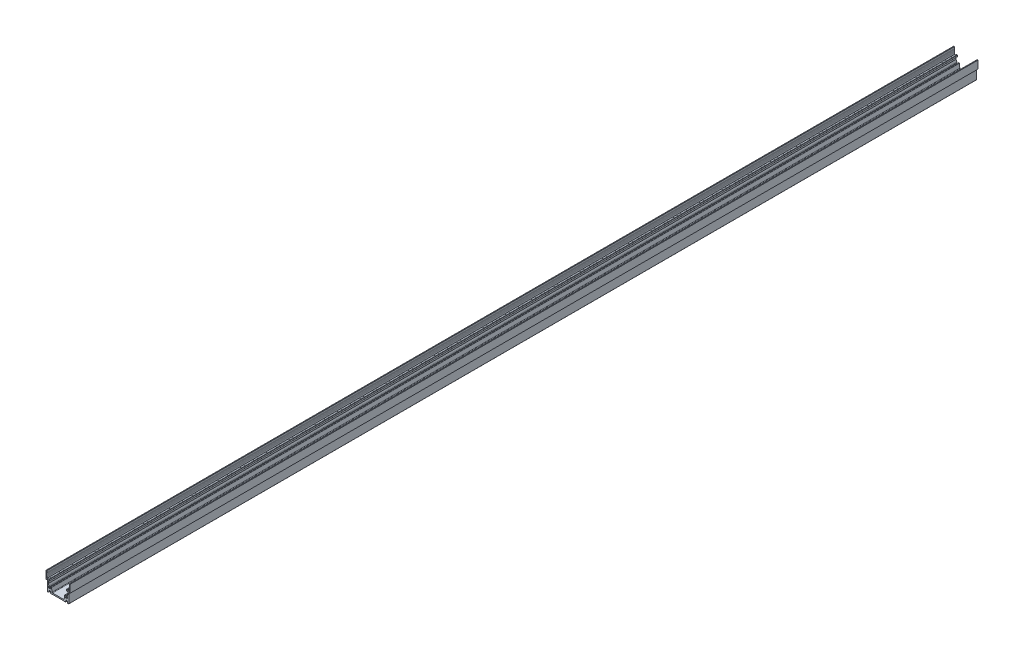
ISO-10303-21;
HEADER;
FILE_DESCRIPTION(('STEP AP214'),'2;1');
FILE_NAME('part.step','',(''),(''),'','','');
FILE_SCHEMA(('AUTOMOTIVE_DESIGN { 1 0 10303 214 1 1 1 1 }'));
ENDSEC;
DATA;
#1=APPLICATION_CONTEXT('core data for automotive mechanical design processes');
#2=APPLICATION_PROTOCOL_DEFINITION('international standard','automotive_design',2000,#1);
#3=PRODUCT_CONTEXT('',#1,'mechanical');
#4=PRODUCT('Part','Part','',(#3));
#5=PRODUCT_RELATED_PRODUCT_CATEGORY('part','',(#4));
#6=PRODUCT_DEFINITION_FORMATION('','',#4);
#7=PRODUCT_DEFINITION_CONTEXT('part definition',#1,'design');
#8=PRODUCT_DEFINITION('design','',#6,#7);
#9=PRODUCT_DEFINITION_SHAPE('','',#8);
#10=(LENGTH_UNIT() NAMED_UNIT(*) SI_UNIT(.MILLI.,.METRE.));
#11=(NAMED_UNIT(*) PLANE_ANGLE_UNIT() SI_UNIT($,.RADIAN.));
#12=(NAMED_UNIT(*) SI_UNIT($,.STERADIAN.) SOLID_ANGLE_UNIT());
#13=UNCERTAINTY_MEASURE_WITH_UNIT(LENGTH_MEASURE(1.E-05),#10,'distance_accuracy_value','');
#14=(GEOMETRIC_REPRESENTATION_CONTEXT(3) GLOBAL_UNCERTAINTY_ASSIGNED_CONTEXT((#13)) GLOBAL_UNIT_ASSIGNED_CONTEXT((#10,
#11,#12)) REPRESENTATION_CONTEXT('',''));
#15=CARTESIAN_POINT('',(0.,0.,0.));
#16=DIRECTION('',(0.,0.,1.));
#17=DIRECTION('',(1.,0.,0.));
#18=AXIS2_PLACEMENT_3D('',#15,#16,#17);
#19=CARTESIAN_POINT('',(-18.,26.302,270.));
#20=DIRECTION('',(1.,0.,0.));
#21=DIRECTION('',(0.,0.,-1.));
#22=AXIS2_PLACEMENT_3D('',#19,#20,#21);
#23=PLANE('',#22);
#24=DIRECTION('',(0.,-1.,0.));
#25=VECTOR('',#24,1.);
#26=CARTESIAN_POINT('',(-18.,26.302,0.));
#27=LINE('',#26,#25);
#28=CARTESIAN_POINT('',(-18.,26.302,0.));
#29=VERTEX_POINT('',#28);
#30=CARTESIAN_POINT('',(-18.,14.6986296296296,0.));
#31=VERTEX_POINT('',#30);
#32=EDGE_CURVE('E688',#29,#31,#27,.T.);
#33=ORIENTED_EDGE('',*,*,#32,.T.);
#34=DIRECTION('',(0.,0.,-1.));
#35=VECTOR('',#34,1.);
#36=CARTESIAN_POINT('',(-18.,14.6986296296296,270.));
#37=LINE('',#36,#35);
#38=CARTESIAN_POINT('',(-18.,14.6986296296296,1350.));
#39=VERTEX_POINT('',#38);
#40=EDGE_CURVE('E9',#39,#31,#37,.T.);
#41=ORIENTED_EDGE('',*,*,#40,.F.);
#42=DIRECTION('',(0.,1.,0.));
#43=VECTOR('',#42,1.);
#44=CARTESIAN_POINT('',(-18.,14.6986296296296,1350.));
#45=LINE('',#44,#43);
#46=CARTESIAN_POINT('',(-18.,26.302,1350.));
#47=VERTEX_POINT('',#46);
#48=EDGE_CURVE('E686',#39,#47,#45,.T.);
#49=ORIENTED_EDGE('',*,*,#48,.T.);
#50=DIRECTION('',(0.,0.,-1.));
#51=VECTOR('',#50,1.);
#52=CARTESIAN_POINT('',(-18.,26.302,270.));
#53=LINE('',#52,#51);
#54=EDGE_CURVE('E1281',#47,#29,#53,.T.);
#55=ORIENTED_EDGE('',*,*,#54,.T.);
#56=EDGE_LOOP('',(#33,#41,#49,#55));
#57=FACE_BOUND('',#56,.T.);
#58=ADVANCED_FACE('F14',(#57),#23,.F.);
#59=CARTESIAN_POINT('',(-18.,14.6986296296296,270.));
#60=DIRECTION('',(-0.287144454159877,0.957887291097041,0.));
#61=DIRECTION('',(-0.957887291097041,-0.287144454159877,0.));
#62=AXIS2_PLACEMENT_3D('',#59,#60,#61);
#63=PLANE('',#62);
#64=DIRECTION('',(0.957887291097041,0.287144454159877,0.));
#65=VECTOR('',#64,1.);
#66=CARTESIAN_POINT('',(-18.,14.6986296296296,0.));
#67=LINE('',#66,#65);
#68=CARTESIAN_POINT('',(-17.008,14.996,0.));
#69=VERTEX_POINT('',#68);
#70=EDGE_CURVE('E1025',#31,#69,#67,.T.);
#71=ORIENTED_EDGE('',*,*,#70,.T.);
#72=DIRECTION('',(0.,0.,-1.));
#73=VECTOR('',#72,1.);
#74=CARTESIAN_POINT('',(-17.008,14.996,270.));
#75=LINE('',#74,#73);
#76=CARTESIAN_POINT('',(-17.008,14.996,1350.));
#77=VERTEX_POINT('',#76);
#78=EDGE_CURVE('E21',#77,#69,#75,.T.);
#79=ORIENTED_EDGE('',*,*,#78,.F.);
#80=DIRECTION('',(-0.957887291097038,-0.287144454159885,0.));
#81=VECTOR('',#80,1.);
#82=CARTESIAN_POINT('',(-17.008,14.996,1350.));
#83=LINE('',#82,#81);
#84=EDGE_CURVE('E696',#77,#39,#83,.T.);
#85=ORIENTED_EDGE('',*,*,#84,.T.);
#86=ORIENTED_EDGE('',*,*,#40,.T.);
#87=EDGE_LOOP('',(#71,#79,#85,#86));
#88=FACE_BOUND('',#87,.T.);
#89=ADVANCED_FACE('F702',(#88),#63,.F.);
#90=CARTESIAN_POINT('',(-17.008,14.996,270.));
#91=DIRECTION('',(0.,1.,0.));
#92=DIRECTION('',(0.,0.,1.));
#93=AXIS2_PLACEMENT_3D('',#90,#91,#92);
#94=PLANE('',#93);
#95=DIRECTION('',(1.,0.,0.));
#96=VECTOR('',#95,1.);
#97=CARTESIAN_POINT('',(-17.008,14.996,0.));
#98=LINE('',#97,#96);
#99=CARTESIAN_POINT('',(-16.,14.996,0.));
#100=VERTEX_POINT('',#99);
#101=EDGE_CURVE('E1027',#69,#100,#98,.T.);
#102=ORIENTED_EDGE('',*,*,#101,.T.);
#103=DIRECTION('',(0.,0.,-1.));
#104=VECTOR('',#103,1.);
#105=CARTESIAN_POINT('',(-16.,14.996,270.));
#106=LINE('',#105,#104);
#107=CARTESIAN_POINT('',(-16.,14.996,1350.));
#108=VERTEX_POINT('',#107);
#109=EDGE_CURVE('E1554',#108,#100,#106,.T.);
#110=ORIENTED_EDGE('',*,*,#109,.F.);
#111=DIRECTION('',(-1.,0.,0.));
#112=VECTOR('',#111,1.);
#113=CARTESIAN_POINT('',(-16.,14.996,1350.));
#114=LINE('',#113,#112);
#115=EDGE_CURVE('E1022',#108,#77,#114,.T.);
#116=ORIENTED_EDGE('',*,*,#115,.T.);
#117=ORIENTED_EDGE('',*,*,#78,.T.);
#118=EDGE_LOOP('',(#102,#110,#116,#117));
#119=FACE_BOUND('',#118,.T.);
#120=ADVANCED_FACE('F1558',(#119),#94,.F.);
#121=CARTESIAN_POINT('',(-16.,14.996,270.));
#122=DIRECTION('',(1.,0.,0.));
#123=DIRECTION('',(0.,0.,-1.));
#124=AXIS2_PLACEMENT_3D('',#121,#122,#123);
#125=PLANE('',#124);
#126=DIRECTION('',(0.,-1.,0.));
#127=VECTOR('',#126,1.);
#128=CARTESIAN_POINT('',(-16.,14.996,0.));
#129=LINE('',#128,#127);
#130=CARTESIAN_POINT('',(-16.,0.0999999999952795,0.));
#131=VERTEX_POINT('',#130);
#132=EDGE_CURVE('E1029',#100,#131,#129,.T.);
#133=ORIENTED_EDGE('',*,*,#132,.T.);
#134=DIRECTION('',(0.,0.,-1.));
#135=VECTOR('',#134,1.);
#136=CARTESIAN_POINT('',(-16.,0.0999999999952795,270.));
#137=LINE('',#136,#135);
#138=CARTESIAN_POINT('',(-16.,0.0999999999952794,1350.));
#139=VERTEX_POINT('',#138);
#140=EDGE_CURVE('E1551',#139,#131,#137,.T.);
#141=ORIENTED_EDGE('',*,*,#140,.F.);
#142=DIRECTION('',(0.,1.,0.));
#143=VECTOR('',#142,1.);
#144=CARTESIAN_POINT('',(-16.,0.0999999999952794,1350.));
#145=LINE('',#144,#143);
#146=EDGE_CURVE('E1019',#139,#108,#145,.T.);
#147=ORIENTED_EDGE('',*,*,#146,.T.);
#148=ORIENTED_EDGE('',*,*,#109,.T.);
#149=EDGE_LOOP('',(#133,#141,#147,#148));
#150=FACE_BOUND('',#149,.T.);
#151=ADVANCED_FACE('F1565',(#150),#125,.F.);
#152=CARTESIAN_POINT('',(-15.702,0.0999999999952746,270.));
#153=DIRECTION('',(0.,0.,-1.));
#154=DIRECTION('',(-1.,0.,0.));
#155=AXIS2_PLACEMENT_3D('',#152,#153,#154);
#156=CYLINDRICAL_SURFACE('',#155,0.298);
#157=CARTESIAN_POINT('',(-15.702,0.0999999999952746,0.));
#158=DIRECTION('',(0.,0.,1.));
#159=DIRECTION('',(1.,0.,0.));
#160=AXIS2_PLACEMENT_3D('',#157,#158,#159);
#161=CIRCLE('',#160,0.298);
#162=CARTESIAN_POINT('',(-15.7020016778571,-0.198,0.));
#163=VERTEX_POINT('',#162);
#164=EDGE_CURVE('E1031',#131,#163,#161,.T.);
#165=ORIENTED_EDGE('',*,*,#164,.T.);
#166=DIRECTION('',(0.,0.,-1.));
#167=VECTOR('',#166,1.);
#168=CARTESIAN_POINT('',(-15.7020016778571,-0.198,270.));
#169=LINE('',#168,#167);
#170=CARTESIAN_POINT('',(-15.7020016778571,-0.198,1350.));
#171=VERTEX_POINT('',#170);
#172=EDGE_CURVE('E1548',#171,#163,#169,.T.);
#173=ORIENTED_EDGE('',*,*,#172,.F.);
#174=CARTESIAN_POINT('',(-15.702,0.0999999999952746,1350.));
#175=DIRECTION('',(0.,0.,-1.));
#176=DIRECTION('',(-1.,0.,0.));
#177=AXIS2_PLACEMENT_3D('',#174,#175,#176);
#178=CIRCLE('',#177,0.298);
#179=EDGE_CURVE('E1016',#171,#139,#178,.T.);
#180=ORIENTED_EDGE('',*,*,#179,.T.);
#181=ORIENTED_EDGE('',*,*,#140,.T.);
#182=EDGE_LOOP('',(#165,#173,#180,#181));
#183=FACE_BOUND('',#182,.T.);
#184=ADVANCED_FACE('F1568',(#183),#156,.T.);
#185=CARTESIAN_POINT('',(-15.7020016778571,-0.198,270.));
#186=DIRECTION('',(0.,1.,0.));
#187=DIRECTION('',(0.,0.,1.));
#188=AXIS2_PLACEMENT_3D('',#185,#186,#187);
#189=PLANE('',#188);
#190=DIRECTION('',(1.,0.,0.));
#191=VECTOR('',#190,1.);
#192=CARTESIAN_POINT('',(-15.7020016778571,-0.198,0.));
#193=LINE('',#192,#191);
#194=CARTESIAN_POINT('',(-14.2773032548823,-0.198,0.));
#195=VERTEX_POINT('',#194);
#196=EDGE_CURVE('E1033',#163,#195,#193,.T.);
#197=ORIENTED_EDGE('',*,*,#196,.T.);
#198=DIRECTION('',(0.,0.,-1.));
#199=VECTOR('',#198,1.);
#200=CARTESIAN_POINT('',(-14.2773032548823,-0.198,270.));
#201=LINE('',#200,#199);
#202=CARTESIAN_POINT('',(-14.2773032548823,-0.197999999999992,1350.));
#203=VERTEX_POINT('',#202);
#204=EDGE_CURVE('E1545',#203,#195,#201,.T.);
#205=ORIENTED_EDGE('',*,*,#204,.F.);
#206=DIRECTION('',(-1.,0.,0.));
#207=VECTOR('',#206,1.);
#208=CARTESIAN_POINT('',(-14.2773032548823,-0.197999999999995,1350.));
#209=LINE('',#208,#207);
#210=EDGE_CURVE('E1013',#203,#171,#209,.T.);
#211=ORIENTED_EDGE('',*,*,#210,.T.);
#212=ORIENTED_EDGE('',*,*,#172,.T.);
#213=EDGE_LOOP('',(#197,#205,#211,#212));
#214=FACE_BOUND('',#213,.T.);
#215=ADVANCED_FACE('F1573',(#214),#189,.F.);
#216=CARTESIAN_POINT('',(-14.2773038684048,0.0999999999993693,270.));
#217=DIRECTION('',(0.,0.,-1.));
#218=DIRECTION('',(-1.,0.,0.));
#219=AXIS2_PLACEMENT_3D('',#216,#217,#218);
#220=CYLINDRICAL_SURFACE('',#219,0.298);
#221=CARTESIAN_POINT('',(-14.2773038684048,0.0999999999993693,0.));
#222=DIRECTION('',(0.,0.,1.));
#223=DIRECTION('',(1.,0.,0.));
#224=AXIS2_PLACEMENT_3D('',#221,#222,#223);
#225=CIRCLE('',#224,0.298);
#226=CARTESIAN_POINT('',(-13.9819190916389,0.0606066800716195,0.));
#227=VERTEX_POINT('',#226);
#228=EDGE_CURVE('E1035',#195,#227,#225,.T.);
#229=ORIENTED_EDGE('',*,*,#228,.T.);
#230=DIRECTION('',(0.,0.,-1.));
#231=VECTOR('',#230,1.);
#232=CARTESIAN_POINT('',(-13.9819190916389,0.0606066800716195,270.));
#233=LINE('',#232,#231);
#234=CARTESIAN_POINT('',(-13.9819190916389,0.0606066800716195,1350.));
#235=VERTEX_POINT('',#234);
#236=EDGE_CURVE('E1542',#235,#227,#233,.T.);
#237=ORIENTED_EDGE('',*,*,#236,.F.);
#238=CARTESIAN_POINT('',(-14.2773038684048,0.0999999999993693,1350.));
#239=DIRECTION('',(0.,0.,-1.));
#240=DIRECTION('',(-1.,0.,0.));
#241=AXIS2_PLACEMENT_3D('',#238,#239,#240);
#242=CIRCLE('',#241,0.297999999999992);
#243=EDGE_CURVE('E1010',#235,#203,#242,.T.);
#244=ORIENTED_EDGE('',*,*,#243,.T.);
#245=ORIENTED_EDGE('',*,*,#204,.T.);
#246=EDGE_LOOP('',(#229,#237,#244,#245));
#247=FACE_BOUND('',#246,.T.);
#248=ADVANCED_FACE('F1576',(#247),#220,.T.);
#249=CARTESIAN_POINT('',(-13.9819190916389,0.0606066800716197,270.));
#250=DIRECTION('',(-0.991224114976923,0.132192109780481,0.));
#251=DIRECTION('',(-0.132192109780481,-0.991224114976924,0.));
#252=AXIS2_PLACEMENT_3D('',#249,#250,#251);
#253=PLANE('',#252);
#254=DIRECTION('',(0.132192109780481,0.991224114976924,0.));
#255=VECTOR('',#254,1.);
#256=CARTESIAN_POINT('',(-13.9819190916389,0.0606066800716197,0.));
#257=LINE('',#256,#255);
#258=CARTESIAN_POINT('',(-13.6770576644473,2.34656761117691,0.));
#259=VERTEX_POINT('',#258);
#260=EDGE_CURVE('E1037',#227,#259,#257,.T.);
#261=ORIENTED_EDGE('',*,*,#260,.T.);
#262=DIRECTION('',(0.,0.,-1.));
#263=VECTOR('',#262,1.);
#264=CARTESIAN_POINT('',(-13.6770576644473,2.34656761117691,270.));
#265=LINE('',#264,#263);
#266=CARTESIAN_POINT('',(-13.6770576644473,2.34656761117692,1350.));
#267=VERTEX_POINT('',#266);
#268=EDGE_CURVE('E1540',#267,#259,#265,.T.);
#269=ORIENTED_EDGE('',*,*,#268,.F.);
#270=DIRECTION('',(-0.132192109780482,-0.991224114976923,0.));
#271=VECTOR('',#270,1.);
#272=CARTESIAN_POINT('',(-13.6770576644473,2.34656761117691,1350.));
#273=LINE('',#272,#271);
#274=EDGE_CURVE('E1007',#267,#235,#273,.T.);
#275=ORIENTED_EDGE('',*,*,#274,.T.);
#276=ORIENTED_EDGE('',*,*,#236,.T.);
#277=EDGE_LOOP('',(#261,#269,#275,#276));
#278=FACE_BOUND('',#277,.T.);
#279=ADVANCED_FACE('F1581',(#278),#253,.F.);
#280=CARTESIAN_POINT('',(-13.1854105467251,2.281,270.));
#281=DIRECTION('',(0.,0.,-1.));
#282=DIRECTION('',(-1.,0.,0.));
#283=AXIS2_PLACEMENT_3D('',#280,#281,#282);
#284=CYLINDRICAL_SURFACE('',#283,0.496);
#285=CARTESIAN_POINT('',(-13.1854105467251,2.281,0.));
#286=DIRECTION('',(0.,0.,1.));
#287=DIRECTION('',(1.,0.,0.));
#288=AXIS2_PLACEMENT_3D('',#285,#286,#287);
#289=CIRCLE('',#288,0.496);
#290=CARTESIAN_POINT('',(-13.1854106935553,2.777,0.));
#291=VERTEX_POINT('',#290);
#292=EDGE_CURVE('E1040',#291,#259,#289,.T.);
#293=ORIENTED_EDGE('',*,*,#292,.F.);
#294=DIRECTION('',(0.,0.,-1.));
#295=VECTOR('',#294,1.);
#296=CARTESIAN_POINT('',(-13.1854106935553,2.777,270.));
#297=LINE('',#296,#295);
#298=CARTESIAN_POINT('',(-13.1854106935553,2.777,1350.));
#299=VERTEX_POINT('',#298);
#300=EDGE_CURVE('E1538',#299,#291,#297,.T.);
#301=ORIENTED_EDGE('',*,*,#300,.F.);
#302=CARTESIAN_POINT('',(-13.1854105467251,2.281,1350.));
#303=DIRECTION('',(0.,0.,1.));
#304=DIRECTION('',(-1.,0.,0.));
#305=AXIS2_PLACEMENT_3D('',#302,#303,#304);
#306=CIRCLE('',#305,0.496000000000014);
#307=EDGE_CURVE('E1004',#299,#267,#306,.T.);
#308=ORIENTED_EDGE('',*,*,#307,.T.);
#309=ORIENTED_EDGE('',*,*,#268,.T.);
#310=EDGE_LOOP('',(#293,#301,#308,#309));
#311=FACE_BOUND('',#310,.T.);
#312=ADVANCED_FACE('F1586',(#311),#284,.F.);
#313=CARTESIAN_POINT('',(-13.1854106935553,2.777,270.));
#314=DIRECTION('',(0.,1.,0.));
#315=DIRECTION('',(0.,0.,1.));
#316=AXIS2_PLACEMENT_3D('',#313,#314,#315);
#317=PLANE('',#316);
#318=DIRECTION('',(1.,0.,0.));
#319=VECTOR('',#318,1.);
#320=CARTESIAN_POINT('',(-13.1854106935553,2.777,0.));
#321=LINE('',#320,#319);
#322=CARTESIAN_POINT('',(-12.0205892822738,2.777,0.));
#323=VERTEX_POINT('',#322);
#324=EDGE_CURVE('E1043',#291,#323,#321,.T.);
#325=ORIENTED_EDGE('',*,*,#324,.T.);
#326=DIRECTION('',(0.,0.,-1.));
#327=VECTOR('',#326,1.);
#328=CARTESIAN_POINT('',(-12.0205892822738,2.777,270.));
#329=LINE('',#328,#327);
#330=CARTESIAN_POINT('',(-12.0205892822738,2.777,1350.));
#331=VERTEX_POINT('',#330);
#332=EDGE_CURVE('E1536',#331,#323,#329,.T.);
#333=ORIENTED_EDGE('',*,*,#332,.F.);
#334=DIRECTION('',(-1.,0.,0.));
#335=VECTOR('',#334,1.);
#336=CARTESIAN_POINT('',(-12.0205892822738,2.777,1350.));
#337=LINE('',#336,#335);
#338=EDGE_CURVE('E1001',#331,#299,#337,.T.);
#339=ORIENTED_EDGE('',*,*,#338,.T.);
#340=ORIENTED_EDGE('',*,*,#300,.T.);
#341=EDGE_LOOP('',(#325,#333,#339,#340));
#342=FACE_BOUND('',#341,.T.);
#343=ADVANCED_FACE('F1588',(#342),#317,.F.);
#344=CARTESIAN_POINT('',(-12.0205895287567,2.28100000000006,270.));
#345=DIRECTION('',(0.,0.,-1.));
#346=DIRECTION('',(-1.,0.,0.));
#347=AXIS2_PLACEMENT_3D('',#344,#345,#346);
#348=CYLINDRICAL_SURFACE('',#347,0.496);
#349=CARTESIAN_POINT('',(-12.0205895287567,2.28100000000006,0.));
#350=DIRECTION('',(0.,0.,1.));
#351=DIRECTION('',(1.,0.,0.));
#352=AXIS2_PLACEMENT_3D('',#349,#350,#351);
#353=CIRCLE('',#352,0.496);
#354=CARTESIAN_POINT('',(-11.5289320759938,2.34649006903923,0.));
#355=VERTEX_POINT('',#354);
#356=EDGE_CURVE('E1046',#355,#323,#353,.T.);
#357=ORIENTED_EDGE('',*,*,#356,.F.);
#358=DIRECTION('',(0.,0.,-1.));
#359=VECTOR('',#358,1.);
#360=CARTESIAN_POINT('',(-11.5289320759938,2.34649006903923,270.));
#361=LINE('',#360,#359);
#362=CARTESIAN_POINT('',(-11.5289320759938,2.34649006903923,1350.));
#363=VERTEX_POINT('',#362);
#364=EDGE_CURVE('E1534',#363,#355,#361,.T.);
#365=ORIENTED_EDGE('',*,*,#364,.F.);
#366=CARTESIAN_POINT('',(-12.0205895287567,2.28100000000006,1350.));
#367=DIRECTION('',(0.,0.,1.));
#368=DIRECTION('',(-1.,0.,0.));
#369=AXIS2_PLACEMENT_3D('',#366,#367,#368);
#370=CIRCLE('',#369,0.496);
#371=EDGE_CURVE('E998',#363,#331,#370,.T.);
#372=ORIENTED_EDGE('',*,*,#371,.T.);
#373=ORIENTED_EDGE('',*,*,#332,.T.);
#374=EDGE_LOOP('',(#357,#365,#372,#373));
#375=FACE_BOUND('',#374,.T.);
#376=ADVANCED_FACE('F1593',(#375),#348,.F.);
#377=CARTESIAN_POINT('',(-11.5289320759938,2.34649006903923,270.));
#378=DIRECTION('',(0.991244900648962,0.132036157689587,0.));
#379=DIRECTION('',(-0.132036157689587,0.991244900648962,0.));
#380=AXIS2_PLACEMENT_3D('',#377,#378,#379);
#381=PLANE('',#380);
#382=DIRECTION('',(0.132036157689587,-0.991244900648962,0.));
#383=VECTOR('',#382,1.);
#384=CARTESIAN_POINT('',(-11.5289320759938,2.34649006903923,0.));
#385=LINE('',#384,#383);
#386=CARTESIAN_POINT('',(-11.19,-0.198,0.));
#387=VERTEX_POINT('',#386);
#388=EDGE_CURVE('E1049',#355,#387,#385,.T.);
#389=ORIENTED_EDGE('',*,*,#388,.T.);
#390=DIRECTION('',(0.,0.,-1.));
#391=VECTOR('',#390,1.);
#392=CARTESIAN_POINT('',(-11.19,-0.198,270.));
#393=LINE('',#392,#391);
#394=CARTESIAN_POINT('',(-11.19,-0.198,1350.));
#395=VERTEX_POINT('',#394);
#396=EDGE_CURVE('E1531',#395,#387,#393,.T.);
#397=ORIENTED_EDGE('',*,*,#396,.F.);
#398=DIRECTION('',(-0.13203615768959,0.991244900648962,0.));
#399=VECTOR('',#398,1.);
#400=CARTESIAN_POINT('',(-11.19,-0.198,1350.));
#401=LINE('',#400,#399);
#402=EDGE_CURVE('E995',#395,#363,#401,.T.);
#403=ORIENTED_EDGE('',*,*,#402,.T.);
#404=ORIENTED_EDGE('',*,*,#364,.T.);
#405=EDGE_LOOP('',(#389,#397,#403,#404));
#406=FACE_BOUND('',#405,.T.);
#407=ADVANCED_FACE('F1598',(#406),#381,.F.);
#408=CARTESIAN_POINT('',(-11.19,-0.198,270.));
#409=DIRECTION('',(0.,1.,0.));
#410=DIRECTION('',(-1.,0.,0.));
#411=AXIS2_PLACEMENT_3D('',#408,#409,#410);
#412=PLANE('',#411);
#413=DIRECTION('',(1.,0.,0.));
#414=VECTOR('',#413,1.);
#415=CARTESIAN_POINT('',(-11.19,-0.198,0.));
#416=LINE('',#415,#414);
#417=CARTESIAN_POINT('',(-7.663,-0.198,0.));
#418=VERTEX_POINT('',#417);
#419=EDGE_CURVE('E1051',#387,#418,#416,.T.);
#420=ORIENTED_EDGE('',*,*,#419,.T.);
#421=DIRECTION('',(0.,0.,-1.));
#422=VECTOR('',#421,1.);
#423=CARTESIAN_POINT('',(-7.663,-0.198,270.));
#424=LINE('',#423,#422);
#425=CARTESIAN_POINT('',(-7.663,-0.198,1350.));
#426=VERTEX_POINT('',#425);
#427=EDGE_CURVE('E1529',#426,#418,#424,.T.);
#428=ORIENTED_EDGE('',*,*,#427,.F.);
#429=DIRECTION('',(-1.,0.,0.));
#430=VECTOR('',#429,1.);
#431=CARTESIAN_POINT('',(-7.663,-0.198,1350.));
#432=LINE('',#431,#430);
#433=EDGE_CURVE('E992',#426,#395,#432,.T.);
#434=ORIENTED_EDGE('',*,*,#433,.T.);
#435=ORIENTED_EDGE('',*,*,#396,.T.);
#436=EDGE_LOOP('',(#420,#428,#434,#435));
#437=FACE_BOUND('',#436,.T.);
#438=ADVANCED_FACE('F1600',(#437),#412,.F.);
#439=CARTESIAN_POINT('',(-7.14898437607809,-0.752368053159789,270.));
#440=DIRECTION('',(0.,0.,-1.));
#441=DIRECTION('',(-1.,0.,0.));
#442=AXIS2_PLACEMENT_3D('',#439,#440,#441);
#443=CYLINDRICAL_SURFACE('',#442,0.756);
#444=CARTESIAN_POINT('',(-7.14898437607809,-0.752368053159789,0.));
#445=DIRECTION('',(0.,0.,1.));
#446=DIRECTION('',(1.,0.,0.));
#447=AXIS2_PLACEMENT_3D('',#444,#445,#446);
#448=CIRCLE('',#447,0.756);
#449=CARTESIAN_POINT('',(-7.223,0.,0.));
#450=VERTEX_POINT('',#449);
#451=EDGE_CURVE('E1054',#450,#418,#448,.T.);
#452=ORIENTED_EDGE('',*,*,#451,.F.);
#453=DIRECTION('',(0.,0.,-1.));
#454=VECTOR('',#453,1.);
#455=CARTESIAN_POINT('',(-7.223,0.,270.));
#456=LINE('',#455,#454);
#457=CARTESIAN_POINT('',(-7.223,0.,1350.));
#458=VERTEX_POINT('',#457);
#459=EDGE_CURVE('E1527',#458,#450,#456,.T.);
#460=ORIENTED_EDGE('',*,*,#459,.F.);
#461=CARTESIAN_POINT('',(-7.14898437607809,-0.752368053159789,1350.));
#462=DIRECTION('',(0.,0.,1.));
#463=DIRECTION('',(-1.,0.,0.));
#464=AXIS2_PLACEMENT_3D('',#461,#462,#463);
#465=CIRCLE('',#464,0.756);
#466=EDGE_CURVE('E989',#458,#426,#465,.T.);
#467=ORIENTED_EDGE('',*,*,#466,.T.);
#468=ORIENTED_EDGE('',*,*,#427,.T.);
#469=EDGE_LOOP('',(#452,#460,#467,#468));
#470=FACE_BOUND('',#469,.T.);
#471=ADVANCED_FACE('F1604',(#470),#443,.F.);
#472=CARTESIAN_POINT('',(-7.223,0.,270.));
#473=DIRECTION('',(0.,1.,0.));
#474=DIRECTION('',(0.,0.,1.));
#475=AXIS2_PLACEMENT_3D('',#472,#473,#474);
#476=PLANE('',#475);
#477=DIRECTION('',(1.,0.,0.));
#478=VECTOR('',#477,1.);
#479=CARTESIAN_POINT('',(-7.223,0.,0.));
#480=LINE('',#479,#478);
#481=CARTESIAN_POINT('',(7.223,0.,0.));
#482=VERTEX_POINT('',#481);
#483=EDGE_CURVE('E1057',#450,#482,#480,.T.);
#484=ORIENTED_EDGE('',*,*,#483,.T.);
#485=DIRECTION('',(0.,0.,-1.));
#486=VECTOR('',#485,1.);
#487=CARTESIAN_POINT('',(7.223,0.,270.));
#488=LINE('',#487,#486);
#489=CARTESIAN_POINT('',(7.223,0.,1350.));
#490=VERTEX_POINT('',#489);
#491=EDGE_CURVE('E1525',#490,#482,#488,.T.);
#492=ORIENTED_EDGE('',*,*,#491,.F.);
#493=DIRECTION('',(-1.,0.,0.));
#494=VECTOR('',#493,1.);
#495=CARTESIAN_POINT('',(7.223,0.,1350.));
#496=LINE('',#495,#494);
#497=EDGE_CURVE('E986',#490,#458,#496,.T.);
#498=ORIENTED_EDGE('',*,*,#497,.T.);
#499=ORIENTED_EDGE('',*,*,#459,.T.);
#500=EDGE_LOOP('',(#484,#492,#498,#499));
#501=FACE_BOUND('',#500,.T.);
#502=ADVANCED_FACE('F1609',(#501),#476,.F.);
#503=CARTESIAN_POINT('',(7.14898437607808,-0.752368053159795,270.));
#504=DIRECTION('',(0.,0.,-1.));
#505=DIRECTION('',(-1.,0.,0.));
#506=AXIS2_PLACEMENT_3D('',#503,#504,#505);
#507=CYLINDRICAL_SURFACE('',#506,0.756);
#508=CARTESIAN_POINT('',(7.14898437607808,-0.752368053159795,0.));
#509=DIRECTION('',(0.,0.,1.));
#510=DIRECTION('',(1.,0.,0.));
#511=AXIS2_PLACEMENT_3D('',#508,#509,#510);
#512=CIRCLE('',#511,0.756);
#513=CARTESIAN_POINT('',(7.663,-0.198,0.));
#514=VERTEX_POINT('',#513);
#515=EDGE_CURVE('E1060',#514,#482,#512,.T.);
#516=ORIENTED_EDGE('',*,*,#515,.F.);
#517=DIRECTION('',(0.,0.,-1.));
#518=VECTOR('',#517,1.);
#519=CARTESIAN_POINT('',(7.663,-0.198,270.));
#520=LINE('',#519,#518);
#521=CARTESIAN_POINT('',(7.663,-0.198,1350.));
#522=VERTEX_POINT('',#521);
#523=EDGE_CURVE('E1523',#522,#514,#520,.T.);
#524=ORIENTED_EDGE('',*,*,#523,.F.);
#525=CARTESIAN_POINT('',(7.14898437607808,-0.752368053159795,1350.));
#526=DIRECTION('',(0.,0.,1.));
#527=DIRECTION('',(-1.,0.,0.));
#528=AXIS2_PLACEMENT_3D('',#525,#526,#527);
#529=CIRCLE('',#528,0.756000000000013);
#530=EDGE_CURVE('E983',#522,#490,#529,.T.);
#531=ORIENTED_EDGE('',*,*,#530,.T.);
#532=ORIENTED_EDGE('',*,*,#491,.T.);
#533=EDGE_LOOP('',(#516,#524,#531,#532));
#534=FACE_BOUND('',#533,.T.);
#535=ADVANCED_FACE('F1612',(#534),#507,.F.);
#536=CARTESIAN_POINT('',(7.663,-0.198,270.));
#537=DIRECTION('',(0.,1.,0.));
#538=DIRECTION('',(-1.,0.,0.));
#539=AXIS2_PLACEMENT_3D('',#536,#537,#538);
#540=PLANE('',#539);
#541=DIRECTION('',(1.,0.,0.));
#542=VECTOR('',#541,1.);
#543=CARTESIAN_POINT('',(7.663,-0.198,0.));
#544=LINE('',#543,#542);
#545=CARTESIAN_POINT('',(10.93,-0.198,0.));
#546=VERTEX_POINT('',#545);
#547=EDGE_CURVE('E1063',#514,#546,#544,.T.);
#548=ORIENTED_EDGE('',*,*,#547,.T.);
#549=DIRECTION('',(0.,0.,-1.));
#550=VECTOR('',#549,1.);
#551=CARTESIAN_POINT('',(10.93,-0.198,270.));
#552=LINE('',#551,#550);
#553=CARTESIAN_POINT('',(10.93,-0.197999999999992,1350.));
#554=VERTEX_POINT('',#553);
#555=EDGE_CURVE('E1520',#554,#546,#552,.T.);
#556=ORIENTED_EDGE('',*,*,#555,.F.);
#557=DIRECTION('',(-1.,0.,0.));
#558=VECTOR('',#557,1.);
#559=CARTESIAN_POINT('',(10.93,-0.197999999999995,1350.));
#560=LINE('',#559,#558);
#561=EDGE_CURVE('E980',#554,#522,#560,.T.);
#562=ORIENTED_EDGE('',*,*,#561,.T.);
#563=ORIENTED_EDGE('',*,*,#523,.T.);
#564=EDGE_LOOP('',(#548,#556,#562,#563));
#565=FACE_BOUND('',#564,.T.);
#566=ADVANCED_FACE('F1616',(#565),#540,.F.);
#567=CARTESIAN_POINT('',(10.9286957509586,0.0999971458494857,270.));
#568=DIRECTION('',(0.,0.,-1.));
#569=DIRECTION('',(-1.,0.,0.));
#570=AXIS2_PLACEMENT_3D('',#567,#568,#569);
#571=CYLINDRICAL_SURFACE('',#570,0.298);
#572=CARTESIAN_POINT('',(10.9286957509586,0.0999971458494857,0.));
#573=DIRECTION('',(0.,0.,1.));
#574=DIRECTION('',(1.,0.,0.));
#575=AXIS2_PLACEMENT_3D('',#572,#573,#574);
#576=CIRCLE('',#575,0.298);
#577=CARTESIAN_POINT('',(11.2240805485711,0.0606039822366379,0.));
#578=VERTEX_POINT('',#577);
#579=EDGE_CURVE('E1065',#546,#578,#576,.T.);
#580=ORIENTED_EDGE('',*,*,#579,.T.);
#581=DIRECTION('',(0.,0.,-1.));
#582=VECTOR('',#581,1.);
#583=CARTESIAN_POINT('',(11.2240805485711,0.0606039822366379,270.));
#584=LINE('',#583,#582);
#585=CARTESIAN_POINT('',(11.2240805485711,0.0606039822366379,1350.));
#586=VERTEX_POINT('',#585);
#587=EDGE_CURVE('E1517',#586,#578,#584,.T.);
#588=ORIENTED_EDGE('',*,*,#587,.F.);
#589=CARTESIAN_POINT('',(10.9286957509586,0.0999971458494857,1350.));
#590=DIRECTION('',(0.,0.,-1.));
#591=DIRECTION('',(-1.,0.,0.));
#592=AXIS2_PLACEMENT_3D('',#589,#590,#591);
#593=CIRCLE('',#592,0.297999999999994);
#594=EDGE_CURVE('E977',#586,#554,#593,.T.);
#595=ORIENTED_EDGE('',*,*,#594,.T.);
#596=ORIENTED_EDGE('',*,*,#555,.T.);
#597=EDGE_LOOP('',(#580,#588,#595,#596));
#598=FACE_BOUND('',#597,.T.);
#599=ADVANCED_FACE('F1620',(#598),#571,.T.);
#600=CARTESIAN_POINT('',(11.2240805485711,0.0606039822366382,270.));
#601=DIRECTION('',(-0.991224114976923,0.132192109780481,0.));
#602=DIRECTION('',(-0.132192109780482,-0.991224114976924,0.));
#603=AXIS2_PLACEMENT_3D('',#600,#601,#602);
#604=PLANE('',#603);
#605=DIRECTION('',(0.132192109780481,0.991224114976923,0.));
#606=VECTOR('',#605,1.);
#607=CARTESIAN_POINT('',(11.2240805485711,0.0606039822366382,0.));
#608=LINE('',#607,#606);
#609=CARTESIAN_POINT('',(11.5289423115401,2.3465674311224,0.));
#610=VERTEX_POINT('',#609);
#611=EDGE_CURVE('E1067',#578,#610,#608,.T.);
#612=ORIENTED_EDGE('',*,*,#611,.T.);
#613=DIRECTION('',(0.,0.,-1.));
#614=VECTOR('',#613,1.);
#615=CARTESIAN_POINT('',(11.5289423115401,2.3465674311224,270.));
#616=LINE('',#615,#614);
#617=CARTESIAN_POINT('',(11.5289423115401,2.3465674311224,1350.));
#618=VERTEX_POINT('',#617);
#619=EDGE_CURVE('E1515',#618,#610,#616,.T.);
#620=ORIENTED_EDGE('',*,*,#619,.F.);
#621=DIRECTION('',(-0.132192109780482,-0.991224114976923,0.));
#622=VECTOR('',#621,1.);
#623=CARTESIAN_POINT('',(11.5289423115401,2.3465674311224,1350.));
#624=LINE('',#623,#622);
#625=EDGE_CURVE('E974',#618,#586,#624,.T.);
#626=ORIENTED_EDGE('',*,*,#625,.T.);
#627=ORIENTED_EDGE('',*,*,#587,.T.);
#628=EDGE_LOOP('',(#612,#620,#626,#627));
#629=FACE_BOUND('',#628,.T.);
#630=ADVANCED_FACE('F1625',(#629),#604,.F.);
#631=CARTESIAN_POINT('',(12.020589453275,2.28100000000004,270.));
#632=DIRECTION('',(0.,0.,-1.));
#633=DIRECTION('',(-1.,0.,0.));
#634=AXIS2_PLACEMENT_3D('',#631,#632,#633);
#635=CYLINDRICAL_SURFACE('',#634,0.496);
#636=CARTESIAN_POINT('',(12.020589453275,2.28100000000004,0.));
#637=DIRECTION('',(0.,0.,1.));
#638=DIRECTION('',(1.,0.,0.));
#639=AXIS2_PLACEMENT_3D('',#636,#637,#638);
#640=CIRCLE('',#639,0.496);
#641=CARTESIAN_POINT('',(12.0205892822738,2.777,0.));
#642=VERTEX_POINT('',#641);
#643=EDGE_CURVE('E1070',#642,#610,#640,.T.);
#644=ORIENTED_EDGE('',*,*,#643,.F.);
#645=DIRECTION('',(0.,0.,-1.));
#646=VECTOR('',#645,1.);
#647=CARTESIAN_POINT('',(12.0205892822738,2.777,270.));
#648=LINE('',#647,#646);
#649=CARTESIAN_POINT('',(12.0205892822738,2.777,1350.));
#650=VERTEX_POINT('',#649);
#651=EDGE_CURVE('E1513',#650,#642,#648,.T.);
#652=ORIENTED_EDGE('',*,*,#651,.F.);
#653=CARTESIAN_POINT('',(12.020589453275,2.28100000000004,1350.));
#654=DIRECTION('',(0.,0.,1.));
#655=DIRECTION('',(-1.,0.,0.));
#656=AXIS2_PLACEMENT_3D('',#653,#654,#655);
#657=CIRCLE('',#656,0.496);
#658=EDGE_CURVE('E971',#650,#618,#657,.T.);
#659=ORIENTED_EDGE('',*,*,#658,.T.);
#660=ORIENTED_EDGE('',*,*,#619,.T.);
#661=EDGE_LOOP('',(#644,#652,#659,#660));
#662=FACE_BOUND('',#661,.T.);
#663=ADVANCED_FACE('F1630',(#662),#635,.F.);
#664=CARTESIAN_POINT('',(12.0205892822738,2.777,270.));
#665=DIRECTION('',(0.,1.,0.));
#666=DIRECTION('',(0.,0.,1.));
#667=AXIS2_PLACEMENT_3D('',#664,#665,#666);
#668=PLANE('',#667);
#669=DIRECTION('',(1.,0.,0.));
#670=VECTOR('',#669,1.);
#671=CARTESIAN_POINT('',(12.0205892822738,2.777,0.));
#672=LINE('',#671,#670);
#673=CARTESIAN_POINT('',(13.1854106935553,2.777,0.));
#674=VERTEX_POINT('',#673);
#675=EDGE_CURVE('E1073',#642,#674,#672,.T.);
#676=ORIENTED_EDGE('',*,*,#675,.T.);
#677=DIRECTION('',(0.,0.,-1.));
#678=VECTOR('',#677,1.);
#679=CARTESIAN_POINT('',(13.1854106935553,2.777,270.));
#680=LINE('',#679,#678);
#681=CARTESIAN_POINT('',(13.1854106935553,2.777,1350.));
#682=VERTEX_POINT('',#681);
#683=EDGE_CURVE('E1511',#682,#674,#680,.T.);
#684=ORIENTED_EDGE('',*,*,#683,.F.);
#685=DIRECTION('',(-1.,0.,0.));
#686=VECTOR('',#685,1.);
#687=CARTESIAN_POINT('',(13.1854106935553,2.777,1350.));
#688=LINE('',#687,#686);
#689=EDGE_CURVE('E968',#682,#650,#688,.T.);
#690=ORIENTED_EDGE('',*,*,#689,.T.);
#691=ORIENTED_EDGE('',*,*,#651,.T.);
#692=EDGE_LOOP('',(#676,#684,#690,#691));
#693=FACE_BOUND('',#692,.T.);
#694=ADVANCED_FACE('F1632',(#693),#668,.F.);
#695=CARTESIAN_POINT('',(13.1854105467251,2.281,270.));
#696=DIRECTION('',(0.,0.,-1.));
#697=DIRECTION('',(-1.,0.,0.));
#698=AXIS2_PLACEMENT_3D('',#695,#696,#697);
#699=CYLINDRICAL_SURFACE('',#698,0.496);
#700=CARTESIAN_POINT('',(13.1854105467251,2.281,0.));
#701=DIRECTION('',(0.,0.,1.));
#702=DIRECTION('',(1.,0.,0.));
#703=AXIS2_PLACEMENT_3D('',#700,#701,#702);
#704=CIRCLE('',#703,0.496);
#705=CARTESIAN_POINT('',(13.6770576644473,2.34656761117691,0.));
#706=VERTEX_POINT('',#705);
#707=EDGE_CURVE('E1076',#706,#674,#704,.T.);
#708=ORIENTED_EDGE('',*,*,#707,.F.);
#709=DIRECTION('',(0.,0.,-1.));
#710=VECTOR('',#709,1.);
#711=CARTESIAN_POINT('',(13.6770576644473,2.34656761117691,270.));
#712=LINE('',#711,#710);
#713=CARTESIAN_POINT('',(13.6770576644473,2.34656761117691,1350.));
#714=VERTEX_POINT('',#713);
#715=EDGE_CURVE('E1509',#714,#706,#712,.T.);
#716=ORIENTED_EDGE('',*,*,#715,.F.);
#717=CARTESIAN_POINT('',(13.1854105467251,2.281,1350.));
#718=DIRECTION('',(0.,0.,1.));
#719=DIRECTION('',(-1.,0.,0.));
#720=AXIS2_PLACEMENT_3D('',#717,#718,#719);
#721=CIRCLE('',#720,0.496);
#722=EDGE_CURVE('E965',#714,#682,#721,.T.);
#723=ORIENTED_EDGE('',*,*,#722,.T.);
#724=ORIENTED_EDGE('',*,*,#683,.T.);
#725=EDGE_LOOP('',(#708,#716,#723,#724));
#726=FACE_BOUND('',#725,.T.);
#727=ADVANCED_FACE('F1637',(#726),#699,.F.);
#728=CARTESIAN_POINT('',(13.6770576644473,2.34656761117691,270.));
#729=DIRECTION('',(0.991224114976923,0.132192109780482,0.));
#730=DIRECTION('',(-0.132192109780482,0.991224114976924,0.));
#731=AXIS2_PLACEMENT_3D('',#728,#729,#730);
#732=PLANE('',#731);
#733=DIRECTION('',(0.132192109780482,-0.991224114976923,0.));
#734=VECTOR('',#733,1.);
#735=CARTESIAN_POINT('',(13.6770576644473,2.34656761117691,0.));
#736=LINE('',#735,#734);
#737=CARTESIAN_POINT('',(13.9819190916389,0.0606066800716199,0.));
#738=VERTEX_POINT('',#737);
#739=EDGE_CURVE('E1079',#706,#738,#736,.T.);
#740=ORIENTED_EDGE('',*,*,#739,.T.);
#741=DIRECTION('',(0.,0.,-1.));
#742=VECTOR('',#741,1.);
#743=CARTESIAN_POINT('',(13.9819190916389,0.0606066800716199,270.));
#744=LINE('',#743,#742);
#745=CARTESIAN_POINT('',(13.9819190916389,0.0606066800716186,1350.));
#746=VERTEX_POINT('',#745);
#747=EDGE_CURVE('E1506',#746,#738,#744,.T.);
#748=ORIENTED_EDGE('',*,*,#747,.F.);
#749=DIRECTION('',(-0.132192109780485,0.991224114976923,0.));
#750=VECTOR('',#749,1.);
#751=CARTESIAN_POINT('',(13.9819190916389,0.0606066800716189,1350.));
#752=LINE('',#751,#750);
#753=EDGE_CURVE('E962',#746,#714,#752,.T.);
#754=ORIENTED_EDGE('',*,*,#753,.T.);
#755=ORIENTED_EDGE('',*,*,#715,.T.);
#756=EDGE_LOOP('',(#740,#748,#754,#755));
#757=FACE_BOUND('',#756,.T.);
#758=ADVANCED_FACE('F1642',(#757),#732,.F.);
#759=CARTESIAN_POINT('',(14.2773038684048,0.0999999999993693,270.));
#760=DIRECTION('',(0.,0.,-1.));
#761=DIRECTION('',(-1.,0.,0.));
#762=AXIS2_PLACEMENT_3D('',#759,#760,#761);
#763=CYLINDRICAL_SURFACE('',#762,0.298);
#764=CARTESIAN_POINT('',(14.2773038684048,0.0999999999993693,0.));
#765=DIRECTION('',(0.,0.,1.));
#766=DIRECTION('',(1.,0.,0.));
#767=AXIS2_PLACEMENT_3D('',#764,#765,#766);
#768=CIRCLE('',#767,0.298);
#769=CARTESIAN_POINT('',(14.2773032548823,-0.198,0.));
#770=VERTEX_POINT('',#769);
#771=EDGE_CURVE('E1081',#738,#770,#768,.T.);
#772=ORIENTED_EDGE('',*,*,#771,.T.);
#773=DIRECTION('',(0.,0.,-1.));
#774=VECTOR('',#773,1.);
#775=CARTESIAN_POINT('',(14.2773032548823,-0.198,270.));
#776=LINE('',#775,#774);
#777=CARTESIAN_POINT('',(14.2773032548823,-0.198,1350.));
#778=VERTEX_POINT('',#777);
#779=EDGE_CURVE('E1503',#778,#770,#776,.T.);
#780=ORIENTED_EDGE('',*,*,#779,.F.);
#781=CARTESIAN_POINT('',(14.2773038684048,0.0999999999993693,1350.));
#782=DIRECTION('',(0.,0.,-1.));
#783=DIRECTION('',(-1.,0.,0.));
#784=AXIS2_PLACEMENT_3D('',#781,#782,#783);
#785=CIRCLE('',#784,0.298);
#786=EDGE_CURVE('E959',#778,#746,#785,.T.);
#787=ORIENTED_EDGE('',*,*,#786,.T.);
#788=ORIENTED_EDGE('',*,*,#747,.T.);
#789=EDGE_LOOP('',(#772,#780,#787,#788));
#790=FACE_BOUND('',#789,.T.);
#791=ADVANCED_FACE('F1644',(#790),#763,.T.);
#792=CARTESIAN_POINT('',(14.2773032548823,-0.198,270.));
#793=DIRECTION('',(0.,1.,0.));
#794=DIRECTION('',(0.,0.,1.));
#795=AXIS2_PLACEMENT_3D('',#792,#793,#794);
#796=PLANE('',#795);
#797=DIRECTION('',(1.,0.,0.));
#798=VECTOR('',#797,1.);
#799=CARTESIAN_POINT('',(14.2773032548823,-0.198,0.));
#800=LINE('',#799,#798);
#801=CARTESIAN_POINT('',(15.7020016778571,-0.198,0.));
#802=VERTEX_POINT('',#801);
#803=EDGE_CURVE('E1083',#770,#802,#800,.T.);
#804=ORIENTED_EDGE('',*,*,#803,.T.);
#805=DIRECTION('',(0.,0.,-1.));
#806=VECTOR('',#805,1.);
#807=CARTESIAN_POINT('',(15.7020016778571,-0.198,270.));
#808=LINE('',#807,#806);
#809=CARTESIAN_POINT('',(15.7020016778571,-0.198,1350.));
#810=VERTEX_POINT('',#809);
#811=EDGE_CURVE('E1500',#810,#802,#808,.T.);
#812=ORIENTED_EDGE('',*,*,#811,.F.);
#813=DIRECTION('',(-1.,0.,0.));
#814=VECTOR('',#813,1.);
#815=CARTESIAN_POINT('',(15.7020016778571,-0.198,1350.));
#816=LINE('',#815,#814);
#817=EDGE_CURVE('E956',#810,#778,#816,.T.);
#818=ORIENTED_EDGE('',*,*,#817,.T.);
#819=ORIENTED_EDGE('',*,*,#779,.T.);
#820=EDGE_LOOP('',(#804,#812,#818,#819));
#821=FACE_BOUND('',#820,.T.);
#822=ADVANCED_FACE('F1649',(#821),#796,.F.);
#823=CARTESIAN_POINT('',(15.702,0.0999999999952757,270.));
#824=DIRECTION('',(0.,0.,-1.));
#825=DIRECTION('',(-1.,0.,0.));
#826=AXIS2_PLACEMENT_3D('',#823,#824,#825);
#827=CYLINDRICAL_SURFACE('',#826,0.298);
#828=CARTESIAN_POINT('',(15.702,0.0999999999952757,0.));
#829=DIRECTION('',(0.,0.,1.));
#830=DIRECTION('',(1.,0.,0.));
#831=AXIS2_PLACEMENT_3D('',#828,#829,#830);
#832=CIRCLE('',#831,0.298);
#833=CARTESIAN_POINT('',(16.,0.100000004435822,0.));
#834=VERTEX_POINT('',#833);
#835=EDGE_CURVE('E1085',#802,#834,#832,.T.);
#836=ORIENTED_EDGE('',*,*,#835,.T.);
#837=DIRECTION('',(0.,0.,-1.));
#838=VECTOR('',#837,1.);
#839=CARTESIAN_POINT('',(16.,0.100000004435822,270.));
#840=LINE('',#839,#838);
#841=CARTESIAN_POINT('',(16.,0.100000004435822,1350.));
#842=VERTEX_POINT('',#841);
#843=EDGE_CURVE('E1497',#842,#834,#840,.T.);
#844=ORIENTED_EDGE('',*,*,#843,.F.);
#845=CARTESIAN_POINT('',(15.702,0.0999999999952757,1350.));
#846=DIRECTION('',(0.,0.,-1.));
#847=DIRECTION('',(-1.,0.,0.));
#848=AXIS2_PLACEMENT_3D('',#845,#846,#847);
#849=CIRCLE('',#848,0.298);
#850=EDGE_CURVE('E953',#842,#810,#849,.T.);
#851=ORIENTED_EDGE('',*,*,#850,.T.);
#852=ORIENTED_EDGE('',*,*,#811,.T.);
#853=EDGE_LOOP('',(#836,#844,#851,#852));
#854=FACE_BOUND('',#853,.T.);
#855=ADVANCED_FACE('F1652',(#854),#827,.T.);
#856=CARTESIAN_POINT('',(16.,0.0999999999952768,270.));
#857=DIRECTION('',(-1.,0.,0.));
#858=DIRECTION('',(0.,0.,1.));
#859=AXIS2_PLACEMENT_3D('',#856,#857,#858);
#860=PLANE('',#859);
#861=DIRECTION('',(0.,1.,0.));
#862=VECTOR('',#861,1.);
#863=CARTESIAN_POINT('',(16.,0.0999999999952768,0.));
#864=LINE('',#863,#862);
#865=CARTESIAN_POINT('',(16.,14.996,0.));
#866=VERTEX_POINT('',#865);
#867=EDGE_CURVE('E1087',#834,#866,#864,.T.);
#868=ORIENTED_EDGE('',*,*,#867,.T.);
#869=DIRECTION('',(0.,0.,-1.));
#870=VECTOR('',#869,1.);
#871=CARTESIAN_POINT('',(16.,14.996,270.));
#872=LINE('',#871,#870);
#873=CARTESIAN_POINT('',(16.,14.996,1350.));
#874=VERTEX_POINT('',#873);
#875=EDGE_CURVE('E1494',#874,#866,#872,.T.);
#876=ORIENTED_EDGE('',*,*,#875,.F.);
#877=DIRECTION('',(0.,-1.,0.));
#878=VECTOR('',#877,1.);
#879=CARTESIAN_POINT('',(16.,14.996,1350.));
#880=LINE('',#879,#878);
#881=EDGE_CURVE('E950',#874,#842,#880,.T.);
#882=ORIENTED_EDGE('',*,*,#881,.T.);
#883=ORIENTED_EDGE('',*,*,#843,.T.);
#884=EDGE_LOOP('',(#868,#876,#882,#883));
#885=FACE_BOUND('',#884,.T.);
#886=ADVANCED_FACE('F1657',(#885),#860,.F.);
#887=CARTESIAN_POINT('',(16.,14.996,270.));
#888=DIRECTION('',(0.,1.,0.));
#889=DIRECTION('',(0.,0.,1.));
#890=AXIS2_PLACEMENT_3D('',#887,#888,#889);
#891=PLANE('',#890);
#892=DIRECTION('',(1.,0.,0.));
#893=VECTOR('',#892,1.);
#894=CARTESIAN_POINT('',(16.,14.996,0.));
#895=LINE('',#894,#893);
#896=CARTESIAN_POINT('',(17.008,14.996,0.));
#897=VERTEX_POINT('',#896);
#898=EDGE_CURVE('E1089',#866,#897,#895,.T.);
#899=ORIENTED_EDGE('',*,*,#898,.T.);
#900=DIRECTION('',(0.,0.,-1.));
#901=VECTOR('',#900,1.);
#902=CARTESIAN_POINT('',(17.008,14.996,270.));
#903=LINE('',#902,#901);
#904=CARTESIAN_POINT('',(17.008,14.996,1350.));
#905=VERTEX_POINT('',#904);
#906=EDGE_CURVE('E1491',#905,#897,#903,.T.);
#907=ORIENTED_EDGE('',*,*,#906,.F.);
#908=DIRECTION('',(-1.,0.,0.));
#909=VECTOR('',#908,1.);
#910=CARTESIAN_POINT('',(17.008,14.996,1350.));
#911=LINE('',#910,#909);
#912=EDGE_CURVE('E947',#905,#874,#911,.T.);
#913=ORIENTED_EDGE('',*,*,#912,.T.);
#914=ORIENTED_EDGE('',*,*,#875,.T.);
#915=EDGE_LOOP('',(#899,#907,#913,#914));
#916=FACE_BOUND('',#915,.T.);
#917=ADVANCED_FACE('F1660',(#916),#891,.F.);
#918=CARTESIAN_POINT('',(17.008,14.996,270.));
#919=DIRECTION('',(0.287144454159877,0.957887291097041,0.));
#920=DIRECTION('',(-0.957887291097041,0.287144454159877,0.));
#921=AXIS2_PLACEMENT_3D('',#918,#919,#920);
#922=PLANE('',#921);
#923=DIRECTION('',(0.957887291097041,-0.287144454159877,0.));
#924=VECTOR('',#923,1.);
#925=CARTESIAN_POINT('',(17.008,14.996,0.));
#926=LINE('',#925,#924);
#927=CARTESIAN_POINT('',(18.,14.6986296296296,0.));
#928=VERTEX_POINT('',#927);
#929=EDGE_CURVE('E1091',#897,#928,#926,.T.);
#930=ORIENTED_EDGE('',*,*,#929,.T.);
#931=DIRECTION('',(0.,0.,-1.));
#932=VECTOR('',#931,1.);
#933=CARTESIAN_POINT('',(18.,14.6986296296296,270.));
#934=LINE('',#933,#932);
#935=CARTESIAN_POINT('',(18.,14.6986296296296,1350.));
#936=VERTEX_POINT('',#935);
#937=EDGE_CURVE('E1488',#936,#928,#934,.T.);
#938=ORIENTED_EDGE('',*,*,#937,.F.);
#939=DIRECTION('',(-0.957887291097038,0.287144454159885,0.));
#940=VECTOR('',#939,1.);
#941=CARTESIAN_POINT('',(18.,14.6986296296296,1350.));
#942=LINE('',#941,#940);
#943=EDGE_CURVE('E944',#936,#905,#942,.T.);
#944=ORIENTED_EDGE('',*,*,#943,.T.);
#945=ORIENTED_EDGE('',*,*,#906,.T.);
#946=EDGE_LOOP('',(#930,#938,#944,#945));
#947=FACE_BOUND('',#946,.T.);
#948=ADVANCED_FACE('F1665',(#947),#922,.F.);
#949=CARTESIAN_POINT('',(18.,14.6986296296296,270.));
#950=DIRECTION('',(-1.,0.,0.));
#951=DIRECTION('',(0.,0.,1.));
#952=AXIS2_PLACEMENT_3D('',#949,#950,#951);
#953=PLANE('',#952);
#954=DIRECTION('',(0.,1.,0.));
#955=VECTOR('',#954,1.);
#956=CARTESIAN_POINT('',(18.,14.6986296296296,0.));
#957=LINE('',#956,#955);
#958=CARTESIAN_POINT('',(18.,26.302,0.));
#959=VERTEX_POINT('',#958);
#960=EDGE_CURVE('E1093',#928,#959,#957,.T.);
#961=ORIENTED_EDGE('',*,*,#960,.T.);
#962=DIRECTION('',(0.,0.,-1.));
#963=VECTOR('',#962,1.);
#964=CARTESIAN_POINT('',(18.,26.302,270.));
#965=LINE('',#964,#963);
#966=CARTESIAN_POINT('',(18.,26.302,1350.));
#967=VERTEX_POINT('',#966);
#968=EDGE_CURVE('E1485',#967,#959,#965,.T.);
#969=ORIENTED_EDGE('',*,*,#968,.F.);
#970=DIRECTION('',(0.,-1.,0.));
#971=VECTOR('',#970,1.);
#972=CARTESIAN_POINT('',(18.,26.302,1350.));
#973=LINE('',#972,#971);
#974=EDGE_CURVE('E941',#967,#936,#973,.T.);
#975=ORIENTED_EDGE('',*,*,#974,.T.);
#976=ORIENTED_EDGE('',*,*,#937,.T.);
#977=EDGE_LOOP('',(#961,#969,#975,#976));
#978=FACE_BOUND('',#977,.T.);
#979=ADVANCED_FACE('F1668',(#978),#953,.F.);
#980=CARTESIAN_POINT('',(18.,26.302,270.));
#981=DIRECTION('',(0.,-1.,0.));
#982=DIRECTION('',(0.,0.,-1.));
#983=AXIS2_PLACEMENT_3D('',#980,#981,#982);
#984=PLANE('',#983);
#985=DIRECTION('',(-1.,0.,0.));
#986=VECTOR('',#985,1.);
#987=CARTESIAN_POINT('',(18.,26.302,0.));
#988=LINE('',#987,#986);
#989=CARTESIAN_POINT('',(16.81,26.302,0.));
#990=VERTEX_POINT('',#989);
#991=EDGE_CURVE('E1095',#959,#990,#988,.T.);
#992=ORIENTED_EDGE('',*,*,#991,.T.);
#993=DIRECTION('',(0.,0.,-1.));
#994=VECTOR('',#993,1.);
#995=CARTESIAN_POINT('',(16.81,26.302,270.));
#996=LINE('',#995,#994);
#997=CARTESIAN_POINT('',(16.81,26.302,1350.));
#998=VERTEX_POINT('',#997);
#999=EDGE_CURVE('E1482',#998,#990,#996,.T.);
#1000=ORIENTED_EDGE('',*,*,#999,.F.);
#1001=DIRECTION('',(1.,0.,0.));
#1002=VECTOR('',#1001,1.);
#1003=CARTESIAN_POINT('',(16.81,26.302,1350.));
#1004=LINE('',#1003,#1002);
#1005=EDGE_CURVE('E938',#998,#967,#1004,.T.);
#1006=ORIENTED_EDGE('',*,*,#1005,.T.);
#1007=ORIENTED_EDGE('',*,*,#968,.T.);
#1008=EDGE_LOOP('',(#992,#1000,#1006,#1007));
#1009=FACE_BOUND('',#1008,.T.);
#1010=ADVANCED_FACE('F1673',(#1009),#984,.F.);
#1011=CARTESIAN_POINT('',(16.81,26.302,270.));
#1012=DIRECTION('',(1.,0.,0.));
#1013=DIRECTION('',(0.,0.,-1.));
#1014=AXIS2_PLACEMENT_3D('',#1011,#1012,#1013);
#1015=PLANE('',#1014);
#1016=DIRECTION('',(0.,-1.,0.));
#1017=VECTOR('',#1016,1.);
#1018=CARTESIAN_POINT('',(16.81,26.302,0.));
#1019=LINE('',#1018,#1017);
#1020=CARTESIAN_POINT('',(16.81,24.0331095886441,0.));
#1021=VERTEX_POINT('',#1020);
#1022=EDGE_CURVE('E1097',#990,#1021,#1019,.T.);
#1023=ORIENTED_EDGE('',*,*,#1022,.T.);
#1024=DIRECTION('',(0.,0.,-1.));
#1025=VECTOR('',#1024,1.);
#1026=CARTESIAN_POINT('',(16.81,24.0331095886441,270.));
#1027=LINE('',#1026,#1025);
#1028=CARTESIAN_POINT('',(16.81,24.0331095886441,1350.));
#1029=VERTEX_POINT('',#1028);
#1030=EDGE_CURVE('E1479',#1029,#1021,#1027,.T.);
#1031=ORIENTED_EDGE('',*,*,#1030,.F.);
#1032=DIRECTION('',(0.,1.,0.));
#1033=VECTOR('',#1032,1.);
#1034=CARTESIAN_POINT('',(16.81,24.0331095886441,1350.));
#1035=LINE('',#1034,#1033);
#1036=EDGE_CURVE('E935',#1029,#998,#1035,.T.);
#1037=ORIENTED_EDGE('',*,*,#1036,.T.);
#1038=ORIENTED_EDGE('',*,*,#999,.T.);
#1039=EDGE_LOOP('',(#1023,#1031,#1037,#1038));
#1040=FACE_BOUND('',#1039,.T.);
#1041=ADVANCED_FACE('F1676',(#1040),#1015,.F.);
#1042=CARTESIAN_POINT('',(18.7929999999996,24.0331097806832,270.));
#1043=DIRECTION('',(0.,0.,-1.));
#1044=DIRECTION('',(-1.,0.,0.));
#1045=AXIS2_PLACEMENT_3D('',#1042,#1043,#1044);
#1046=CYLINDRICAL_SURFACE('',#1045,1.98299999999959);
#1047=CARTESIAN_POINT('',(18.7929999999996,24.0331097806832,0.));
#1048=DIRECTION('',(0.,0.,1.));
#1049=DIRECTION('',(1.,0.,0.));
#1050=AXIS2_PLACEMENT_3D('',#1047,#1048,#1049);
#1051=CIRCLE('',#1050,1.98299999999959);
#1052=CARTESIAN_POINT('',(16.8771176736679,23.521559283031,0.));
#1053=VERTEX_POINT('',#1052);
#1054=EDGE_CURVE('E1099',#1021,#1053,#1051,.T.);
#1055=ORIENTED_EDGE('',*,*,#1054,.T.);
#1056=DIRECTION('',(0.,0.,-1.));
#1057=VECTOR('',#1056,1.);
#1058=CARTESIAN_POINT('',(16.8771176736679,23.521559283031,270.));
#1059=LINE('',#1058,#1057);
#1060=CARTESIAN_POINT('',(16.8771176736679,23.521559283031,1350.));
#1061=VERTEX_POINT('',#1060);
#1062=EDGE_CURVE('E1476',#1061,#1053,#1059,.T.);
#1063=ORIENTED_EDGE('',*,*,#1062,.F.);
#1064=CARTESIAN_POINT('',(18.7929999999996,24.0331097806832,1350.));
#1065=DIRECTION('',(0.,0.,-1.));
#1066=DIRECTION('',(-1.,0.,0.));
#1067=AXIS2_PLACEMENT_3D('',#1064,#1065,#1066);
#1068=CIRCLE('',#1067,1.98299999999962);
#1069=EDGE_CURVE('E932',#1061,#1029,#1068,.T.);
#1070=ORIENTED_EDGE('',*,*,#1069,.T.);
#1071=ORIENTED_EDGE('',*,*,#1030,.T.);
#1072=EDGE_LOOP('',(#1055,#1063,#1070,#1071));
#1073=FACE_BOUND('',#1072,.T.);
#1074=ADVANCED_FACE('F1680',(#1073),#1046,.T.);
#1075=CARTESIAN_POINT('',(16.8771176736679,23.521559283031,270.));
#1076=DIRECTION('',(0.966153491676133,0.257967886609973,0.));
#1077=DIRECTION('',(-0.257967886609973,0.966153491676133,0.));
#1078=AXIS2_PLACEMENT_3D('',#1075,#1076,#1077);
#1079=PLANE('',#1078);
#1080=DIRECTION('',(0.257967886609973,-0.966153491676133,0.));
#1081=VECTOR('',#1080,1.);
#1082=CARTESIAN_POINT('',(16.8771176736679,23.521559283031,0.));
#1083=LINE('',#1082,#1081);
#1084=CARTESIAN_POINT('',(17.1398823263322,22.5374407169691,0.));
#1085=VERTEX_POINT('',#1084);
#1086=EDGE_CURVE('E1101',#1053,#1085,#1083,.T.);
#1087=ORIENTED_EDGE('',*,*,#1086,.T.);
#1088=DIRECTION('',(0.,0.,-1.));
#1089=VECTOR('',#1088,1.);
#1090=CARTESIAN_POINT('',(17.1398823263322,22.5374407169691,270.));
#1091=LINE('',#1090,#1089);
#1092=CARTESIAN_POINT('',(17.1398823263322,22.5374407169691,1350.));
#1093=VERTEX_POINT('',#1092);
#1094=EDGE_CURVE('E1474',#1093,#1085,#1091,.T.);
#1095=ORIENTED_EDGE('',*,*,#1094,.F.);
#1096=DIRECTION('',(-0.257967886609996,0.966153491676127,0.));
#1097=VECTOR('',#1096,1.);
#1098=CARTESIAN_POINT('',(17.1398823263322,22.5374407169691,1350.));
#1099=LINE('',#1098,#1097);
#1100=EDGE_CURVE('E929',#1093,#1061,#1099,.T.);
#1101=ORIENTED_EDGE('',*,*,#1100,.T.);
#1102=ORIENTED_EDGE('',*,*,#1062,.T.);
#1103=EDGE_LOOP('',(#1087,#1095,#1101,#1102));
#1104=FACE_BOUND('',#1103,.T.);
#1105=ADVANCED_FACE('F1683',(#1104),#1079,.F.);
#1106=CARTESIAN_POINT('',(15.224,22.0258902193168,270.));
#1107=DIRECTION('',(0.,0.,-1.));
#1108=DIRECTION('',(-1.,0.,0.));
#1109=AXIS2_PLACEMENT_3D('',#1106,#1107,#1108);
#1110=CYLINDRICAL_SURFACE('',#1109,1.98300000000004);
#1111=CARTESIAN_POINT('',(15.224,22.0258902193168,0.));
#1112=DIRECTION('',(0.,0.,1.));
#1113=DIRECTION('',(1.,0.,0.));
#1114=AXIS2_PLACEMENT_3D('',#1111,#1112,#1113);
#1115=CIRCLE('',#1114,1.98300000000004);
#1116=CARTESIAN_POINT('',(17.207,22.0258904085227,0.));
#1117=VERTEX_POINT('',#1116);
#1118=EDGE_CURVE('E1104',#1117,#1085,#1115,.T.);
#1119=ORIENTED_EDGE('',*,*,#1118,.F.);
#1120=DIRECTION('',(0.,0.,-1.));
#1121=VECTOR('',#1120,1.);
#1122=CARTESIAN_POINT('',(17.207,22.0258904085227,270.));
#1123=LINE('',#1122,#1121);
#1124=CARTESIAN_POINT('',(17.207,22.0258904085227,1350.));
#1125=VERTEX_POINT('',#1124);
#1126=EDGE_CURVE('E1472',#1125,#1117,#1123,.T.);
#1127=ORIENTED_EDGE('',*,*,#1126,.F.);
#1128=CARTESIAN_POINT('',(15.224,22.0258902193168,1350.));
#1129=DIRECTION('',(0.,0.,1.));
#1130=DIRECTION('',(-1.,0.,0.));
#1131=AXIS2_PLACEMENT_3D('',#1128,#1129,#1130);
#1132=CIRCLE('',#1131,1.983);
#1133=EDGE_CURVE('E926',#1125,#1093,#1132,.T.);
#1134=ORIENTED_EDGE('',*,*,#1133,.T.);
#1135=ORIENTED_EDGE('',*,*,#1094,.T.);
#1136=EDGE_LOOP('',(#1119,#1127,#1134,#1135));
#1137=FACE_BOUND('',#1136,.T.);
#1138=ADVANCED_FACE('F1689',(#1137),#1110,.F.);
#1139=CARTESIAN_POINT('',(17.207,22.0258904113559,270.));
#1140=DIRECTION('',(1.,0.,0.));
#1141=DIRECTION('',(0.,0.,-1.));
#1142=AXIS2_PLACEMENT_3D('',#1139,#1140,#1141);
#1143=PLANE('',#1142);
#1144=DIRECTION('',(0.,-1.,0.));
#1145=VECTOR('',#1144,1.);
#1146=CARTESIAN_POINT('',(17.207,22.0258904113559,0.));
#1147=LINE('',#1146,#1145);
#1148=CARTESIAN_POINT('',(17.207,20.5621095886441,0.));
#1149=VERTEX_POINT('',#1148);
#1150=EDGE_CURVE('E1107',#1117,#1149,#1147,.T.);
#1151=ORIENTED_EDGE('',*,*,#1150,.T.);
#1152=DIRECTION('',(0.,0.,-1.));
#1153=VECTOR('',#1152,1.);
#1154=CARTESIAN_POINT('',(17.207,20.5621095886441,270.));
#1155=LINE('',#1154,#1153);
#1156=CARTESIAN_POINT('',(17.207,20.5621095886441,1350.));
#1157=VERTEX_POINT('',#1156);
#1158=EDGE_CURVE('E1470',#1157,#1149,#1155,.T.);
#1159=ORIENTED_EDGE('',*,*,#1158,.F.);
#1160=DIRECTION('',(0.,1.,0.));
#1161=VECTOR('',#1160,1.);
#1162=CARTESIAN_POINT('',(17.207,20.5621095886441,1350.));
#1163=LINE('',#1162,#1161);
#1164=EDGE_CURVE('E923',#1157,#1125,#1163,.T.);
#1165=ORIENTED_EDGE('',*,*,#1164,.T.);
#1166=ORIENTED_EDGE('',*,*,#1126,.T.);
#1167=EDGE_LOOP('',(#1151,#1159,#1165,#1166));
#1168=FACE_BOUND('',#1167,.T.);
#1169=ADVANCED_FACE('F1692',(#1168),#1143,.F.);
#1170=CARTESIAN_POINT('',(15.224,20.5621097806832,270.));
#1171=DIRECTION('',(0.,0.,-1.));
#1172=DIRECTION('',(-1.,0.,0.));
#1173=AXIS2_PLACEMENT_3D('',#1170,#1171,#1172);
#1174=CYLINDRICAL_SURFACE('',#1173,1.98300000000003);
#1175=CARTESIAN_POINT('',(15.224,20.5621097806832,0.));
#1176=DIRECTION('',(0.,0.,1.));
#1177=DIRECTION('',(1.,0.,0.));
#1178=AXIS2_PLACEMENT_3D('',#1175,#1176,#1177);
#1179=CIRCLE('',#1178,1.98300000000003);
#1180=CARTESIAN_POINT('',(17.1398823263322,20.050559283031,0.));
#1181=VERTEX_POINT('',#1180);
#1182=EDGE_CURVE('E1110',#1181,#1149,#1179,.T.);
#1183=ORIENTED_EDGE('',*,*,#1182,.F.);
#1184=DIRECTION('',(0.,0.,-1.));
#1185=VECTOR('',#1184,1.);
#1186=CARTESIAN_POINT('',(17.1398823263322,20.050559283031,270.));
#1187=LINE('',#1186,#1185);
#1188=CARTESIAN_POINT('',(17.1398823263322,20.050559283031,1350.));
#1189=VERTEX_POINT('',#1188);
#1190=EDGE_CURVE('E1468',#1189,#1181,#1187,.T.);
#1191=ORIENTED_EDGE('',*,*,#1190,.F.);
#1192=CARTESIAN_POINT('',(15.224,20.5621097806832,1350.));
#1193=DIRECTION('',(0.,0.,1.));
#1194=DIRECTION('',(-1.,0.,0.));
#1195=AXIS2_PLACEMENT_3D('',#1192,#1193,#1194);
#1196=CIRCLE('',#1195,1.98300000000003);
#1197=EDGE_CURVE('E920',#1189,#1157,#1196,.T.);
#1198=ORIENTED_EDGE('',*,*,#1197,.T.);
#1199=ORIENTED_EDGE('',*,*,#1158,.T.);
#1200=EDGE_LOOP('',(#1183,#1191,#1198,#1199));
#1201=FACE_BOUND('',#1200,.T.);
#1202=ADVANCED_FACE('F1697',(#1201),#1174,.F.);
#1203=CARTESIAN_POINT('',(17.1398823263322,20.050559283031,270.));
#1204=DIRECTION('',(0.966153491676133,-0.257967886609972,0.));
#1205=DIRECTION('',(0.257967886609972,0.966153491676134,0.));
#1206=AXIS2_PLACEMENT_3D('',#1203,#1204,#1205);
#1207=PLANE('',#1206);
#1208=DIRECTION('',(-0.257967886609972,-0.966153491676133,0.));
#1209=VECTOR('',#1208,1.);
#1210=CARTESIAN_POINT('',(17.1398823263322,20.050559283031,0.));
#1211=LINE('',#1210,#1209);
#1212=CARTESIAN_POINT('',(16.8771176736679,19.0664407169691,0.));
#1213=VERTEX_POINT('',#1212);
#1214=EDGE_CURVE('E1113',#1181,#1213,#1211,.T.);
#1215=ORIENTED_EDGE('',*,*,#1214,.T.);
#1216=DIRECTION('',(0.,0.,-1.));
#1217=VECTOR('',#1216,1.);
#1218=CARTESIAN_POINT('',(16.8771176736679,19.0664407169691,270.));
#1219=LINE('',#1218,#1217);
#1220=CARTESIAN_POINT('',(16.8771176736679,19.0664407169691,1350.));
#1221=VERTEX_POINT('',#1220);
#1222=EDGE_CURVE('E1465',#1221,#1213,#1219,.T.);
#1223=ORIENTED_EDGE('',*,*,#1222,.F.);
#1224=DIRECTION('',(0.257967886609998,0.966153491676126,0.));
#1225=VECTOR('',#1224,1.);
#1226=CARTESIAN_POINT('',(16.8771176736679,19.0664407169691,1350.));
#1227=LINE('',#1226,#1225);
#1228=EDGE_CURVE('E917',#1221,#1189,#1227,.T.);
#1229=ORIENTED_EDGE('',*,*,#1228,.T.);
#1230=ORIENTED_EDGE('',*,*,#1190,.T.);
#1231=EDGE_LOOP('',(#1215,#1223,#1229,#1230));
#1232=FACE_BOUND('',#1231,.T.);
#1233=ADVANCED_FACE('F1702',(#1232),#1207,.F.);
#1234=CARTESIAN_POINT('',(18.7929999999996,18.5548902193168,270.));
#1235=DIRECTION('',(0.,0.,-1.));
#1236=DIRECTION('',(-1.,0.,0.));
#1237=AXIS2_PLACEMENT_3D('',#1234,#1235,#1236);
#1238=CYLINDRICAL_SURFACE('',#1237,1.98299999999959);
#1239=CARTESIAN_POINT('',(18.7929999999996,18.5548902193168,0.));
#1240=DIRECTION('',(0.,0.,1.));
#1241=DIRECTION('',(1.,0.,0.));
#1242=AXIS2_PLACEMENT_3D('',#1239,#1240,#1241);
#1243=CIRCLE('',#1242,1.98299999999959);
#1244=CARTESIAN_POINT('',(16.81,18.5548904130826,0.));
#1245=VERTEX_POINT('',#1244);
#1246=EDGE_CURVE('E1115',#1213,#1245,#1243,.T.);
#1247=ORIENTED_EDGE('',*,*,#1246,.T.);
#1248=DIRECTION('',(0.,0.,-1.));
#1249=VECTOR('',#1248,1.);
#1250=CARTESIAN_POINT('',(16.81,18.5548904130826,270.));
#1251=LINE('',#1250,#1249);
#1252=CARTESIAN_POINT('',(16.81,18.5548904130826,1350.));
#1253=VERTEX_POINT('',#1252);
#1254=EDGE_CURVE('E1462',#1253,#1245,#1251,.T.);
#1255=ORIENTED_EDGE('',*,*,#1254,.F.);
#1256=CARTESIAN_POINT('',(18.7929999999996,18.5548902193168,1350.));
#1257=DIRECTION('',(0.,0.,-1.));
#1258=DIRECTION('',(-1.,0.,0.));
#1259=AXIS2_PLACEMENT_3D('',#1256,#1257,#1258);
#1260=CIRCLE('',#1259,1.98299999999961);
#1261=EDGE_CURVE('E914',#1253,#1221,#1260,.T.);
#1262=ORIENTED_EDGE('',*,*,#1261,.T.);
#1263=ORIENTED_EDGE('',*,*,#1222,.T.);
#1264=EDGE_LOOP('',(#1247,#1255,#1262,#1263));
#1265=FACE_BOUND('',#1264,.T.);
#1266=ADVANCED_FACE('F1704',(#1265),#1238,.T.);
#1267=CARTESIAN_POINT('',(16.81,18.5548904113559,270.));
#1268=DIRECTION('',(1.,0.,0.));
#1269=DIRECTION('',(0.,0.,-1.));
#1270=AXIS2_PLACEMENT_3D('',#1267,#1268,#1269);
#1271=PLANE('',#1270);
#1272=DIRECTION('',(0.,-1.,0.));
#1273=VECTOR('',#1272,1.);
#1274=CARTESIAN_POINT('',(16.81,18.5548904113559,0.));
#1275=LINE('',#1274,#1273);
#1276=CARTESIAN_POINT('',(16.81,16.286,0.));
#1277=VERTEX_POINT('',#1276);
#1278=EDGE_CURVE('E1117',#1245,#1277,#1275,.T.);
#1279=ORIENTED_EDGE('',*,*,#1278,.T.);
#1280=DIRECTION('',(0.,0.,-1.));
#1281=VECTOR('',#1280,1.);
#1282=CARTESIAN_POINT('',(16.81,16.286,270.));
#1283=LINE('',#1282,#1281);
#1284=CARTESIAN_POINT('',(16.81,16.286,1350.));
#1285=VERTEX_POINT('',#1284);
#1286=EDGE_CURVE('E1459',#1285,#1277,#1283,.T.);
#1287=ORIENTED_EDGE('',*,*,#1286,.F.);
#1288=DIRECTION('',(0.,1.,0.));
#1289=VECTOR('',#1288,1.);
#1290=CARTESIAN_POINT('',(16.81,16.286,1350.));
#1291=LINE('',#1290,#1289);
#1292=EDGE_CURVE('E911',#1285,#1253,#1291,.T.);
#1293=ORIENTED_EDGE('',*,*,#1292,.T.);
#1294=ORIENTED_EDGE('',*,*,#1254,.T.);
#1295=EDGE_LOOP('',(#1279,#1287,#1293,#1294));
#1296=FACE_BOUND('',#1295,.T.);
#1297=ADVANCED_FACE('F1709',(#1296),#1271,.F.);
#1298=CARTESIAN_POINT('',(16.81,16.286,270.));
#1299=DIRECTION('',(0.,-1.,0.));
#1300=DIRECTION('',(0.,0.,-1.));
#1301=AXIS2_PLACEMENT_3D('',#1298,#1299,#1300);
#1302=PLANE('',#1301);
#1303=DIRECTION('',(-1.,0.,0.));
#1304=VECTOR('',#1303,1.);
#1305=CARTESIAN_POINT('',(16.81,16.286,0.));
#1306=LINE('',#1305,#1304);
#1307=CARTESIAN_POINT('',(14.165,16.286,0.));
#1308=VERTEX_POINT('',#1307);
#1309=EDGE_CURVE('E1119',#1277,#1308,#1306,.T.);
#1310=ORIENTED_EDGE('',*,*,#1309,.T.);
#1311=DIRECTION('',(0.,0.,-1.));
#1312=VECTOR('',#1311,1.);
#1313=CARTESIAN_POINT('',(14.165,16.286,270.));
#1314=LINE('',#1313,#1312);
#1315=CARTESIAN_POINT('',(14.165,16.286,1350.));
#1316=VERTEX_POINT('',#1315);
#1317=EDGE_CURVE('E1456',#1316,#1308,#1314,.T.);
#1318=ORIENTED_EDGE('',*,*,#1317,.F.);
#1319=DIRECTION('',(1.,0.,0.));
#1320=VECTOR('',#1319,1.);
#1321=CARTESIAN_POINT('',(14.165,16.286,1350.));
#1322=LINE('',#1321,#1320);
#1323=EDGE_CURVE('E908',#1316,#1285,#1322,.T.);
#1324=ORIENTED_EDGE('',*,*,#1323,.T.);
#1325=ORIENTED_EDGE('',*,*,#1286,.T.);
#1326=EDGE_LOOP('',(#1310,#1318,#1324,#1325));
#1327=FACE_BOUND('',#1326,.T.);
#1328=ADVANCED_FACE('F1712',(#1327),#1302,.F.);
#1329=CARTESIAN_POINT('',(14.165,16.286,270.));
#1330=DIRECTION('',(-1.,0.,0.));
#1331=DIRECTION('',(0.,0.,1.));
#1332=AXIS2_PLACEMENT_3D('',#1329,#1330,#1331);
#1333=PLANE('',#1332);
#1334=DIRECTION('',(0.,1.,0.));
#1335=VECTOR('',#1334,1.);
#1336=CARTESIAN_POINT('',(14.165,16.286,0.));
#1337=LINE('',#1336,#1335);
#1338=CARTESIAN_POINT('',(14.165,17.1780016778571,0.));
#1339=VERTEX_POINT('',#1338);
#1340=EDGE_CURVE('E1121',#1308,#1339,#1337,.T.);
#1341=ORIENTED_EDGE('',*,*,#1340,.T.);
#1342=DIRECTION('',(0.,0.,-1.));
#1343=VECTOR('',#1342,1.);
#1344=CARTESIAN_POINT('',(14.165,17.1780016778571,270.));
#1345=LINE('',#1344,#1343);
#1346=CARTESIAN_POINT('',(14.165,17.1780016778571,1350.));
#1347=VERTEX_POINT('',#1346);
#1348=EDGE_CURVE('E1453',#1347,#1339,#1345,.T.);
#1349=ORIENTED_EDGE('',*,*,#1348,.F.);
#1350=DIRECTION('',(0.,-1.,0.));
#1351=VECTOR('',#1350,1.);
#1352=CARTESIAN_POINT('',(14.165,17.1780016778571,1350.));
#1353=LINE('',#1352,#1351);
#1354=EDGE_CURVE('E905',#1347,#1316,#1353,.T.);
#1355=ORIENTED_EDGE('',*,*,#1354,.T.);
#1356=ORIENTED_EDGE('',*,*,#1317,.T.);
#1357=EDGE_LOOP('',(#1341,#1349,#1355,#1356));
#1358=FACE_BOUND('',#1357,.T.);
#1359=ADVANCED_FACE('F1717',(#1358),#1333,.F.);
#1360=CARTESIAN_POINT('',(13.8670000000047,17.178,270.));
#1361=DIRECTION('',(0.,0.,-1.));
#1362=DIRECTION('',(-1.,0.,0.));
#1363=AXIS2_PLACEMENT_3D('',#1360,#1361,#1362);
#1364=CYLINDRICAL_SURFACE('',#1363,0.298);
#1365=CARTESIAN_POINT('',(13.8670000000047,17.178,0.));
#1366=DIRECTION('',(0.,0.,1.));
#1367=DIRECTION('',(1.,0.,0.));
#1368=AXIS2_PLACEMENT_3D('',#1365,#1366,#1367);
#1369=CIRCLE('',#1368,0.298);
#1370=CARTESIAN_POINT('',(13.8670000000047,17.476,0.));
#1371=VERTEX_POINT('',#1370);
#1372=EDGE_CURVE('E1123',#1339,#1371,#1369,.T.);
#1373=ORIENTED_EDGE('',*,*,#1372,.T.);
#1374=DIRECTION('',(0.,0.,-1.));
#1375=VECTOR('',#1374,1.);
#1376=CARTESIAN_POINT('',(13.8670000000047,17.476,270.));
#1377=LINE('',#1376,#1375);
#1378=CARTESIAN_POINT('',(13.8670000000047,17.476,1350.));
#1379=VERTEX_POINT('',#1378);
#1380=EDGE_CURVE('E1450',#1379,#1371,#1377,.T.);
#1381=ORIENTED_EDGE('',*,*,#1380,.F.);
#1382=CARTESIAN_POINT('',(13.8670000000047,17.178,1350.));
#1383=DIRECTION('',(0.,0.,-1.));
#1384=DIRECTION('',(-1.,0.,0.));
#1385=AXIS2_PLACEMENT_3D('',#1382,#1383,#1384);
#1386=CIRCLE('',#1385,0.298);
#1387=EDGE_CURVE('E902',#1379,#1347,#1386,.T.);
#1388=ORIENTED_EDGE('',*,*,#1387,.T.);
#1389=ORIENTED_EDGE('',*,*,#1348,.T.);
#1390=EDGE_LOOP('',(#1373,#1381,#1388,#1389));
#1391=FACE_BOUND('',#1390,.T.);
#1392=ADVANCED_FACE('F1720',(#1391),#1364,.T.);
#1393=CARTESIAN_POINT('',(13.8670000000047,17.476,270.));
#1394=DIRECTION('',(0.,-1.,0.));
#1395=DIRECTION('',(0.,0.,-1.));
#1396=AXIS2_PLACEMENT_3D('',#1393,#1394,#1395);
#1397=PLANE('',#1396);
#1398=DIRECTION('',(-1.,0.,0.));
#1399=VECTOR('',#1398,1.);
#1400=CARTESIAN_POINT('',(13.8670000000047,17.476,0.));
#1401=LINE('',#1400,#1399);
#1402=CARTESIAN_POINT('',(13.025,17.476,0.));
#1403=VERTEX_POINT('',#1402);
#1404=EDGE_CURVE('E1125',#1371,#1403,#1401,.T.);
#1405=ORIENTED_EDGE('',*,*,#1404,.T.);
#1406=DIRECTION('',(0.,0.,-1.));
#1407=VECTOR('',#1406,1.);
#1408=CARTESIAN_POINT('',(13.025,17.476,270.));
#1409=LINE('',#1408,#1407);
#1410=CARTESIAN_POINT('',(13.025,17.476,1350.));
#1411=VERTEX_POINT('',#1410);
#1412=EDGE_CURVE('E1447',#1411,#1403,#1409,.T.);
#1413=ORIENTED_EDGE('',*,*,#1412,.F.);
#1414=DIRECTION('',(1.,0.,0.));
#1415=VECTOR('',#1414,1.);
#1416=CARTESIAN_POINT('',(13.025,17.476,1350.));
#1417=LINE('',#1416,#1415);
#1418=EDGE_CURVE('E899',#1411,#1379,#1417,.T.);
#1419=ORIENTED_EDGE('',*,*,#1418,.T.);
#1420=ORIENTED_EDGE('',*,*,#1380,.T.);
#1421=EDGE_LOOP('',(#1405,#1413,#1419,#1420));
#1422=FACE_BOUND('',#1421,.T.);
#1423=ADVANCED_FACE('F1725',(#1422),#1397,.F.);
#1424=CARTESIAN_POINT('',(13.025,17.178,270.));
#1425=DIRECTION('',(0.,0.,-1.));
#1426=DIRECTION('',(-1.,0.,0.));
#1427=AXIS2_PLACEMENT_3D('',#1424,#1425,#1426);
#1428=CYLINDRICAL_SURFACE('',#1427,0.298);
#1429=CARTESIAN_POINT('',(13.025,17.178,0.));
#1430=DIRECTION('',(0.,0.,1.));
#1431=DIRECTION('',(1.,0.,0.));
#1432=AXIS2_PLACEMENT_3D('',#1429,#1430,#1431);
#1433=CIRCLE('',#1432,0.298);
#1434=CARTESIAN_POINT('',(12.727,17.178,0.));
#1435=VERTEX_POINT('',#1434);
#1436=EDGE_CURVE('E1127',#1403,#1435,#1433,.T.);
#1437=ORIENTED_EDGE('',*,*,#1436,.T.);
#1438=DIRECTION('',(0.,0.,-1.));
#1439=VECTOR('',#1438,1.);
#1440=CARTESIAN_POINT('',(12.727,17.178,270.));
#1441=LINE('',#1440,#1439);
#1442=CARTESIAN_POINT('',(12.727,17.178,1350.));
#1443=VERTEX_POINT('',#1442);
#1444=EDGE_CURVE('E1444',#1443,#1435,#1441,.T.);
#1445=ORIENTED_EDGE('',*,*,#1444,.F.);
#1446=CARTESIAN_POINT('',(13.025,17.178,1350.));
#1447=DIRECTION('',(0.,0.,-1.));
#1448=DIRECTION('',(-1.,0.,0.));
#1449=AXIS2_PLACEMENT_3D('',#1446,#1447,#1448);
#1450=CIRCLE('',#1449,0.298);
#1451=EDGE_CURVE('E896',#1443,#1411,#1450,.T.);
#1452=ORIENTED_EDGE('',*,*,#1451,.T.);
#1453=ORIENTED_EDGE('',*,*,#1412,.T.);
#1454=EDGE_LOOP('',(#1437,#1445,#1452,#1453));
#1455=FACE_BOUND('',#1454,.T.);
#1456=ADVANCED_FACE('F1728',(#1455),#1428,.T.);
#1457=CARTESIAN_POINT('',(12.727,17.178,270.));
#1458=DIRECTION('',(1.,0.,0.));
#1459=DIRECTION('',(0.,0.,-1.));
#1460=AXIS2_PLACEMENT_3D('',#1457,#1458,#1459);
#1461=PLANE('',#1460);
#1462=DIRECTION('',(0.,-1.,0.));
#1463=VECTOR('',#1462,1.);
#1464=CARTESIAN_POINT('',(12.727,17.178,0.));
#1465=LINE('',#1464,#1463);
#1466=CARTESIAN_POINT('',(12.727,15.195,0.));
#1467=VERTEX_POINT('',#1466);
#1468=EDGE_CURVE('E1129',#1435,#1467,#1465,.T.);
#1469=ORIENTED_EDGE('',*,*,#1468,.T.);
#1470=DIRECTION('',(0.,0.,-1.));
#1471=VECTOR('',#1470,1.);
#1472=CARTESIAN_POINT('',(12.727,15.195,270.));
#1473=LINE('',#1472,#1471);
#1474=CARTESIAN_POINT('',(12.727,15.195,1350.));
#1475=VERTEX_POINT('',#1474);
#1476=EDGE_CURVE('E1441',#1475,#1467,#1473,.T.);
#1477=ORIENTED_EDGE('',*,*,#1476,.F.);
#1478=DIRECTION('',(0.,1.,0.));
#1479=VECTOR('',#1478,1.);
#1480=CARTESIAN_POINT('',(12.727,15.195,1350.));
#1481=LINE('',#1480,#1479);
#1482=EDGE_CURVE('E893',#1475,#1443,#1481,.T.);
#1483=ORIENTED_EDGE('',*,*,#1482,.T.);
#1484=ORIENTED_EDGE('',*,*,#1444,.T.);
#1485=EDGE_LOOP('',(#1469,#1477,#1483,#1484));
#1486=FACE_BOUND('',#1485,.T.);
#1487=ADVANCED_FACE('F1733',(#1486),#1461,.F.);
#1488=CARTESIAN_POINT('',(13.025,15.195,270.));
#1489=DIRECTION('',(0.,0.,-1.));
#1490=DIRECTION('',(-1.,0.,0.));
#1491=AXIS2_PLACEMENT_3D('',#1488,#1489,#1490);
#1492=CYLINDRICAL_SURFACE('',#1491,0.297999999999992);
#1493=CARTESIAN_POINT('',(13.025,15.195,0.));
#1494=DIRECTION('',(0.,0.,1.));
#1495=DIRECTION('',(1.,0.,0.));
#1496=AXIS2_PLACEMENT_3D('',#1493,#1494,#1495);
#1497=CIRCLE('',#1496,0.297999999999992);
#1498=CARTESIAN_POINT('',(13.025,14.897,0.));
#1499=VERTEX_POINT('',#1498);
#1500=EDGE_CURVE('E1131',#1467,#1499,#1497,.T.);
#1501=ORIENTED_EDGE('',*,*,#1500,.T.);
#1502=DIRECTION('',(0.,0.,-1.));
#1503=VECTOR('',#1502,1.);
#1504=CARTESIAN_POINT('',(13.025,14.897,270.));
#1505=LINE('',#1504,#1503);
#1506=CARTESIAN_POINT('',(13.025,14.897,1350.));
#1507=VERTEX_POINT('',#1506);
#1508=EDGE_CURVE('E1438',#1507,#1499,#1505,.T.);
#1509=ORIENTED_EDGE('',*,*,#1508,.F.);
#1510=CARTESIAN_POINT('',(13.025,15.195,1350.));
#1511=DIRECTION('',(0.,0.,-1.));
#1512=DIRECTION('',(-1.,0.,0.));
#1513=AXIS2_PLACEMENT_3D('',#1510,#1511,#1512);
#1514=CIRCLE('',#1513,0.298);
#1515=EDGE_CURVE('E890',#1507,#1475,#1514,.T.);
#1516=ORIENTED_EDGE('',*,*,#1515,.T.);
#1517=ORIENTED_EDGE('',*,*,#1476,.T.);
#1518=EDGE_LOOP('',(#1501,#1509,#1516,#1517));
#1519=FACE_BOUND('',#1518,.T.);
#1520=ADVANCED_FACE('F1736',(#1519),#1492,.T.);
#1521=CARTESIAN_POINT('',(13.025,14.897,270.));
#1522=DIRECTION('',(0.,1.,0.));
#1523=DIRECTION('',(0.,0.,1.));
#1524=AXIS2_PLACEMENT_3D('',#1521,#1522,#1523);
#1525=PLANE('',#1524);
#1526=DIRECTION('',(1.,0.,0.));
#1527=VECTOR('',#1526,1.);
#1528=CARTESIAN_POINT('',(13.025,14.897,0.));
#1529=LINE('',#1528,#1527);
#1530=CARTESIAN_POINT('',(14.2630016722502,14.897,0.));
#1531=VERTEX_POINT('',#1530);
#1532=EDGE_CURVE('E1133',#1499,#1531,#1529,.T.);
#1533=ORIENTED_EDGE('',*,*,#1532,.T.);
#1534=DIRECTION('',(0.,0.,-1.));
#1535=VECTOR('',#1534,1.);
#1536=CARTESIAN_POINT('',(14.2630016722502,14.897,270.));
#1537=LINE('',#1536,#1535);
#1538=CARTESIAN_POINT('',(14.2630016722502,14.897,1350.));
#1539=VERTEX_POINT('',#1538);
#1540=EDGE_CURVE('E1436',#1539,#1531,#1537,.T.);
#1541=ORIENTED_EDGE('',*,*,#1540,.F.);
#1542=DIRECTION('',(-1.,0.,0.));
#1543=VECTOR('',#1542,1.);
#1544=CARTESIAN_POINT('',(14.2630016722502,14.897,1350.));
#1545=LINE('',#1544,#1543);
#1546=EDGE_CURVE('E887',#1539,#1507,#1545,.T.);
#1547=ORIENTED_EDGE('',*,*,#1546,.T.);
#1548=ORIENTED_EDGE('',*,*,#1508,.T.);
#1549=EDGE_LOOP('',(#1533,#1541,#1547,#1548));
#1550=FACE_BOUND('',#1549,.T.);
#1551=ADVANCED_FACE('F1741',(#1550),#1525,.F.);
#1552=CARTESIAN_POINT('',(14.2630000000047,14.5990000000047,270.));
#1553=DIRECTION('',(0.,0.,-1.));
#1554=DIRECTION('',(-1.,0.,0.));
#1555=AXIS2_PLACEMENT_3D('',#1552,#1553,#1554);
#1556=CYLINDRICAL_SURFACE('',#1555,0.297999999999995);
#1557=CARTESIAN_POINT('',(14.2630000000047,14.5990000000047,0.));
#1558=DIRECTION('',(0.,0.,1.));
#1559=DIRECTION('',(1.,0.,0.));
#1560=AXIS2_PLACEMENT_3D('',#1557,#1558,#1559);
#1561=CIRCLE('',#1560,0.297999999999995);
#1562=CARTESIAN_POINT('',(14.561,14.5990016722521,0.));
#1563=VERTEX_POINT('',#1562);
#1564=EDGE_CURVE('E1136',#1563,#1531,#1561,.T.);
#1565=ORIENTED_EDGE('',*,*,#1564,.F.);
#1566=DIRECTION('',(0.,0.,-1.));
#1567=VECTOR('',#1566,1.);
#1568=CARTESIAN_POINT('',(14.561,14.5990016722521,270.));
#1569=LINE('',#1568,#1567);
#1570=CARTESIAN_POINT('',(14.561,14.5990016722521,1350.));
#1571=VERTEX_POINT('',#1570);
#1572=EDGE_CURVE('E1434',#1571,#1563,#1569,.T.);
#1573=ORIENTED_EDGE('',*,*,#1572,.F.);
#1574=CARTESIAN_POINT('',(14.2630000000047,14.5990000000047,1350.));
#1575=DIRECTION('',(0.,0.,1.));
#1576=DIRECTION('',(-1.,0.,0.));
#1577=AXIS2_PLACEMENT_3D('',#1574,#1575,#1576);
#1578=CIRCLE('',#1577,0.297999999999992);
#1579=EDGE_CURVE('E884',#1571,#1539,#1578,.T.);
#1580=ORIENTED_EDGE('',*,*,#1579,.T.);
#1581=ORIENTED_EDGE('',*,*,#1540,.T.);
#1582=EDGE_LOOP('',(#1565,#1573,#1580,#1581));
#1583=FACE_BOUND('',#1582,.T.);
#1584=ADVANCED_FACE('F1746',(#1583),#1556,.F.);
#1585=CARTESIAN_POINT('',(14.561,14.5990016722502,270.));
#1586=DIRECTION('',(1.,0.,0.));
#1587=DIRECTION('',(0.,0.,-1.));
#1588=AXIS2_PLACEMENT_3D('',#1585,#1586,#1587);
#1589=PLANE('',#1588);
#1590=DIRECTION('',(0.,-1.,0.));
#1591=VECTOR('',#1590,1.);
#1592=CARTESIAN_POINT('',(14.561,14.5990016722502,0.));
#1593=LINE('',#1592,#1591);
#1594=CARTESIAN_POINT('',(14.561,10.9308686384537,0.));
#1595=VERTEX_POINT('',#1594);
#1596=EDGE_CURVE('E1139',#1563,#1595,#1593,.T.);
#1597=ORIENTED_EDGE('',*,*,#1596,.T.);
#1598=DIRECTION('',(0.,0.,-1.));
#1599=VECTOR('',#1598,1.);
#1600=CARTESIAN_POINT('',(14.561,10.9308686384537,270.));
#1601=LINE('',#1600,#1599);
#1602=CARTESIAN_POINT('',(14.561,10.9308686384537,1350.));
#1603=VERTEX_POINT('',#1602);
#1604=EDGE_CURVE('E1431',#1603,#1595,#1601,.T.);
#1605=ORIENTED_EDGE('',*,*,#1604,.F.);
#1606=DIRECTION('',(0.,1.,0.));
#1607=VECTOR('',#1606,1.);
#1608=CARTESIAN_POINT('',(14.561,10.9308686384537,1350.));
#1609=LINE('',#1608,#1607);
#1610=EDGE_CURVE('E881',#1603,#1571,#1609,.T.);
#1611=ORIENTED_EDGE('',*,*,#1610,.T.);
#1612=ORIENTED_EDGE('',*,*,#1572,.T.);
#1613=EDGE_LOOP('',(#1597,#1605,#1611,#1612));
#1614=FACE_BOUND('',#1613,.T.);
#1615=ADVANCED_FACE('F1748',(#1614),#1589,.F.);
#1616=CARTESIAN_POINT('',(14.561,10.9308686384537,270.));
#1617=DIRECTION('',(0.913872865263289,-0.40600047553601,0.));
#1618=DIRECTION('',(0.40600047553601,0.913872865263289,0.));
#1619=AXIS2_PLACEMENT_3D('',#1616,#1617,#1618);
#1620=PLANE('',#1619);
#1621=DIRECTION('',(-0.40600047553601,-0.913872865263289,0.));
#1622=VECTOR('',#1621,1.);
#1623=CARTESIAN_POINT('',(14.561,10.9308686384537,0.));
#1624=LINE('',#1623,#1622);
#1625=CARTESIAN_POINT('',(13.444,8.41659574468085,0.));
#1626=VERTEX_POINT('',#1625);
#1627=EDGE_CURVE('E1141',#1595,#1626,#1624,.T.);
#1628=ORIENTED_EDGE('',*,*,#1627,.T.);
#1629=DIRECTION('',(0.,0.,-1.));
#1630=VECTOR('',#1629,1.);
#1631=CARTESIAN_POINT('',(13.444,8.41659574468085,270.));
#1632=LINE('',#1631,#1630);
#1633=CARTESIAN_POINT('',(13.444,8.41659574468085,1350.));
#1634=VERTEX_POINT('',#1633);
#1635=EDGE_CURVE('E1428',#1634,#1626,#1632,.T.);
#1636=ORIENTED_EDGE('',*,*,#1635,.F.);
#1637=DIRECTION('',(0.40600047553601,0.913872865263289,0.));
#1638=VECTOR('',#1637,1.);
#1639=CARTESIAN_POINT('',(13.444,8.41659574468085,1350.));
#1640=LINE('',#1639,#1638);
#1641=EDGE_CURVE('E878',#1634,#1603,#1640,.T.);
#1642=ORIENTED_EDGE('',*,*,#1641,.T.);
#1643=ORIENTED_EDGE('',*,*,#1604,.T.);
#1644=EDGE_LOOP('',(#1628,#1636,#1642,#1643));
#1645=FACE_BOUND('',#1644,.T.);
#1646=ADVANCED_FACE('F1752',(#1645),#1620,.F.);
#1647=CARTESIAN_POINT('',(13.444,8.41659574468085,270.));
#1648=DIRECTION('',(0.982092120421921,-0.188401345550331,0.));
#1649=DIRECTION('',(0.188401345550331,0.982092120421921,0.));
#1650=AXIS2_PLACEMENT_3D('',#1647,#1648,#1649);
#1651=PLANE('',#1650);
#1652=DIRECTION('',(-0.188401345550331,-0.982092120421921,0.));
#1653=VECTOR('',#1652,1.);
#1654=CARTESIAN_POINT('',(13.444,8.41659574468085,0.));
#1655=LINE('',#1654,#1653);
#1656=CARTESIAN_POINT('',(13.35,7.92659574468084,0.));
#1657=VERTEX_POINT('',#1656);
#1658=EDGE_CURVE('E1143',#1626,#1657,#1655,.T.);
#1659=ORIENTED_EDGE('',*,*,#1658,.T.);
#1660=DIRECTION('',(0.,0.,-1.));
#1661=VECTOR('',#1660,1.);
#1662=CARTESIAN_POINT('',(13.35,7.92659574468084,270.));
#1663=LINE('',#1662,#1661);
#1664=CARTESIAN_POINT('',(13.35,7.92659574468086,1350.));
#1665=VERTEX_POINT('',#1664);
#1666=EDGE_CURVE('E1426',#1665,#1657,#1663,.T.);
#1667=ORIENTED_EDGE('',*,*,#1666,.F.);
#1668=DIRECTION('',(0.188401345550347,0.982092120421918,0.));
#1669=VECTOR('',#1668,1.);
#1670=CARTESIAN_POINT('',(13.35,7.92659574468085,1350.));
#1671=LINE('',#1670,#1669);
#1672=EDGE_CURVE('E875',#1665,#1634,#1671,.T.);
#1673=ORIENTED_EDGE('',*,*,#1672,.T.);
#1674=ORIENTED_EDGE('',*,*,#1635,.T.);
#1675=EDGE_LOOP('',(#1659,#1667,#1673,#1674));
#1676=FACE_BOUND('',#1675,.T.);
#1677=ADVANCED_FACE('F1755',(#1676),#1651,.F.);
#1678=CARTESIAN_POINT('',(14.5088921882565,6.59403246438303,270.));
#1679=DIRECTION('',(0.,0.,-1.));
#1680=DIRECTION('',(-1.,0.,0.));
#1681=AXIS2_PLACEMENT_3D('',#1678,#1679,#1680);
#1682=CYLINDRICAL_SURFACE('',#1681,1.766);
#1683=CARTESIAN_POINT('',(14.5088921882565,6.59403246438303,0.));
#1684=DIRECTION('',(0.,0.,1.));
#1685=DIRECTION('',(1.,0.,0.));
#1686=AXIS2_PLACEMENT_3D('',#1683,#1684,#1685);
#1687=CIRCLE('',#1686,1.766);
#1688=CARTESIAN_POINT('',(13.951,8.26959574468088,0.));
#1689=VERTEX_POINT('',#1688);
#1690=EDGE_CURVE('E1146',#1689,#1657,#1687,.T.);
#1691=ORIENTED_EDGE('',*,*,#1690,.F.);
#1692=DIRECTION('',(0.,0.,-1.));
#1693=VECTOR('',#1692,1.);
#1694=CARTESIAN_POINT('',(13.951,8.26959574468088,270.));
#1695=LINE('',#1694,#1693);
#1696=CARTESIAN_POINT('',(13.951,8.26959574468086,1350.));
#1697=VERTEX_POINT('',#1696);
#1698=EDGE_CURVE('E1424',#1697,#1689,#1695,.T.);
#1699=ORIENTED_EDGE('',*,*,#1698,.F.);
#1700=CARTESIAN_POINT('',(14.5088921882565,6.59403246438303,1350.));
#1701=DIRECTION('',(0.,0.,1.));
#1702=DIRECTION('',(-1.,0.,0.));
#1703=AXIS2_PLACEMENT_3D('',#1700,#1701,#1702);
#1704=CIRCLE('',#1703,1.766);
#1705=EDGE_CURVE('E872',#1697,#1665,#1704,.T.);
#1706=ORIENTED_EDGE('',*,*,#1705,.T.);
#1707=ORIENTED_EDGE('',*,*,#1666,.T.);
#1708=EDGE_LOOP('',(#1691,#1699,#1706,#1707));
#1709=FACE_BOUND('',#1708,.T.);
#1710=ADVANCED_FACE('F1761',(#1709),#1682,.F.);
#1711=CARTESIAN_POINT('',(14.0160000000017,8.08256900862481,270.));
#1712=DIRECTION('',(0.,0.,-1.));
#1713=DIRECTION('',(-1.,0.,0.));
#1714=AXIS2_PLACEMENT_3D('',#1711,#1712,#1713);
#1715=CYLINDRICAL_SURFACE('',#1714,0.198);
#1716=CARTESIAN_POINT('',(14.0160000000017,8.08256900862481,0.));
#1717=DIRECTION('',(0.,0.,1.));
#1718=DIRECTION('',(1.,0.,0.));
#1719=AXIS2_PLACEMENT_3D('',#1716,#1717,#1718);
#1720=CIRCLE('',#1719,0.198);
#1721=CARTESIAN_POINT('',(14.214,8.08256984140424,0.));
#1722=VERTEX_POINT('',#1721);
#1723=EDGE_CURVE('E1149',#1722,#1689,#1720,.T.);
#1724=ORIENTED_EDGE('',*,*,#1723,.F.);
#1725=DIRECTION('',(0.,0.,-1.));
#1726=VECTOR('',#1725,1.);
#1727=CARTESIAN_POINT('',(14.214,8.08256984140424,270.));
#1728=LINE('',#1727,#1726);
#1729=CARTESIAN_POINT('',(14.214,8.08256984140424,1350.));
#1730=VERTEX_POINT('',#1729);
#1731=EDGE_CURVE('E1422',#1730,#1722,#1728,.T.);
#1732=ORIENTED_EDGE('',*,*,#1731,.F.);
#1733=CARTESIAN_POINT('',(14.0160000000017,8.08256900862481,1350.));
#1734=DIRECTION('',(0.,0.,1.));
#1735=DIRECTION('',(-1.,0.,0.));
#1736=AXIS2_PLACEMENT_3D('',#1733,#1734,#1735);
#1737=CIRCLE('',#1736,0.198000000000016);
#1738=EDGE_CURVE('E869',#1730,#1697,#1737,.T.);
#1739=ORIENTED_EDGE('',*,*,#1738,.T.);
#1740=ORIENTED_EDGE('',*,*,#1698,.T.);
#1741=EDGE_LOOP('',(#1724,#1732,#1739,#1740));
#1742=FACE_BOUND('',#1741,.T.);
#1743=ADVANCED_FACE('F1764',(#1742),#1715,.F.);
#1744=CARTESIAN_POINT('',(14.214,8.08256984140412,270.));
#1745=DIRECTION('',(1.,0.,0.));
#1746=DIRECTION('',(0.,0.,-1.));
#1747=AXIS2_PLACEMENT_3D('',#1744,#1745,#1746);
#1748=PLANE('',#1747);
#1749=DIRECTION('',(0.,-1.,0.));
#1750=VECTOR('',#1749,1.);
#1751=CARTESIAN_POINT('',(14.214,8.08256984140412,0.));
#1752=LINE('',#1751,#1750);
#1753=CARTESIAN_POINT('',(14.214,5.91662248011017,0.));
#1754=VERTEX_POINT('',#1753);
#1755=EDGE_CURVE('E1152',#1722,#1754,#1752,.T.);
#1756=ORIENTED_EDGE('',*,*,#1755,.T.);
#1757=DIRECTION('',(0.,0.,-1.));
#1758=VECTOR('',#1757,1.);
#1759=CARTESIAN_POINT('',(14.214,5.91662248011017,270.));
#1760=LINE('',#1759,#1758);
#1761=CARTESIAN_POINT('',(14.214,5.91662248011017,1350.));
#1762=VERTEX_POINT('',#1761);
#1763=EDGE_CURVE('E1420',#1762,#1754,#1760,.T.);
#1764=ORIENTED_EDGE('',*,*,#1763,.F.);
#1765=DIRECTION('',(0.,1.,0.));
#1766=VECTOR('',#1765,1.);
#1767=CARTESIAN_POINT('',(14.214,5.91662248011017,1350.));
#1768=LINE('',#1767,#1766);
#1769=EDGE_CURVE('E866',#1762,#1730,#1768,.T.);
#1770=ORIENTED_EDGE('',*,*,#1769,.T.);
#1771=ORIENTED_EDGE('',*,*,#1731,.T.);
#1772=EDGE_LOOP('',(#1756,#1764,#1770,#1771));
#1773=FACE_BOUND('',#1772,.T.);
#1774=ADVANCED_FACE('F1768',(#1773),#1748,.F.);
#1775=CARTESIAN_POINT('',(14.016,5.91662248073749,270.));
#1776=DIRECTION('',(0.,0.,-1.));
#1777=DIRECTION('',(-1.,0.,0.));
#1778=AXIS2_PLACEMENT_3D('',#1775,#1776,#1777);
#1779=CYLINDRICAL_SURFACE('',#1778,0.198);
#1780=CARTESIAN_POINT('',(14.016,5.91662248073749,0.));
#1781=DIRECTION('',(0.,0.,1.));
#1782=DIRECTION('',(1.,0.,0.));
#1783=AXIS2_PLACEMENT_3D('',#1780,#1781,#1782);
#1784=CIRCLE('',#1783,0.198);
#1785=CARTESIAN_POINT('',(13.951,5.72959574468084,0.));
#1786=VERTEX_POINT('',#1785);
#1787=EDGE_CURVE('E1155',#1786,#1754,#1784,.T.);
#1788=ORIENTED_EDGE('',*,*,#1787,.F.);
#1789=DIRECTION('',(0.,0.,-1.));
#1790=VECTOR('',#1789,1.);
#1791=CARTESIAN_POINT('',(13.951,5.72959574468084,270.));
#1792=LINE('',#1791,#1790);
#1793=CARTESIAN_POINT('',(13.951,5.72959574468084,1350.));
#1794=VERTEX_POINT('',#1793);
#1795=EDGE_CURVE('E1418',#1794,#1786,#1792,.T.);
#1796=ORIENTED_EDGE('',*,*,#1795,.F.);
#1797=CARTESIAN_POINT('',(14.016,5.91662248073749,1350.));
#1798=DIRECTION('',(0.,0.,1.));
#1799=DIRECTION('',(-1.,0.,0.));
#1800=AXIS2_PLACEMENT_3D('',#1797,#1798,#1799);
#1801=CIRCLE('',#1800,0.198000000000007);
#1802=EDGE_CURVE('E863',#1794,#1762,#1801,.T.);
#1803=ORIENTED_EDGE('',*,*,#1802,.T.);
#1804=ORIENTED_EDGE('',*,*,#1763,.T.);
#1805=EDGE_LOOP('',(#1788,#1796,#1803,#1804));
#1806=FACE_BOUND('',#1805,.T.);
#1807=ADVANCED_FACE('F1772',(#1806),#1779,.F.);
#1808=CARTESIAN_POINT('',(13.951,5.72959574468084,270.));
#1809=DIRECTION('',(-0.494680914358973,-0.869074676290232,0.));
#1810=DIRECTION('',(0.869074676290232,-0.494680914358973,0.));
#1811=AXIS2_PLACEMENT_3D('',#1808,#1809,#1810);
#1812=PLANE('',#1811);
#1813=DIRECTION('',(-0.869074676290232,0.494680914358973,0.));
#1814=VECTOR('',#1813,1.);
#1815=CARTESIAN_POINT('',(13.951,5.72959574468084,0.));
#1816=LINE('',#1815,#1814);
#1817=CARTESIAN_POINT('',(13.373,6.05859574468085,0.));
#1818=VERTEX_POINT('',#1817);
#1819=EDGE_CURVE('E1158',#1786,#1818,#1816,.T.);
#1820=ORIENTED_EDGE('',*,*,#1819,.T.);
#1821=DIRECTION('',(0.,0.,-1.));
#1822=VECTOR('',#1821,1.);
#1823=CARTESIAN_POINT('',(13.373,6.05859574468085,270.));
#1824=LINE('',#1823,#1822);
#1825=CARTESIAN_POINT('',(13.373,6.05859574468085,1350.));
#1826=VERTEX_POINT('',#1825);
#1827=EDGE_CURVE('E1415',#1826,#1818,#1824,.T.);
#1828=ORIENTED_EDGE('',*,*,#1827,.F.);
#1829=DIRECTION('',(0.869074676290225,-0.494680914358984,0.));
#1830=VECTOR('',#1829,1.);
#1831=CARTESIAN_POINT('',(13.373,6.05859574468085,1350.));
#1832=LINE('',#1831,#1830);
#1833=EDGE_CURVE('E860',#1826,#1794,#1832,.T.);
#1834=ORIENTED_EDGE('',*,*,#1833,.T.);
#1835=ORIENTED_EDGE('',*,*,#1795,.T.);
#1836=EDGE_LOOP('',(#1820,#1828,#1834,#1835));
#1837=FACE_BOUND('',#1836,.T.);
#1838=ADVANCED_FACE('F1776',(#1837),#1812,.F.);
#1839=CARTESIAN_POINT('',(13.373,6.05859574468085,270.));
#1840=DIRECTION('',(1.,0.,0.));
#1841=DIRECTION('',(0.,0.,-1.));
#1842=AXIS2_PLACEMENT_3D('',#1839,#1840,#1841);
#1843=PLANE('',#1842);
#1844=DIRECTION('',(0.,-1.,0.));
#1845=VECTOR('',#1844,1.);
#1846=CARTESIAN_POINT('',(13.373,6.05859574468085,0.));
#1847=LINE('',#1846,#1845);
#1848=CARTESIAN_POINT('',(13.373,5.37859574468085,0.));
#1849=VERTEX_POINT('',#1848);
#1850=EDGE_CURVE('E1160',#1818,#1849,#1847,.T.);
#1851=ORIENTED_EDGE('',*,*,#1850,.T.);
#1852=DIRECTION('',(0.,0.,-1.));
#1853=VECTOR('',#1852,1.);
#1854=CARTESIAN_POINT('',(13.373,5.37859574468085,270.));
#1855=LINE('',#1854,#1853);
#1856=CARTESIAN_POINT('',(13.373,5.37859574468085,1350.));
#1857=VERTEX_POINT('',#1856);
#1858=EDGE_CURVE('E1412',#1857,#1849,#1855,.T.);
#1859=ORIENTED_EDGE('',*,*,#1858,.F.);
#1860=DIRECTION('',(0.,1.,0.));
#1861=VECTOR('',#1860,1.);
#1862=CARTESIAN_POINT('',(13.373,5.37859574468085,1350.));
#1863=LINE('',#1862,#1861);
#1864=EDGE_CURVE('E857',#1857,#1826,#1863,.T.);
#1865=ORIENTED_EDGE('',*,*,#1864,.T.);
#1866=ORIENTED_EDGE('',*,*,#1827,.T.);
#1867=EDGE_LOOP('',(#1851,#1859,#1865,#1866));
#1868=FACE_BOUND('',#1867,.T.);
#1869=ADVANCED_FACE('F1780',(#1868),#1843,.F.);
#1870=CARTESIAN_POINT('',(13.373,5.37859574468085,270.));
#1871=DIRECTION('',(0.,-1.,0.));
#1872=DIRECTION('',(0.,0.,-1.));
#1873=AXIS2_PLACEMENT_3D('',#1870,#1871,#1872);
#1874=PLANE('',#1873);
#1875=DIRECTION('',(-1.,0.,0.));
#1876=VECTOR('',#1875,1.);
#1877=CARTESIAN_POINT('',(13.373,5.37859574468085,0.));
#1878=LINE('',#1877,#1876);
#1879=CARTESIAN_POINT('',(11.602,5.37859574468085,0.));
#1880=VERTEX_POINT('',#1879);
#1881=EDGE_CURVE('E1162',#1849,#1880,#1878,.T.);
#1882=ORIENTED_EDGE('',*,*,#1881,.T.);
#1883=DIRECTION('',(0.,0.,-1.));
#1884=VECTOR('',#1883,1.);
#1885=CARTESIAN_POINT('',(11.602,5.37859574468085,270.));
#1886=LINE('',#1885,#1884);
#1887=CARTESIAN_POINT('',(11.602,5.37859574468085,1350.));
#1888=VERTEX_POINT('',#1887);
#1889=EDGE_CURVE('E1410',#1888,#1880,#1886,.T.);
#1890=ORIENTED_EDGE('',*,*,#1889,.F.);
#1891=DIRECTION('',(1.,0.,0.));
#1892=VECTOR('',#1891,1.);
#1893=CARTESIAN_POINT('',(11.602,5.37859574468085,1350.));
#1894=LINE('',#1893,#1892);
#1895=EDGE_CURVE('E854',#1888,#1857,#1894,.T.);
#1896=ORIENTED_EDGE('',*,*,#1895,.T.);
#1897=ORIENTED_EDGE('',*,*,#1858,.T.);
#1898=EDGE_LOOP('',(#1882,#1890,#1896,#1897));
#1899=FACE_BOUND('',#1898,.T.);
#1900=ADVANCED_FACE('F1785',(#1899),#1874,.F.);
#1901=CARTESIAN_POINT('',(11.602,5.77559574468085,270.));
#1902=DIRECTION('',(0.,0.,-1.));
#1903=DIRECTION('',(-1.,0.,0.));
#1904=AXIS2_PLACEMENT_3D('',#1901,#1902,#1903);
#1905=CYLINDRICAL_SURFACE('',#1904,0.397);
#1906=CARTESIAN_POINT('',(11.602,5.77559574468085,0.));
#1907=DIRECTION('',(0.,0.,1.));
#1908=DIRECTION('',(1.,0.,0.));
#1909=AXIS2_PLACEMENT_3D('',#1906,#1907,#1908);
#1910=CIRCLE('',#1909,0.397);
#1911=CARTESIAN_POINT('',(11.205,5.77559574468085,0.));
#1912=VERTEX_POINT('',#1911);
#1913=EDGE_CURVE('E1165',#1912,#1880,#1910,.T.);
#1914=ORIENTED_EDGE('',*,*,#1913,.F.);
#1915=DIRECTION('',(0.,0.,-1.));
#1916=VECTOR('',#1915,1.);
#1917=CARTESIAN_POINT('',(11.205,5.77559574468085,270.));
#1918=LINE('',#1917,#1916);
#1919=CARTESIAN_POINT('',(11.205,5.77559574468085,1350.));
#1920=VERTEX_POINT('',#1919);
#1921=EDGE_CURVE('E1408',#1920,#1912,#1918,.T.);
#1922=ORIENTED_EDGE('',*,*,#1921,.F.);
#1923=CARTESIAN_POINT('',(11.602,5.77559574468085,1350.));
#1924=DIRECTION('',(0.,0.,1.));
#1925=DIRECTION('',(-1.,0.,0.));
#1926=AXIS2_PLACEMENT_3D('',#1923,#1924,#1925);
#1927=CIRCLE('',#1926,0.397);
#1928=EDGE_CURVE('E851',#1920,#1888,#1927,.T.);
#1929=ORIENTED_EDGE('',*,*,#1928,.T.);
#1930=ORIENTED_EDGE('',*,*,#1889,.T.);
#1931=EDGE_LOOP('',(#1914,#1922,#1929,#1930));
#1932=FACE_BOUND('',#1931,.T.);
#1933=ADVANCED_FACE('F1790',(#1932),#1905,.F.);
#1934=CARTESIAN_POINT('',(11.205,5.77559574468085,270.));
#1935=DIRECTION('',(-1.,0.,0.));
#1936=DIRECTION('',(0.,0.,1.));
#1937=AXIS2_PLACEMENT_3D('',#1934,#1935,#1936);
#1938=PLANE('',#1937);
#1939=DIRECTION('',(0.,1.,0.));
#1940=VECTOR('',#1939,1.);
#1941=CARTESIAN_POINT('',(11.205,5.77559574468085,0.));
#1942=LINE('',#1941,#1940);
#1943=CARTESIAN_POINT('',(11.205,6.70159574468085,0.));
#1944=VERTEX_POINT('',#1943);
#1945=EDGE_CURVE('E1168',#1912,#1944,#1942,.T.);
#1946=ORIENTED_EDGE('',*,*,#1945,.T.);
#1947=DIRECTION('',(0.,0.,-1.));
#1948=VECTOR('',#1947,1.);
#1949=CARTESIAN_POINT('',(11.205,6.70159574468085,270.));
#1950=LINE('',#1949,#1948);
#1951=CARTESIAN_POINT('',(11.205,6.70159574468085,1350.));
#1952=VERTEX_POINT('',#1951);
#1953=EDGE_CURVE('E1405',#1952,#1944,#1950,.T.);
#1954=ORIENTED_EDGE('',*,*,#1953,.F.);
#1955=DIRECTION('',(0.,-1.,0.));
#1956=VECTOR('',#1955,1.);
#1957=CARTESIAN_POINT('',(11.205,6.70159574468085,1350.));
#1958=LINE('',#1957,#1956);
#1959=EDGE_CURVE('E848',#1952,#1920,#1958,.T.);
#1960=ORIENTED_EDGE('',*,*,#1959,.T.);
#1961=ORIENTED_EDGE('',*,*,#1921,.T.);
#1962=EDGE_LOOP('',(#1946,#1954,#1960,#1961));
#1963=FACE_BOUND('',#1962,.T.);
#1964=ADVANCED_FACE('F1792',(#1963),#1938,.F.);
#1965=CARTESIAN_POINT('',(11.205,6.70159574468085,270.));
#1966=DIRECTION('',(-0.448300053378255,0.893883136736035,0.));
#1967=DIRECTION('',(-0.893883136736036,-0.448300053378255,0.));
#1968=AXIS2_PLACEMENT_3D('',#1965,#1966,#1967);
#1969=PLANE('',#1968);
#1970=DIRECTION('',(0.893883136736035,0.448300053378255,0.));
#1971=VECTOR('',#1970,1.);
#1972=CARTESIAN_POINT('',(11.205,6.70159574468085,0.));
#1973=LINE('',#1972,#1971);
#1974=CARTESIAN_POINT('',(11.8,7.,0.));
#1975=VERTEX_POINT('',#1974);
#1976=EDGE_CURVE('E1170',#1944,#1975,#1973,.T.);
#1977=ORIENTED_EDGE('',*,*,#1976,.T.);
#1978=DIRECTION('',(0.,0.,-1.));
#1979=VECTOR('',#1978,1.);
#1980=CARTESIAN_POINT('',(11.8,7.,270.));
#1981=LINE('',#1980,#1979);
#1982=CARTESIAN_POINT('',(11.8,7.,1350.));
#1983=VERTEX_POINT('',#1982);
#1984=EDGE_CURVE('E1402',#1983,#1975,#1981,.T.);
#1985=ORIENTED_EDGE('',*,*,#1984,.F.);
#1986=DIRECTION('',(-0.893883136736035,-0.448300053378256,0.));
#1987=VECTOR('',#1986,1.);
#1988=CARTESIAN_POINT('',(11.8,7.,1350.));
#1989=LINE('',#1988,#1987);
#1990=EDGE_CURVE('E845',#1983,#1952,#1989,.T.);
#1991=ORIENTED_EDGE('',*,*,#1990,.T.);
#1992=ORIENTED_EDGE('',*,*,#1953,.T.);
#1993=EDGE_LOOP('',(#1977,#1985,#1991,#1992));
#1994=FACE_BOUND('',#1993,.T.);
#1995=ADVANCED_FACE('F1797',(#1994),#1969,.F.);
#1996=CARTESIAN_POINT('',(11.8,7.,270.));
#1997=DIRECTION('',(-0.446125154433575,-0.894970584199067,0.));
#1998=DIRECTION('',(0.894970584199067,-0.446125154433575,0.));
#1999=AXIS2_PLACEMENT_3D('',#1996,#1997,#1998);
#2000=PLANE('',#1999);
#2001=DIRECTION('',(-0.894970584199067,0.446125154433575,0.));
#2002=VECTOR('',#2001,1.);
#2003=CARTESIAN_POINT('',(11.8,7.,0.));
#2004=LINE('',#2003,#2002);
#2005=CARTESIAN_POINT('',(11.205,7.29659574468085,0.));
#2006=VERTEX_POINT('',#2005);
#2007=EDGE_CURVE('E1172',#1975,#2006,#2004,.T.);
#2008=ORIENTED_EDGE('',*,*,#2007,.T.);
#2009=DIRECTION('',(0.,0.,-1.));
#2010=VECTOR('',#2009,1.);
#2011=CARTESIAN_POINT('',(11.205,7.29659574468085,270.));
#2012=LINE('',#2011,#2010);
#2013=CARTESIAN_POINT('',(11.205,7.29659574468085,1350.));
#2014=VERTEX_POINT('',#2013);
#2015=EDGE_CURVE('E1399',#2014,#2006,#2012,.T.);
#2016=ORIENTED_EDGE('',*,*,#2015,.F.);
#2017=DIRECTION('',(0.894970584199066,-0.446125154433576,0.));
#2018=VECTOR('',#2017,1.);
#2019=CARTESIAN_POINT('',(11.205,7.29659574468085,1350.));
#2020=LINE('',#2019,#2018);
#2021=EDGE_CURVE('E842',#2014,#1983,#2020,.T.);
#2022=ORIENTED_EDGE('',*,*,#2021,.T.);
#2023=ORIENTED_EDGE('',*,*,#1984,.T.);
#2024=EDGE_LOOP('',(#2008,#2016,#2022,#2023));
#2025=FACE_BOUND('',#2024,.T.);
#2026=ADVANCED_FACE('F1800',(#2025),#2000,.F.);
#2027=CARTESIAN_POINT('',(11.205,7.29659574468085,270.));
#2028=DIRECTION('',(-1.,0.,0.));
#2029=DIRECTION('',(0.,0.,1.));
#2030=AXIS2_PLACEMENT_3D('',#2027,#2028,#2029);
#2031=PLANE('',#2030);
#2032=DIRECTION('',(0.,1.,0.));
#2033=VECTOR('',#2032,1.);
#2034=CARTESIAN_POINT('',(11.205,7.29659574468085,0.));
#2035=LINE('',#2034,#2033);
#2036=CARTESIAN_POINT('',(11.205,8.15559700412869,0.));
#2037=VERTEX_POINT('',#2036);
#2038=EDGE_CURVE('E1174',#2006,#2037,#2035,.T.);
#2039=ORIENTED_EDGE('',*,*,#2038,.T.);
#2040=DIRECTION('',(0.,0.,-1.));
#2041=VECTOR('',#2040,1.);
#2042=CARTESIAN_POINT('',(11.205,8.15559700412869,270.));
#2043=LINE('',#2042,#2041);
#2044=CARTESIAN_POINT('',(11.205,8.15559700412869,1350.));
#2045=VERTEX_POINT('',#2044);
#2046=EDGE_CURVE('E1396',#2045,#2037,#2043,.T.);
#2047=ORIENTED_EDGE('',*,*,#2046,.F.);
#2048=DIRECTION('',(0.,-1.,0.));
#2049=VECTOR('',#2048,1.);
#2050=CARTESIAN_POINT('',(11.205,8.15559700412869,1350.));
#2051=LINE('',#2050,#2049);
#2052=EDGE_CURVE('E839',#2045,#2014,#2051,.T.);
#2053=ORIENTED_EDGE('',*,*,#2052,.T.);
#2054=ORIENTED_EDGE('',*,*,#2015,.T.);
#2055=EDGE_LOOP('',(#2039,#2047,#2053,#2054));
#2056=FACE_BOUND('',#2055,.T.);
#2057=ADVANCED_FACE('F1805',(#2056),#2031,.F.);
#2058=CARTESIAN_POINT('',(10.808000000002,8.15559574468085,270.));
#2059=DIRECTION('',(0.,0.,-1.));
#2060=DIRECTION('',(-1.,0.,0.));
#2061=AXIS2_PLACEMENT_3D('',#2058,#2059,#2060);
#2062=CYLINDRICAL_SURFACE('',#2061,0.397);
#2063=CARTESIAN_POINT('',(10.808000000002,8.15559574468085,0.));
#2064=DIRECTION('',(0.,0.,1.));
#2065=DIRECTION('',(1.,0.,0.));
#2066=AXIS2_PLACEMENT_3D('',#2063,#2064,#2065);
#2067=CIRCLE('',#2066,0.397);
#2068=CARTESIAN_POINT('',(10.808000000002,8.55259574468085,0.));
#2069=VERTEX_POINT('',#2068);
#2070=EDGE_CURVE('E1176',#2037,#2069,#2067,.T.);
#2071=ORIENTED_EDGE('',*,*,#2070,.T.);
#2072=DIRECTION('',(0.,0.,-1.));
#2073=VECTOR('',#2072,1.);
#2074=CARTESIAN_POINT('',(10.808000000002,8.55259574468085,270.));
#2075=LINE('',#2074,#2073);
#2076=CARTESIAN_POINT('',(10.808000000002,8.55259574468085,1350.));
#2077=VERTEX_POINT('',#2076);
#2078=EDGE_CURVE('E1393',#2077,#2069,#2075,.T.);
#2079=ORIENTED_EDGE('',*,*,#2078,.F.);
#2080=CARTESIAN_POINT('',(10.808000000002,8.15559574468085,1350.));
#2081=DIRECTION('',(0.,0.,-1.));
#2082=DIRECTION('',(-1.,0.,0.));
#2083=AXIS2_PLACEMENT_3D('',#2080,#2081,#2082);
#2084=CIRCLE('',#2083,0.397);
#2085=EDGE_CURVE('E836',#2077,#2045,#2084,.T.);
#2086=ORIENTED_EDGE('',*,*,#2085,.T.);
#2087=ORIENTED_EDGE('',*,*,#2046,.T.);
#2088=EDGE_LOOP('',(#2071,#2079,#2086,#2087));
#2089=FACE_BOUND('',#2088,.T.);
#2090=ADVANCED_FACE('F1808',(#2089),#2062,.T.);
#2091=CARTESIAN_POINT('',(10.808000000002,8.55259574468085,270.));
#2092=DIRECTION('',(0.,-1.,0.));
#2093=DIRECTION('',(0.,0.,-1.));
#2094=AXIS2_PLACEMENT_3D('',#2091,#2092,#2093);
#2095=PLANE('',#2094);
#2096=DIRECTION('',(-1.,0.,0.));
#2097=VECTOR('',#2096,1.);
#2098=CARTESIAN_POINT('',(10.808000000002,8.55259574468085,0.));
#2099=LINE('',#2098,#2097);
#2100=CARTESIAN_POINT('',(10.1607588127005,8.55259574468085,0.));
#2101=VERTEX_POINT('',#2100);
#2102=EDGE_CURVE('E1178',#2069,#2101,#2099,.T.);
#2103=ORIENTED_EDGE('',*,*,#2102,.T.);
#2104=DIRECTION('',(0.,0.,-1.));
#2105=VECTOR('',#2104,1.);
#2106=CARTESIAN_POINT('',(10.1607588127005,8.55259574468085,270.));
#2107=LINE('',#2106,#2105);
#2108=CARTESIAN_POINT('',(10.1607588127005,8.55259574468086,1350.));
#2109=VERTEX_POINT('',#2108);
#2110=EDGE_CURVE('E1390',#2109,#2101,#2107,.T.);
#2111=ORIENTED_EDGE('',*,*,#2110,.F.);
#2112=DIRECTION('',(1.,0.,0.));
#2113=VECTOR('',#2112,1.);
#2114=CARTESIAN_POINT('',(10.1607588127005,8.55259574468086,1350.));
#2115=LINE('',#2114,#2113);
#2116=EDGE_CURVE('E833',#2109,#2077,#2115,.T.);
#2117=ORIENTED_EDGE('',*,*,#2116,.T.);
#2118=ORIENTED_EDGE('',*,*,#2078,.T.);
#2119=EDGE_LOOP('',(#2103,#2111,#2117,#2118));
#2120=FACE_BOUND('',#2119,.T.);
#2121=ADVANCED_FACE('F1813',(#2120),#2095,.F.);
#2122=CARTESIAN_POINT('',(10.1607588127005,8.15259574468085,270.));
#2123=DIRECTION('',(0.,0.,-1.));
#2124=DIRECTION('',(-1.,0.,0.));
#2125=AXIS2_PLACEMENT_3D('',#2122,#2123,#2124);
#2126=CYLINDRICAL_SURFACE('',#2125,0.4);
#2127=CARTESIAN_POINT('',(10.1607588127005,8.15259574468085,0.));
#2128=DIRECTION('',(0.,0.,1.));
#2129=DIRECTION('',(1.,0.,0.));
#2130=AXIS2_PLACEMENT_3D('',#2127,#2128,#2129);
#2131=CIRCLE('',#2130,0.4);
#2132=CARTESIAN_POINT('',(9.76387822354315,8.20245352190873,0.));
#2133=VERTEX_POINT('',#2132);
#2134=EDGE_CURVE('E1180',#2101,#2133,#2131,.T.);
#2135=ORIENTED_EDGE('',*,*,#2134,.T.);
#2136=DIRECTION('',(0.,0.,-1.));
#2137=VECTOR('',#2136,1.);
#2138=CARTESIAN_POINT('',(9.76387822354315,8.20245352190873,270.));
#2139=LINE('',#2138,#2137);
#2140=CARTESIAN_POINT('',(9.76387822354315,8.20245352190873,1350.));
#2141=VERTEX_POINT('',#2140);
#2142=EDGE_CURVE('E1387',#2141,#2133,#2139,.T.);
#2143=ORIENTED_EDGE('',*,*,#2142,.F.);
#2144=CARTESIAN_POINT('',(10.1607588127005,8.15259574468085,1350.));
#2145=DIRECTION('',(0.,0.,-1.));
#2146=DIRECTION('',(-1.,0.,0.));
#2147=AXIS2_PLACEMENT_3D('',#2144,#2145,#2146);
#2148=CIRCLE('',#2147,0.400000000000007);
#2149=EDGE_CURVE('E830',#2141,#2109,#2148,.T.);
#2150=ORIENTED_EDGE('',*,*,#2149,.T.);
#2151=ORIENTED_EDGE('',*,*,#2110,.T.);
#2152=EDGE_LOOP('',(#2135,#2143,#2150,#2151));
#2153=FACE_BOUND('',#2152,.T.);
#2154=ADVANCED_FACE('F1816',(#2153),#2126,.T.);
#2155=CARTESIAN_POINT('',(9.76387822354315,8.20245352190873,270.));
#2156=DIRECTION('',(0.992201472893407,-0.124644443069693,0.));
#2157=DIRECTION('',(0.124644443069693,0.992201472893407,0.));
#2158=AXIS2_PLACEMENT_3D('',#2155,#2156,#2157);
#2159=PLANE('',#2158);
#2160=DIRECTION('',(-0.124644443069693,-0.992201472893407,0.));
#2161=VECTOR('',#2160,1.);
#2162=CARTESIAN_POINT('',(9.76387822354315,8.20245352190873,0.));
#2163=LINE('',#2162,#2161);
#2164=CARTESIAN_POINT('',(9.04489410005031,2.47915700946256,0.));
#2165=VERTEX_POINT('',#2164);
#2166=EDGE_CURVE('E1182',#2133,#2165,#2163,.T.);
#2167=ORIENTED_EDGE('',*,*,#2166,.T.);
#2168=DIRECTION('',(0.,0.,-1.));
#2169=VECTOR('',#2168,1.);
#2170=CARTESIAN_POINT('',(9.04489410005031,2.47915700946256,270.));
#2171=LINE('',#2170,#2169);
#2172=CARTESIAN_POINT('',(9.04489410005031,2.47915700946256,1350.));
#2173=VERTEX_POINT('',#2172);
#2174=EDGE_CURVE('E1385',#2173,#2165,#2171,.T.);
#2175=ORIENTED_EDGE('',*,*,#2174,.F.);
#2176=DIRECTION('',(0.124644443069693,0.992201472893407,0.));
#2177=VECTOR('',#2176,1.);
#2178=CARTESIAN_POINT('',(9.04489410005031,2.47915700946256,1350.));
#2179=LINE('',#2178,#2177);
#2180=EDGE_CURVE('E827',#2173,#2141,#2179,.T.);
#2181=ORIENTED_EDGE('',*,*,#2180,.T.);
#2182=ORIENTED_EDGE('',*,*,#2142,.T.);
#2183=EDGE_LOOP('',(#2167,#2175,#2181,#2182));
#2184=FACE_BOUND('',#2183,.T.);
#2185=ADVANCED_FACE('F1821',(#2184),#2159,.F.);
#2186=CARTESIAN_POINT('',(8.25807832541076,2.57799999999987,270.));
#2187=DIRECTION('',(0.,0.,-1.));
#2188=DIRECTION('',(-1.,0.,0.));
#2189=AXIS2_PLACEMENT_3D('',#2186,#2187,#2188);
#2190=CYLINDRICAL_SURFACE('',#2189,0.793);
#2191=CARTESIAN_POINT('',(8.25807832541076,2.57799999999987,0.));
#2192=DIRECTION('',(0.,0.,1.));
#2193=DIRECTION('',(1.,0.,0.));
#2194=AXIS2_PLACEMENT_3D('',#2191,#2192,#2193);
#2195=CIRCLE('',#2194,0.793);
#2196=CARTESIAN_POINT('',(8.25807878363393,1.785,0.));
#2197=VERTEX_POINT('',#2196);
#2198=EDGE_CURVE('E1185',#2197,#2165,#2195,.T.);
#2199=ORIENTED_EDGE('',*,*,#2198,.F.);
#2200=DIRECTION('',(0.,0.,-1.));
#2201=VECTOR('',#2200,1.);
#2202=CARTESIAN_POINT('',(8.25807878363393,1.785,270.));
#2203=LINE('',#2202,#2201);
#2204=CARTESIAN_POINT('',(8.25807878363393,1.785,1350.));
#2205=VERTEX_POINT('',#2204);
#2206=EDGE_CURVE('E1383',#2205,#2197,#2203,.T.);
#2207=ORIENTED_EDGE('',*,*,#2206,.F.);
#2208=CARTESIAN_POINT('',(8.25807832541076,2.57799999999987,1350.));
#2209=DIRECTION('',(0.,0.,1.));
#2210=DIRECTION('',(-1.,0.,0.));
#2211=AXIS2_PLACEMENT_3D('',#2208,#2209,#2210);
#2212=CIRCLE('',#2211,0.793);
#2213=EDGE_CURVE('E824',#2205,#2173,#2212,.T.);
#2214=ORIENTED_EDGE('',*,*,#2213,.T.);
#2215=ORIENTED_EDGE('',*,*,#2174,.T.);
#2216=EDGE_LOOP('',(#2199,#2207,#2214,#2215));
#2217=FACE_BOUND('',#2216,.T.);
#2218=ADVANCED_FACE('F1824',(#2217),#2190,.F.);
#2219=CARTESIAN_POINT('',(8.25807878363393,1.785,270.));
#2220=DIRECTION('',(0.,-1.,0.));
#2221=DIRECTION('',(0.,0.,-1.));
#2222=AXIS2_PLACEMENT_3D('',#2219,#2220,#2221);
#2223=PLANE('',#2222);
#2224=DIRECTION('',(-1.,0.,0.));
#2225=VECTOR('',#2224,1.);
#2226=CARTESIAN_POINT('',(8.25807878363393,1.785,0.));
#2227=LINE('',#2226,#2225);
#2228=CARTESIAN_POINT('',(-8.25807878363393,1.785,0.));
#2229=VERTEX_POINT('',#2228);
#2230=EDGE_CURVE('E1188',#2197,#2229,#2227,.T.);
#2231=ORIENTED_EDGE('',*,*,#2230,.T.);
#2232=DIRECTION('',(0.,0.,-1.));
#2233=VECTOR('',#2232,1.);
#2234=CARTESIAN_POINT('',(-8.25807878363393,1.785,270.));
#2235=LINE('',#2234,#2233);
#2236=CARTESIAN_POINT('',(-8.25807878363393,1.785,1350.));
#2237=VERTEX_POINT('',#2236);
#2238=EDGE_CURVE('E1381',#2237,#2229,#2235,.T.);
#2239=ORIENTED_EDGE('',*,*,#2238,.F.);
#2240=DIRECTION('',(1.,0.,0.));
#2241=VECTOR('',#2240,1.);
#2242=CARTESIAN_POINT('',(-8.25807878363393,1.785,1350.));
#2243=LINE('',#2242,#2241);
#2244=EDGE_CURVE('E821',#2237,#2205,#2243,.T.);
#2245=ORIENTED_EDGE('',*,*,#2244,.T.);
#2246=ORIENTED_EDGE('',*,*,#2206,.T.);
#2247=EDGE_LOOP('',(#2231,#2239,#2245,#2246));
#2248=FACE_BOUND('',#2247,.T.);
#2249=ADVANCED_FACE('F1828',(#2248),#2223,.F.);
#2250=CARTESIAN_POINT('',(-8.25807832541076,2.57799999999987,270.));
#2251=DIRECTION('',(0.,0.,-1.));
#2252=DIRECTION('',(-1.,0.,0.));
#2253=AXIS2_PLACEMENT_3D('',#2250,#2251,#2252);
#2254=CYLINDRICAL_SURFACE('',#2253,0.793);
#2255=CARTESIAN_POINT('',(-8.25807832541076,2.57799999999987,0.));
#2256=DIRECTION('',(0.,0.,1.));
#2257=DIRECTION('',(1.,0.,0.));
#2258=AXIS2_PLACEMENT_3D('',#2255,#2256,#2257);
#2259=CIRCLE('',#2258,0.793);
#2260=CARTESIAN_POINT('',(-9.04489410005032,2.47915700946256,0.));
#2261=VERTEX_POINT('',#2260);
#2262=EDGE_CURVE('E1191',#2261,#2229,#2259,.T.);
#2263=ORIENTED_EDGE('',*,*,#2262,.F.);
#2264=DIRECTION('',(0.,0.,-1.));
#2265=VECTOR('',#2264,1.);
#2266=CARTESIAN_POINT('',(-9.04489410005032,2.47915700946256,270.));
#2267=LINE('',#2266,#2265);
#2268=CARTESIAN_POINT('',(-9.04489410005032,2.47915700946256,1350.));
#2269=VERTEX_POINT('',#2268);
#2270=EDGE_CURVE('E1379',#2269,#2261,#2267,.T.);
#2271=ORIENTED_EDGE('',*,*,#2270,.F.);
#2272=CARTESIAN_POINT('',(-8.25807832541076,2.57799999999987,1350.));
#2273=DIRECTION('',(0.,0.,1.));
#2274=DIRECTION('',(-1.,0.,0.));
#2275=AXIS2_PLACEMENT_3D('',#2272,#2273,#2274);
#2276=CIRCLE('',#2275,0.793);
#2277=EDGE_CURVE('E818',#2269,#2237,#2276,.T.);
#2278=ORIENTED_EDGE('',*,*,#2277,.T.);
#2279=ORIENTED_EDGE('',*,*,#2238,.T.);
#2280=EDGE_LOOP('',(#2263,#2271,#2278,#2279));
#2281=FACE_BOUND('',#2280,.T.);
#2282=ADVANCED_FACE('F1832',(#2281),#2254,.F.);
#2283=CARTESIAN_POINT('',(-9.04489410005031,2.47915700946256,270.));
#2284=DIRECTION('',(-0.992201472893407,-0.124644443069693,0.));
#2285=DIRECTION('',(0.124644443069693,-0.992201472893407,0.));
#2286=AXIS2_PLACEMENT_3D('',#2283,#2284,#2285);
#2287=PLANE('',#2286);
#2288=DIRECTION('',(-0.124644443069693,0.992201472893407,0.));
#2289=VECTOR('',#2288,1.);
#2290=CARTESIAN_POINT('',(-9.04489410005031,2.47915700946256,0.));
#2291=LINE('',#2290,#2289);
#2292=CARTESIAN_POINT('',(-9.76387822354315,8.20245352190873,0.));
#2293=VERTEX_POINT('',#2292);
#2294=EDGE_CURVE('E1194',#2261,#2293,#2291,.T.);
#2295=ORIENTED_EDGE('',*,*,#2294,.T.);
#2296=DIRECTION('',(0.,0.,-1.));
#2297=VECTOR('',#2296,1.);
#2298=CARTESIAN_POINT('',(-9.76387822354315,8.20245352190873,270.));
#2299=LINE('',#2298,#2297);
#2300=CARTESIAN_POINT('',(-9.76387822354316,8.20245352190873,1350.));
#2301=VERTEX_POINT('',#2300);
#2302=EDGE_CURVE('E1376',#2301,#2293,#2299,.T.);
#2303=ORIENTED_EDGE('',*,*,#2302,.F.);
#2304=DIRECTION('',(0.124644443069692,-0.992201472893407,0.));
#2305=VECTOR('',#2304,1.);
#2306=CARTESIAN_POINT('',(-9.76387822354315,8.20245352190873,1350.));
#2307=LINE('',#2306,#2305);
#2308=EDGE_CURVE('E815',#2301,#2269,#2307,.T.);
#2309=ORIENTED_EDGE('',*,*,#2308,.T.);
#2310=ORIENTED_EDGE('',*,*,#2270,.T.);
#2311=EDGE_LOOP('',(#2295,#2303,#2309,#2310));
#2312=FACE_BOUND('',#2311,.T.);
#2313=ADVANCED_FACE('F1836',(#2312),#2287,.F.);
#2314=CARTESIAN_POINT('',(-10.1607588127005,8.15259574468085,270.));
#2315=DIRECTION('',(0.,0.,-1.));
#2316=DIRECTION('',(-1.,0.,0.));
#2317=AXIS2_PLACEMENT_3D('',#2314,#2315,#2316);
#2318=CYLINDRICAL_SURFACE('',#2317,0.4);
#2319=CARTESIAN_POINT('',(-10.1607588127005,8.15259574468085,0.));
#2320=DIRECTION('',(0.,0.,1.));
#2321=DIRECTION('',(1.,0.,0.));
#2322=AXIS2_PLACEMENT_3D('',#2319,#2320,#2321);
#2323=CIRCLE('',#2322,0.4);
#2324=CARTESIAN_POINT('',(-10.1607588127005,8.55259574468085,0.));
#2325=VERTEX_POINT('',#2324);
#2326=EDGE_CURVE('E1196',#2293,#2325,#2323,.T.);
#2327=ORIENTED_EDGE('',*,*,#2326,.T.);
#2328=DIRECTION('',(0.,0.,-1.));
#2329=VECTOR('',#2328,1.);
#2330=CARTESIAN_POINT('',(-10.1607588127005,8.55259574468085,270.));
#2331=LINE('',#2330,#2329);
#2332=CARTESIAN_POINT('',(-10.1607588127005,8.55259574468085,1350.));
#2333=VERTEX_POINT('',#2332);
#2334=EDGE_CURVE('E1373',#2333,#2325,#2331,.T.);
#2335=ORIENTED_EDGE('',*,*,#2334,.F.);
#2336=CARTESIAN_POINT('',(-10.1607588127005,8.15259574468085,1350.));
#2337=DIRECTION('',(0.,0.,-1.));
#2338=DIRECTION('',(-1.,0.,0.));
#2339=AXIS2_PLACEMENT_3D('',#2336,#2337,#2338);
#2340=CIRCLE('',#2339,0.4);
#2341=EDGE_CURVE('E812',#2333,#2301,#2340,.T.);
#2342=ORIENTED_EDGE('',*,*,#2341,.T.);
#2343=ORIENTED_EDGE('',*,*,#2302,.T.);
#2344=EDGE_LOOP('',(#2327,#2335,#2342,#2343));
#2345=FACE_BOUND('',#2344,.T.);
#2346=ADVANCED_FACE('F1840',(#2345),#2318,.T.);
#2347=CARTESIAN_POINT('',(-10.1607588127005,8.55259574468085,270.));
#2348=DIRECTION('',(0.,-1.,0.));
#2349=DIRECTION('',(0.,0.,-1.));
#2350=AXIS2_PLACEMENT_3D('',#2347,#2348,#2349);
#2351=PLANE('',#2350);
#2352=DIRECTION('',(-1.,0.,0.));
#2353=VECTOR('',#2352,1.);
#2354=CARTESIAN_POINT('',(-10.1607588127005,8.55259574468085,0.));
#2355=LINE('',#2354,#2353);
#2356=CARTESIAN_POINT('',(-10.808000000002,8.55259574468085,0.));
#2357=VERTEX_POINT('',#2356);
#2358=EDGE_CURVE('E1198',#2325,#2357,#2355,.T.);
#2359=ORIENTED_EDGE('',*,*,#2358,.T.);
#2360=DIRECTION('',(0.,0.,-1.));
#2361=VECTOR('',#2360,1.);
#2362=CARTESIAN_POINT('',(-10.808000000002,8.55259574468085,270.));
#2363=LINE('',#2362,#2361);
#2364=CARTESIAN_POINT('',(-10.808000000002,8.55259574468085,1350.));
#2365=VERTEX_POINT('',#2364);
#2366=EDGE_CURVE('E1370',#2365,#2357,#2363,.T.);
#2367=ORIENTED_EDGE('',*,*,#2366,.F.);
#2368=DIRECTION('',(1.,0.,0.));
#2369=VECTOR('',#2368,1.);
#2370=CARTESIAN_POINT('',(-10.808000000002,8.55259574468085,1350.));
#2371=LINE('',#2370,#2369);
#2372=EDGE_CURVE('E809',#2365,#2333,#2371,.T.);
#2373=ORIENTED_EDGE('',*,*,#2372,.T.);
#2374=ORIENTED_EDGE('',*,*,#2334,.T.);
#2375=EDGE_LOOP('',(#2359,#2367,#2373,#2374));
#2376=FACE_BOUND('',#2375,.T.);
#2377=ADVANCED_FACE('F1845',(#2376),#2351,.F.);
#2378=CARTESIAN_POINT('',(-10.808000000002,8.15559574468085,270.));
#2379=DIRECTION('',(0.,0.,-1.));
#2380=DIRECTION('',(-1.,0.,0.));
#2381=AXIS2_PLACEMENT_3D('',#2378,#2379,#2380);
#2382=CYLINDRICAL_SURFACE('',#2381,0.397);
#2383=CARTESIAN_POINT('',(-10.808000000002,8.15559574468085,0.));
#2384=DIRECTION('',(0.,0.,1.));
#2385=DIRECTION('',(1.,0.,0.));
#2386=AXIS2_PLACEMENT_3D('',#2383,#2384,#2385);
#2387=CIRCLE('',#2386,0.397);
#2388=CARTESIAN_POINT('',(-11.205,8.15559700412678,0.));
#2389=VERTEX_POINT('',#2388);
#2390=EDGE_CURVE('E1200',#2357,#2389,#2387,.T.);
#2391=ORIENTED_EDGE('',*,*,#2390,.T.);
#2392=DIRECTION('',(0.,0.,-1.));
#2393=VECTOR('',#2392,1.);
#2394=CARTESIAN_POINT('',(-11.205,8.15559700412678,270.));
#2395=LINE('',#2394,#2393);
#2396=CARTESIAN_POINT('',(-11.205,8.15559700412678,1350.));
#2397=VERTEX_POINT('',#2396);
#2398=EDGE_CURVE('E1367',#2397,#2389,#2395,.T.);
#2399=ORIENTED_EDGE('',*,*,#2398,.F.);
#2400=CARTESIAN_POINT('',(-10.808000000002,8.15559574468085,1350.));
#2401=DIRECTION('',(0.,0.,-1.));
#2402=DIRECTION('',(-1.,0.,0.));
#2403=AXIS2_PLACEMENT_3D('',#2400,#2401,#2402);
#2404=CIRCLE('',#2403,0.397);
#2405=EDGE_CURVE('E806',#2397,#2365,#2404,.T.);
#2406=ORIENTED_EDGE('',*,*,#2405,.T.);
#2407=ORIENTED_EDGE('',*,*,#2366,.T.);
#2408=EDGE_LOOP('',(#2391,#2399,#2406,#2407));
#2409=FACE_BOUND('',#2408,.T.);
#2410=ADVANCED_FACE('F1848',(#2409),#2382,.T.);
#2411=CARTESIAN_POINT('',(-11.205,8.15559700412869,270.));
#2412=DIRECTION('',(1.,0.,0.));
#2413=DIRECTION('',(0.,0.,-1.));
#2414=AXIS2_PLACEMENT_3D('',#2411,#2412,#2413);
#2415=PLANE('',#2414);
#2416=DIRECTION('',(0.,-1.,0.));
#2417=VECTOR('',#2416,1.);
#2418=CARTESIAN_POINT('',(-11.205,8.15559700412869,0.));
#2419=LINE('',#2418,#2417);
#2420=CARTESIAN_POINT('',(-11.205,7.29659574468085,0.));
#2421=VERTEX_POINT('',#2420);
#2422=EDGE_CURVE('E1202',#2389,#2421,#2419,.T.);
#2423=ORIENTED_EDGE('',*,*,#2422,.T.);
#2424=DIRECTION('',(0.,0.,-1.));
#2425=VECTOR('',#2424,1.);
#2426=CARTESIAN_POINT('',(-11.205,7.29659574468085,270.));
#2427=LINE('',#2426,#2425);
#2428=CARTESIAN_POINT('',(-11.205,7.29659574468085,1350.));
#2429=VERTEX_POINT('',#2428);
#2430=EDGE_CURVE('E1364',#2429,#2421,#2427,.T.);
#2431=ORIENTED_EDGE('',*,*,#2430,.F.);
#2432=DIRECTION('',(0.,1.,0.));
#2433=VECTOR('',#2432,1.);
#2434=CARTESIAN_POINT('',(-11.205,7.29659574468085,1350.));
#2435=LINE('',#2434,#2433);
#2436=EDGE_CURVE('E803',#2429,#2397,#2435,.T.);
#2437=ORIENTED_EDGE('',*,*,#2436,.T.);
#2438=ORIENTED_EDGE('',*,*,#2398,.T.);
#2439=EDGE_LOOP('',(#2423,#2431,#2437,#2438));
#2440=FACE_BOUND('',#2439,.T.);
#2441=ADVANCED_FACE('F1853',(#2440),#2415,.F.);
#2442=CARTESIAN_POINT('',(-11.205,7.29659574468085,270.));
#2443=DIRECTION('',(0.446125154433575,-0.894970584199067,0.));
#2444=DIRECTION('',(0.894970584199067,0.446125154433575,0.));
#2445=AXIS2_PLACEMENT_3D('',#2442,#2443,#2444);
#2446=PLANE('',#2445);
#2447=DIRECTION('',(-0.894970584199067,-0.446125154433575,0.));
#2448=VECTOR('',#2447,1.);
#2449=CARTESIAN_POINT('',(-11.205,7.29659574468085,0.));
#2450=LINE('',#2449,#2448);
#2451=CARTESIAN_POINT('',(-11.8,7.,0.));
#2452=VERTEX_POINT('',#2451);
#2453=EDGE_CURVE('E1204',#2421,#2452,#2450,.T.);
#2454=ORIENTED_EDGE('',*,*,#2453,.T.);
#2455=DIRECTION('',(0.,0.,-1.));
#2456=VECTOR('',#2455,1.);
#2457=CARTESIAN_POINT('',(-11.8,7.,270.));
#2458=LINE('',#2457,#2456);
#2459=CARTESIAN_POINT('',(-11.8,7.,1350.));
#2460=VERTEX_POINT('',#2459);
#2461=EDGE_CURVE('E1361',#2460,#2452,#2458,.T.);
#2462=ORIENTED_EDGE('',*,*,#2461,.F.);
#2463=DIRECTION('',(0.894970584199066,0.446125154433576,0.));
#2464=VECTOR('',#2463,1.);
#2465=CARTESIAN_POINT('',(-11.8,7.,1350.));
#2466=LINE('',#2465,#2464);
#2467=EDGE_CURVE('E800',#2460,#2429,#2466,.T.);
#2468=ORIENTED_EDGE('',*,*,#2467,.T.);
#2469=ORIENTED_EDGE('',*,*,#2430,.T.);
#2470=EDGE_LOOP('',(#2454,#2462,#2468,#2469));
#2471=FACE_BOUND('',#2470,.T.);
#2472=ADVANCED_FACE('F1856',(#2471),#2446,.F.);
#2473=CARTESIAN_POINT('',(-11.8,7.,270.));
#2474=DIRECTION('',(0.448300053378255,0.893883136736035,0.));
#2475=DIRECTION('',(-0.893883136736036,0.448300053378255,0.));
#2476=AXIS2_PLACEMENT_3D('',#2473,#2474,#2475);
#2477=PLANE('',#2476);
#2478=DIRECTION('',(0.893883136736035,-0.448300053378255,0.));
#2479=VECTOR('',#2478,1.);
#2480=CARTESIAN_POINT('',(-11.8,7.,0.));
#2481=LINE('',#2480,#2479);
#2482=CARTESIAN_POINT('',(-11.205,6.70159574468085,0.));
#2483=VERTEX_POINT('',#2482);
#2484=EDGE_CURVE('E1206',#2452,#2483,#2481,.T.);
#2485=ORIENTED_EDGE('',*,*,#2484,.T.);
#2486=DIRECTION('',(0.,0.,-1.));
#2487=VECTOR('',#2486,1.);
#2488=CARTESIAN_POINT('',(-11.205,6.70159574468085,270.));
#2489=LINE('',#2488,#2487);
#2490=CARTESIAN_POINT('',(-11.205,6.70159574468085,1350.));
#2491=VERTEX_POINT('',#2490);
#2492=EDGE_CURVE('E1358',#2491,#2483,#2489,.T.);
#2493=ORIENTED_EDGE('',*,*,#2492,.F.);
#2494=DIRECTION('',(-0.893883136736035,0.448300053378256,0.));
#2495=VECTOR('',#2494,1.);
#2496=CARTESIAN_POINT('',(-11.205,6.70159574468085,1350.));
#2497=LINE('',#2496,#2495);
#2498=EDGE_CURVE('E797',#2491,#2460,#2497,.T.);
#2499=ORIENTED_EDGE('',*,*,#2498,.T.);
#2500=ORIENTED_EDGE('',*,*,#2461,.T.);
#2501=EDGE_LOOP('',(#2485,#2493,#2499,#2500));
#2502=FACE_BOUND('',#2501,.T.);
#2503=ADVANCED_FACE('F1860',(#2502),#2477,.F.);
#2504=CARTESIAN_POINT('',(-11.205,6.70159574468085,270.));
#2505=DIRECTION('',(1.,0.,0.));
#2506=DIRECTION('',(0.,0.,-1.));
#2507=AXIS2_PLACEMENT_3D('',#2504,#2505,#2506);
#2508=PLANE('',#2507);
#2509=DIRECTION('',(0.,-1.,0.));
#2510=VECTOR('',#2509,1.);
#2511=CARTESIAN_POINT('',(-11.205,6.70159574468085,0.));
#2512=LINE('',#2511,#2510);
#2513=CARTESIAN_POINT('',(-11.205,5.77559574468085,0.));
#2514=VERTEX_POINT('',#2513);
#2515=EDGE_CURVE('E1208',#2483,#2514,#2512,.T.);
#2516=ORIENTED_EDGE('',*,*,#2515,.T.);
#2517=DIRECTION('',(0.,0.,-1.));
#2518=VECTOR('',#2517,1.);
#2519=CARTESIAN_POINT('',(-11.205,5.77559574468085,270.));
#2520=LINE('',#2519,#2518);
#2521=CARTESIAN_POINT('',(-11.205,5.77559574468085,1350.));
#2522=VERTEX_POINT('',#2521);
#2523=EDGE_CURVE('E1356',#2522,#2514,#2520,.T.);
#2524=ORIENTED_EDGE('',*,*,#2523,.F.);
#2525=DIRECTION('',(0.,1.,0.));
#2526=VECTOR('',#2525,1.);
#2527=CARTESIAN_POINT('',(-11.205,5.77559574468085,1350.));
#2528=LINE('',#2527,#2526);
#2529=EDGE_CURVE('E794',#2522,#2491,#2528,.T.);
#2530=ORIENTED_EDGE('',*,*,#2529,.T.);
#2531=ORIENTED_EDGE('',*,*,#2492,.T.);
#2532=EDGE_LOOP('',(#2516,#2524,#2530,#2531));
#2533=FACE_BOUND('',#2532,.T.);
#2534=ADVANCED_FACE('F1863',(#2533),#2508,.F.);
#2535=CARTESIAN_POINT('',(-11.602,5.77559574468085,270.));
#2536=DIRECTION('',(0.,0.,-1.));
#2537=DIRECTION('',(-1.,0.,0.));
#2538=AXIS2_PLACEMENT_3D('',#2535,#2536,#2537);
#2539=CYLINDRICAL_SURFACE('',#2538,0.397);
#2540=CARTESIAN_POINT('',(-11.602,5.77559574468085,0.));
#2541=DIRECTION('',(0.,0.,1.));
#2542=DIRECTION('',(1.,0.,0.));
#2543=AXIS2_PLACEMENT_3D('',#2540,#2541,#2542);
#2544=CIRCLE('',#2543,0.397);
#2545=CARTESIAN_POINT('',(-11.602,5.37859574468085,0.));
#2546=VERTEX_POINT('',#2545);
#2547=EDGE_CURVE('E1211',#2546,#2514,#2544,.T.);
#2548=ORIENTED_EDGE('',*,*,#2547,.F.);
#2549=DIRECTION('',(0.,0.,-1.));
#2550=VECTOR('',#2549,1.);
#2551=CARTESIAN_POINT('',(-11.602,5.37859574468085,270.));
#2552=LINE('',#2551,#2550);
#2553=CARTESIAN_POINT('',(-11.602,5.37859574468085,1350.));
#2554=VERTEX_POINT('',#2553);
#2555=EDGE_CURVE('E1354',#2554,#2546,#2552,.T.);
#2556=ORIENTED_EDGE('',*,*,#2555,.F.);
#2557=CARTESIAN_POINT('',(-11.602,5.77559574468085,1350.));
#2558=DIRECTION('',(0.,0.,1.));
#2559=DIRECTION('',(-1.,0.,0.));
#2560=AXIS2_PLACEMENT_3D('',#2557,#2558,#2559);
#2561=CIRCLE('',#2560,0.397);
#2562=EDGE_CURVE('E791',#2554,#2522,#2561,.T.);
#2563=ORIENTED_EDGE('',*,*,#2562,.T.);
#2564=ORIENTED_EDGE('',*,*,#2523,.T.);
#2565=EDGE_LOOP('',(#2548,#2556,#2563,#2564));
#2566=FACE_BOUND('',#2565,.T.);
#2567=ADVANCED_FACE('F1869',(#2566),#2539,.F.);
#2568=CARTESIAN_POINT('',(-11.602,5.37859574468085,270.));
#2569=DIRECTION('',(0.,-1.,0.));
#2570=DIRECTION('',(0.,0.,-1.));
#2571=AXIS2_PLACEMENT_3D('',#2568,#2569,#2570);
#2572=PLANE('',#2571);
#2573=DIRECTION('',(-1.,0.,0.));
#2574=VECTOR('',#2573,1.);
#2575=CARTESIAN_POINT('',(-11.602,5.37859574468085,0.));
#2576=LINE('',#2575,#2574);
#2577=CARTESIAN_POINT('',(-13.373,5.37859574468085,0.));
#2578=VERTEX_POINT('',#2577);
#2579=EDGE_CURVE('E1214',#2546,#2578,#2576,.T.);
#2580=ORIENTED_EDGE('',*,*,#2579,.T.);
#2581=DIRECTION('',(0.,0.,-1.));
#2582=VECTOR('',#2581,1.);
#2583=CARTESIAN_POINT('',(-13.373,5.37859574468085,270.));
#2584=LINE('',#2583,#2582);
#2585=CARTESIAN_POINT('',(-13.373,5.37859574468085,1350.));
#2586=VERTEX_POINT('',#2585);
#2587=EDGE_CURVE('E1351',#2586,#2578,#2584,.T.);
#2588=ORIENTED_EDGE('',*,*,#2587,.F.);
#2589=DIRECTION('',(1.,0.,0.));
#2590=VECTOR('',#2589,1.);
#2591=CARTESIAN_POINT('',(-13.373,5.37859574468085,1350.));
#2592=LINE('',#2591,#2590);
#2593=EDGE_CURVE('E788',#2586,#2554,#2592,.T.);
#2594=ORIENTED_EDGE('',*,*,#2593,.T.);
#2595=ORIENTED_EDGE('',*,*,#2555,.T.);
#2596=EDGE_LOOP('',(#2580,#2588,#2594,#2595));
#2597=FACE_BOUND('',#2596,.T.);
#2598=ADVANCED_FACE('F1872',(#2597),#2572,.F.);
#2599=CARTESIAN_POINT('',(-13.373,5.37859574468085,270.));
#2600=DIRECTION('',(-1.,0.,0.));
#2601=DIRECTION('',(0.,0.,1.));
#2602=AXIS2_PLACEMENT_3D('',#2599,#2600,#2601);
#2603=PLANE('',#2602);
#2604=DIRECTION('',(0.,1.,0.));
#2605=VECTOR('',#2604,1.);
#2606=CARTESIAN_POINT('',(-13.373,5.37859574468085,0.));
#2607=LINE('',#2606,#2605);
#2608=CARTESIAN_POINT('',(-13.373,6.05859574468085,0.));
#2609=VERTEX_POINT('',#2608);
#2610=EDGE_CURVE('E1216',#2578,#2609,#2607,.T.);
#2611=ORIENTED_EDGE('',*,*,#2610,.T.);
#2612=DIRECTION('',(0.,0.,-1.));
#2613=VECTOR('',#2612,1.);
#2614=CARTESIAN_POINT('',(-13.373,6.05859574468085,270.));
#2615=LINE('',#2614,#2613);
#2616=CARTESIAN_POINT('',(-13.373,6.05859574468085,1350.));
#2617=VERTEX_POINT('',#2616);
#2618=EDGE_CURVE('E1348',#2617,#2609,#2615,.T.);
#2619=ORIENTED_EDGE('',*,*,#2618,.F.);
#2620=DIRECTION('',(0.,-1.,0.));
#2621=VECTOR('',#2620,1.);
#2622=CARTESIAN_POINT('',(-13.373,6.05859574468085,1350.));
#2623=LINE('',#2622,#2621);
#2624=EDGE_CURVE('E785',#2617,#2586,#2623,.T.);
#2625=ORIENTED_EDGE('',*,*,#2624,.T.);
#2626=ORIENTED_EDGE('',*,*,#2587,.T.);
#2627=EDGE_LOOP('',(#2611,#2619,#2625,#2626));
#2628=FACE_BOUND('',#2627,.T.);
#2629=ADVANCED_FACE('F1876',(#2628),#2603,.F.);
#2630=CARTESIAN_POINT('',(-13.373,6.05859574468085,270.));
#2631=DIRECTION('',(0.494680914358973,-0.869074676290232,0.));
#2632=DIRECTION('',(0.869074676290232,0.494680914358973,0.));
#2633=AXIS2_PLACEMENT_3D('',#2630,#2631,#2632);
#2634=PLANE('',#2633);
#2635=DIRECTION('',(-0.869074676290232,-0.494680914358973,0.));
#2636=VECTOR('',#2635,1.);
#2637=CARTESIAN_POINT('',(-13.373,6.05859574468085,0.));
#2638=LINE('',#2637,#2636);
#2639=CARTESIAN_POINT('',(-13.951,5.72959574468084,0.));
#2640=VERTEX_POINT('',#2639);
#2641=EDGE_CURVE('E1218',#2609,#2640,#2638,.T.);
#2642=ORIENTED_EDGE('',*,*,#2641,.T.);
#2643=DIRECTION('',(0.,0.,-1.));
#2644=VECTOR('',#2643,1.);
#2645=CARTESIAN_POINT('',(-13.951,5.72959574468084,270.));
#2646=LINE('',#2645,#2644);
#2647=CARTESIAN_POINT('',(-13.951,5.72959574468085,1350.));
#2648=VERTEX_POINT('',#2647);
#2649=EDGE_CURVE('E1346',#2648,#2640,#2646,.T.);
#2650=ORIENTED_EDGE('',*,*,#2649,.F.);
#2651=DIRECTION('',(0.869074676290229,0.494680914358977,0.));
#2652=VECTOR('',#2651,1.);
#2653=CARTESIAN_POINT('',(-13.951,5.72959574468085,1350.));
#2654=LINE('',#2653,#2652);
#2655=EDGE_CURVE('E782',#2648,#2617,#2654,.T.);
#2656=ORIENTED_EDGE('',*,*,#2655,.T.);
#2657=ORIENTED_EDGE('',*,*,#2618,.T.);
#2658=EDGE_LOOP('',(#2642,#2650,#2656,#2657));
#2659=FACE_BOUND('',#2658,.T.);
#2660=ADVANCED_FACE('F1879',(#2659),#2634,.F.);
#2661=CARTESIAN_POINT('',(-14.016,5.91662248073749,270.));
#2662=DIRECTION('',(0.,0.,-1.));
#2663=DIRECTION('',(-1.,0.,0.));
#2664=AXIS2_PLACEMENT_3D('',#2661,#2662,#2663);
#2665=CYLINDRICAL_SURFACE('',#2664,0.198);
#2666=CARTESIAN_POINT('',(-14.016,5.91662248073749,0.));
#2667=DIRECTION('',(0.,0.,1.));
#2668=DIRECTION('',(1.,0.,0.));
#2669=AXIS2_PLACEMENT_3D('',#2666,#2667,#2668);
#2670=CIRCLE('',#2669,0.198);
#2671=CARTESIAN_POINT('',(-14.214,5.91662248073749,0.));
#2672=VERTEX_POINT('',#2671);
#2673=EDGE_CURVE('E1221',#2672,#2640,#2670,.T.);
#2674=ORIENTED_EDGE('',*,*,#2673,.F.);
#2675=DIRECTION('',(0.,0.,-1.));
#2676=VECTOR('',#2675,1.);
#2677=CARTESIAN_POINT('',(-14.214,5.91662248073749,270.));
#2678=LINE('',#2677,#2676);
#2679=CARTESIAN_POINT('',(-14.214,5.91662248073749,1350.));
#2680=VERTEX_POINT('',#2679);
#2681=EDGE_CURVE('E1344',#2680,#2672,#2678,.T.);
#2682=ORIENTED_EDGE('',*,*,#2681,.F.);
#2683=CARTESIAN_POINT('',(-14.016,5.91662248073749,1350.));
#2684=DIRECTION('',(0.,0.,1.));
#2685=DIRECTION('',(-1.,0.,0.));
#2686=AXIS2_PLACEMENT_3D('',#2683,#2684,#2685);
#2687=CIRCLE('',#2686,0.198);
#2688=EDGE_CURVE('E779',#2680,#2648,#2687,.T.);
#2689=ORIENTED_EDGE('',*,*,#2688,.T.);
#2690=ORIENTED_EDGE('',*,*,#2649,.T.);
#2691=EDGE_LOOP('',(#2674,#2682,#2689,#2690));
#2692=FACE_BOUND('',#2691,.T.);
#2693=ADVANCED_FACE('F1885',(#2692),#2665,.F.);
#2694=CARTESIAN_POINT('',(-14.214,5.91662248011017,270.));
#2695=DIRECTION('',(-1.,0.,0.));
#2696=DIRECTION('',(0.,0.,1.));
#2697=AXIS2_PLACEMENT_3D('',#2694,#2695,#2696);
#2698=PLANE('',#2697);
#2699=DIRECTION('',(0.,1.,0.));
#2700=VECTOR('',#2699,1.);
#2701=CARTESIAN_POINT('',(-14.214,5.91662248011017,0.));
#2702=LINE('',#2701,#2700);
#2703=CARTESIAN_POINT('',(-14.214,8.08256984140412,0.));
#2704=VERTEX_POINT('',#2703);
#2705=EDGE_CURVE('E1224',#2672,#2704,#2702,.T.);
#2706=ORIENTED_EDGE('',*,*,#2705,.T.);
#2707=DIRECTION('',(0.,0.,-1.));
#2708=VECTOR('',#2707,1.);
#2709=CARTESIAN_POINT('',(-14.214,8.08256984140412,270.));
#2710=LINE('',#2709,#2708);
#2711=CARTESIAN_POINT('',(-14.214,8.08256984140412,1350.));
#2712=VERTEX_POINT('',#2711);
#2713=EDGE_CURVE('E1342',#2712,#2704,#2710,.T.);
#2714=ORIENTED_EDGE('',*,*,#2713,.F.);
#2715=DIRECTION('',(0.,-1.,0.));
#2716=VECTOR('',#2715,1.);
#2717=CARTESIAN_POINT('',(-14.214,8.08256984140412,1350.));
#2718=LINE('',#2717,#2716);
#2719=EDGE_CURVE('E776',#2712,#2680,#2718,.T.);
#2720=ORIENTED_EDGE('',*,*,#2719,.T.);
#2721=ORIENTED_EDGE('',*,*,#2681,.T.);
#2722=EDGE_LOOP('',(#2706,#2714,#2720,#2721));
#2723=FACE_BOUND('',#2722,.T.);
#2724=ADVANCED_FACE('F1888',(#2723),#2698,.F.);
#2725=CARTESIAN_POINT('',(-14.0160000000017,8.08256900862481,270.));
#2726=DIRECTION('',(0.,0.,-1.));
#2727=DIRECTION('',(-1.,0.,0.));
#2728=AXIS2_PLACEMENT_3D('',#2725,#2726,#2727);
#2729=CYLINDRICAL_SURFACE('',#2728,0.198);
#2730=CARTESIAN_POINT('',(-14.0160000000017,8.08256900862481,0.));
#2731=DIRECTION('',(0.,0.,1.));
#2732=DIRECTION('',(1.,0.,0.));
#2733=AXIS2_PLACEMENT_3D('',#2730,#2731,#2732);
#2734=CIRCLE('',#2733,0.198);
#2735=CARTESIAN_POINT('',(-13.9509999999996,8.2695957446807,0.));
#2736=VERTEX_POINT('',#2735);
#2737=EDGE_CURVE('E1227',#2736,#2704,#2734,.T.);
#2738=ORIENTED_EDGE('',*,*,#2737,.F.);
#2739=DIRECTION('',(0.,0.,-1.));
#2740=VECTOR('',#2739,1.);
#2741=CARTESIAN_POINT('',(-13.9509999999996,8.2695957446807,270.));
#2742=LINE('',#2741,#2740);
#2743=CARTESIAN_POINT('',(-13.9509999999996,8.2695957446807,1350.));
#2744=VERTEX_POINT('',#2743);
#2745=EDGE_CURVE('E1340',#2744,#2736,#2742,.T.);
#2746=ORIENTED_EDGE('',*,*,#2745,.F.);
#2747=CARTESIAN_POINT('',(-14.0160000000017,8.08256900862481,1350.));
#2748=DIRECTION('',(0.,0.,1.));
#2749=DIRECTION('',(-1.,0.,0.));
#2750=AXIS2_PLACEMENT_3D('',#2747,#2748,#2749);
#2751=CIRCLE('',#2750,0.198000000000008);
#2752=EDGE_CURVE('E773',#2744,#2712,#2751,.T.);
#2753=ORIENTED_EDGE('',*,*,#2752,.T.);
#2754=ORIENTED_EDGE('',*,*,#2713,.T.);
#2755=EDGE_LOOP('',(#2738,#2746,#2753,#2754));
#2756=FACE_BOUND('',#2755,.T.);
#2757=ADVANCED_FACE('F1893',(#2756),#2729,.F.);
#2758=CARTESIAN_POINT('',(-14.5129355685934,6.5869477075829,270.));
#2759=DIRECTION('',(0.,0.,-1.));
#2760=DIRECTION('',(-1.,0.,0.));
#2761=AXIS2_PLACEMENT_3D('',#2758,#2759,#2760);
#2762=CYLINDRICAL_SURFACE('',#2761,1.774);
#2763=CARTESIAN_POINT('',(-14.5129355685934,6.5869477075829,0.));
#2764=DIRECTION('',(0.,0.,1.));
#2765=DIRECTION('',(1.,0.,0.));
#2766=AXIS2_PLACEMENT_3D('',#2763,#2764,#2765);
#2767=CIRCLE('',#2766,1.774);
#2768=CARTESIAN_POINT('',(-13.35,7.92659574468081,0.));
#2769=VERTEX_POINT('',#2768);
#2770=EDGE_CURVE('E1230',#2769,#2736,#2767,.T.);
#2771=ORIENTED_EDGE('',*,*,#2770,.F.);
#2772=DIRECTION('',(0.,0.,-1.));
#2773=VECTOR('',#2772,1.);
#2774=CARTESIAN_POINT('',(-13.35,7.92659574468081,270.));
#2775=LINE('',#2774,#2773);
#2776=CARTESIAN_POINT('',(-13.35,7.92659574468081,1350.));
#2777=VERTEX_POINT('',#2776);
#2778=EDGE_CURVE('E1338',#2777,#2769,#2775,.T.);
#2779=ORIENTED_EDGE('',*,*,#2778,.F.);
#2780=CARTESIAN_POINT('',(-14.5129355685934,6.5869477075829,1350.));
#2781=DIRECTION('',(0.,0.,1.));
#2782=DIRECTION('',(-1.,0.,0.));
#2783=AXIS2_PLACEMENT_3D('',#2780,#2781,#2782);
#2784=CIRCLE('',#2783,1.774);
#2785=EDGE_CURVE('E770',#2777,#2744,#2784,.T.);
#2786=ORIENTED_EDGE('',*,*,#2785,.T.);
#2787=ORIENTED_EDGE('',*,*,#2745,.T.);
#2788=EDGE_LOOP('',(#2771,#2779,#2786,#2787));
#2789=FACE_BOUND('',#2788,.T.);
#2790=ADVANCED_FACE('F1898',(#2789),#2762,.F.);
#2791=CARTESIAN_POINT('',(-13.35,7.92659574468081,270.));
#2792=DIRECTION('',(-0.982092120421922,-0.188401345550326,0.));
#2793=DIRECTION('',(0.188401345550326,-0.982092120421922,0.));
#2794=AXIS2_PLACEMENT_3D('',#2791,#2792,#2793);
#2795=PLANE('',#2794);
#2796=DIRECTION('',(-0.188401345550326,0.982092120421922,0.));
#2797=VECTOR('',#2796,1.);
#2798=CARTESIAN_POINT('',(-13.35,7.92659574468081,0.));
#2799=LINE('',#2798,#2797);
#2800=CARTESIAN_POINT('',(-13.444,8.41659574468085,0.));
#2801=VERTEX_POINT('',#2800);
#2802=EDGE_CURVE('E1233',#2769,#2801,#2799,.T.);
#2803=ORIENTED_EDGE('',*,*,#2802,.T.);
#2804=DIRECTION('',(0.,0.,-1.));
#2805=VECTOR('',#2804,1.);
#2806=CARTESIAN_POINT('',(-13.444,8.41659574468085,270.));
#2807=LINE('',#2806,#2805);
#2808=CARTESIAN_POINT('',(-13.444,8.41659574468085,1350.));
#2809=VERTEX_POINT('',#2808);
#2810=EDGE_CURVE('E1335',#2809,#2801,#2807,.T.);
#2811=ORIENTED_EDGE('',*,*,#2810,.F.);
#2812=DIRECTION('',(0.188401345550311,-0.982092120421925,0.));
#2813=VECTOR('',#2812,1.);
#2814=CARTESIAN_POINT('',(-13.444,8.41659574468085,1350.));
#2815=LINE('',#2814,#2813);
#2816=EDGE_CURVE('E767',#2809,#2777,#2815,.T.);
#2817=ORIENTED_EDGE('',*,*,#2816,.T.);
#2818=ORIENTED_EDGE('',*,*,#2778,.T.);
#2819=EDGE_LOOP('',(#2803,#2811,#2817,#2818));
#2820=FACE_BOUND('',#2819,.T.);
#2821=ADVANCED_FACE('F1900',(#2820),#2795,.F.);
#2822=CARTESIAN_POINT('',(-13.444,8.41659574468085,270.));
#2823=DIRECTION('',(-0.913872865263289,-0.40600047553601,0.));
#2824=DIRECTION('',(0.40600047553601,-0.913872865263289,0.));
#2825=AXIS2_PLACEMENT_3D('',#2822,#2823,#2824);
#2826=PLANE('',#2825);
#2827=DIRECTION('',(-0.40600047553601,0.913872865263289,0.));
#2828=VECTOR('',#2827,1.);
#2829=CARTESIAN_POINT('',(-13.444,8.41659574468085,0.));
#2830=LINE('',#2829,#2828);
#2831=CARTESIAN_POINT('',(-14.561,10.9308686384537,0.));
#2832=VERTEX_POINT('',#2831);
#2833=EDGE_CURVE('E1235',#2801,#2832,#2830,.T.);
#2834=ORIENTED_EDGE('',*,*,#2833,.T.);
#2835=DIRECTION('',(0.,0.,-1.));
#2836=VECTOR('',#2835,1.);
#2837=CARTESIAN_POINT('',(-14.561,10.9308686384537,270.));
#2838=LINE('',#2837,#2836);
#2839=CARTESIAN_POINT('',(-14.561,10.9308686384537,1350.));
#2840=VERTEX_POINT('',#2839);
#2841=EDGE_CURVE('E1332',#2840,#2832,#2838,.T.);
#2842=ORIENTED_EDGE('',*,*,#2841,.F.);
#2843=DIRECTION('',(0.40600047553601,-0.913872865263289,0.));
#2844=VECTOR('',#2843,1.);
#2845=CARTESIAN_POINT('',(-14.561,10.9308686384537,1350.));
#2846=LINE('',#2845,#2844);
#2847=EDGE_CURVE('E764',#2840,#2809,#2846,.T.);
#2848=ORIENTED_EDGE('',*,*,#2847,.T.);
#2849=ORIENTED_EDGE('',*,*,#2810,.T.);
#2850=EDGE_LOOP('',(#2834,#2842,#2848,#2849));
#2851=FACE_BOUND('',#2850,.T.);
#2852=ADVANCED_FACE('F1904',(#2851),#2826,.F.);
#2853=CARTESIAN_POINT('',(-14.561,10.9308686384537,270.));
#2854=DIRECTION('',(-1.,0.,0.));
#2855=DIRECTION('',(0.,0.,1.));
#2856=AXIS2_PLACEMENT_3D('',#2853,#2854,#2855);
#2857=PLANE('',#2856);
#2858=DIRECTION('',(0.,1.,0.));
#2859=VECTOR('',#2858,1.);
#2860=CARTESIAN_POINT('',(-14.561,10.9308686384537,0.));
#2861=LINE('',#2860,#2859);
#2862=CARTESIAN_POINT('',(-14.561,14.5990016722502,0.));
#2863=VERTEX_POINT('',#2862);
#2864=EDGE_CURVE('E1237',#2832,#2863,#2861,.T.);
#2865=ORIENTED_EDGE('',*,*,#2864,.T.);
#2866=DIRECTION('',(0.,0.,-1.));
#2867=VECTOR('',#2866,1.);
#2868=CARTESIAN_POINT('',(-14.561,14.5990016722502,270.));
#2869=LINE('',#2868,#2867);
#2870=CARTESIAN_POINT('',(-14.561,14.5990016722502,1350.));
#2871=VERTEX_POINT('',#2870);
#2872=EDGE_CURVE('E1330',#2871,#2863,#2869,.T.);
#2873=ORIENTED_EDGE('',*,*,#2872,.F.);
#2874=DIRECTION('',(0.,-1.,0.));
#2875=VECTOR('',#2874,1.);
#2876=CARTESIAN_POINT('',(-14.561,14.5990016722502,1350.));
#2877=LINE('',#2876,#2875);
#2878=EDGE_CURVE('E761',#2871,#2840,#2877,.T.);
#2879=ORIENTED_EDGE('',*,*,#2878,.T.);
#2880=ORIENTED_EDGE('',*,*,#2841,.T.);
#2881=EDGE_LOOP('',(#2865,#2873,#2879,#2880));
#2882=FACE_BOUND('',#2881,.T.);
#2883=ADVANCED_FACE('F1907',(#2882),#2857,.F.);
#2884=CARTESIAN_POINT('',(-14.2630000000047,14.5990000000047,270.));
#2885=DIRECTION('',(0.,0.,-1.));
#2886=DIRECTION('',(-1.,0.,0.));
#2887=AXIS2_PLACEMENT_3D('',#2884,#2885,#2886);
#2888=CYLINDRICAL_SURFACE('',#2887,0.298000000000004);
#2889=CARTESIAN_POINT('',(-14.2630000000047,14.5990000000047,0.));
#2890=DIRECTION('',(0.,0.,1.));
#2891=DIRECTION('',(1.,0.,0.));
#2892=AXIS2_PLACEMENT_3D('',#2889,#2890,#2891);
#2893=CIRCLE('',#2892,0.298000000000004);
#2894=CARTESIAN_POINT('',(-14.2630016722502,14.897,0.));
#2895=VERTEX_POINT('',#2894);
#2896=EDGE_CURVE('E1240',#2895,#2863,#2893,.T.);
#2897=ORIENTED_EDGE('',*,*,#2896,.F.);
#2898=DIRECTION('',(0.,0.,-1.));
#2899=VECTOR('',#2898,1.);
#2900=CARTESIAN_POINT('',(-14.2630016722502,14.897,270.));
#2901=LINE('',#2900,#2899);
#2902=CARTESIAN_POINT('',(-14.2630016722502,14.897,1350.));
#2903=VERTEX_POINT('',#2902);
#2904=EDGE_CURVE('E1328',#2903,#2895,#2901,.T.);
#2905=ORIENTED_EDGE('',*,*,#2904,.F.);
#2906=CARTESIAN_POINT('',(-14.2630000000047,14.5990000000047,1350.));
#2907=DIRECTION('',(0.,0.,1.));
#2908=DIRECTION('',(-1.,0.,0.));
#2909=AXIS2_PLACEMENT_3D('',#2906,#2907,#2908);
#2910=CIRCLE('',#2909,0.297999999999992);
#2911=EDGE_CURVE('E758',#2903,#2871,#2910,.T.);
#2912=ORIENTED_EDGE('',*,*,#2911,.T.);
#2913=ORIENTED_EDGE('',*,*,#2872,.T.);
#2914=EDGE_LOOP('',(#2897,#2905,#2912,#2913));
#2915=FACE_BOUND('',#2914,.T.);
#2916=ADVANCED_FACE('F1913',(#2915),#2888,.F.);
#2917=CARTESIAN_POINT('',(-14.2630016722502,14.897,270.));
#2918=DIRECTION('',(0.,1.,0.));
#2919=DIRECTION('',(0.,0.,1.));
#2920=AXIS2_PLACEMENT_3D('',#2917,#2918,#2919);
#2921=PLANE('',#2920);
#2922=DIRECTION('',(1.,0.,0.));
#2923=VECTOR('',#2922,1.);
#2924=CARTESIAN_POINT('',(-14.2630016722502,14.897,0.));
#2925=LINE('',#2924,#2923);
#2926=CARTESIAN_POINT('',(-13.025,14.897,0.));
#2927=VERTEX_POINT('',#2926);
#2928=EDGE_CURVE('E1243',#2895,#2927,#2925,.T.);
#2929=ORIENTED_EDGE('',*,*,#2928,.T.);
#2930=DIRECTION('',(0.,0.,-1.));
#2931=VECTOR('',#2930,1.);
#2932=CARTESIAN_POINT('',(-13.025,14.897,270.));
#2933=LINE('',#2932,#2931);
#2934=CARTESIAN_POINT('',(-13.025,14.897,1350.));
#2935=VERTEX_POINT('',#2934);
#2936=EDGE_CURVE('E1325',#2935,#2927,#2933,.T.);
#2937=ORIENTED_EDGE('',*,*,#2936,.F.);
#2938=DIRECTION('',(-1.,0.,0.));
#2939=VECTOR('',#2938,1.);
#2940=CARTESIAN_POINT('',(-13.025,14.897,1350.));
#2941=LINE('',#2940,#2939);
#2942=EDGE_CURVE('E755',#2935,#2903,#2941,.T.);
#2943=ORIENTED_EDGE('',*,*,#2942,.T.);
#2944=ORIENTED_EDGE('',*,*,#2904,.T.);
#2945=EDGE_LOOP('',(#2929,#2937,#2943,#2944));
#2946=FACE_BOUND('',#2945,.T.);
#2947=ADVANCED_FACE('F1916',(#2946),#2921,.F.);
#2948=CARTESIAN_POINT('',(-13.025,15.195,270.));
#2949=DIRECTION('',(0.,0.,-1.));
#2950=DIRECTION('',(-1.,0.,0.));
#2951=AXIS2_PLACEMENT_3D('',#2948,#2949,#2950);
#2952=CYLINDRICAL_SURFACE('',#2951,0.297999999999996);
#2953=CARTESIAN_POINT('',(-13.025,15.195,0.));
#2954=DIRECTION('',(0.,0.,1.));
#2955=DIRECTION('',(1.,0.,0.));
#2956=AXIS2_PLACEMENT_3D('',#2953,#2954,#2955);
#2957=CIRCLE('',#2956,0.297999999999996);
#2958=CARTESIAN_POINT('',(-12.727,15.195,0.));
#2959=VERTEX_POINT('',#2958);
#2960=EDGE_CURVE('E1245',#2927,#2959,#2957,.T.);
#2961=ORIENTED_EDGE('',*,*,#2960,.T.);
#2962=DIRECTION('',(0.,0.,-1.));
#2963=VECTOR('',#2962,1.);
#2964=CARTESIAN_POINT('',(-12.727,15.195,270.));
#2965=LINE('',#2964,#2963);
#2966=CARTESIAN_POINT('',(-12.727,15.195,1350.));
#2967=VERTEX_POINT('',#2966);
#2968=EDGE_CURVE('E1322',#2967,#2959,#2965,.T.);
#2969=ORIENTED_EDGE('',*,*,#2968,.F.);
#2970=CARTESIAN_POINT('',(-13.025,15.195,1350.));
#2971=DIRECTION('',(0.,0.,-1.));
#2972=DIRECTION('',(-1.,0.,0.));
#2973=AXIS2_PLACEMENT_3D('',#2970,#2971,#2972);
#2974=CIRCLE('',#2973,0.298);
#2975=EDGE_CURVE('E752',#2967,#2935,#2974,.T.);
#2976=ORIENTED_EDGE('',*,*,#2975,.T.);
#2977=ORIENTED_EDGE('',*,*,#2936,.T.);
#2978=EDGE_LOOP('',(#2961,#2969,#2976,#2977));
#2979=FACE_BOUND('',#2978,.T.);
#2980=ADVANCED_FACE('F1921',(#2979),#2952,.T.);
#2981=CARTESIAN_POINT('',(-12.727,15.195,270.));
#2982=DIRECTION('',(-1.,0.,0.));
#2983=DIRECTION('',(0.,0.,1.));
#2984=AXIS2_PLACEMENT_3D('',#2981,#2982,#2983);
#2985=PLANE('',#2984);
#2986=DIRECTION('',(0.,1.,0.));
#2987=VECTOR('',#2986,1.);
#2988=CARTESIAN_POINT('',(-12.727,15.195,0.));
#2989=LINE('',#2988,#2987);
#2990=CARTESIAN_POINT('',(-12.727,17.178,0.));
#2991=VERTEX_POINT('',#2990);
#2992=EDGE_CURVE('E1247',#2959,#2991,#2989,.T.);
#2993=ORIENTED_EDGE('',*,*,#2992,.T.);
#2994=DIRECTION('',(0.,0.,-1.));
#2995=VECTOR('',#2994,1.);
#2996=CARTESIAN_POINT('',(-12.727,17.178,270.));
#2997=LINE('',#2996,#2995);
#2998=CARTESIAN_POINT('',(-12.727,17.178,1350.));
#2999=VERTEX_POINT('',#2998);
#3000=EDGE_CURVE('E1319',#2999,#2991,#2997,.T.);
#3001=ORIENTED_EDGE('',*,*,#3000,.F.);
#3002=DIRECTION('',(0.,-1.,0.));
#3003=VECTOR('',#3002,1.);
#3004=CARTESIAN_POINT('',(-12.727,17.178,1350.));
#3005=LINE('',#3004,#3003);
#3006=EDGE_CURVE('E749',#2999,#2967,#3005,.T.);
#3007=ORIENTED_EDGE('',*,*,#3006,.T.);
#3008=ORIENTED_EDGE('',*,*,#2968,.T.);
#3009=EDGE_LOOP('',(#2993,#3001,#3007,#3008));
#3010=FACE_BOUND('',#3009,.T.);
#3011=ADVANCED_FACE('F1924',(#3010),#2985,.F.);
#3012=CARTESIAN_POINT('',(-13.025,17.178,270.));
#3013=DIRECTION('',(0.,0.,-1.));
#3014=DIRECTION('',(-1.,0.,0.));
#3015=AXIS2_PLACEMENT_3D('',#3012,#3013,#3014);
#3016=CYLINDRICAL_SURFACE('',#3015,0.297999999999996);
#3017=CARTESIAN_POINT('',(-13.025,17.178,0.));
#3018=DIRECTION('',(0.,0.,1.));
#3019=DIRECTION('',(1.,0.,0.));
#3020=AXIS2_PLACEMENT_3D('',#3017,#3018,#3019);
#3021=CIRCLE('',#3020,0.297999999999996);
#3022=CARTESIAN_POINT('',(-13.025,17.476,0.));
#3023=VERTEX_POINT('',#3022);
#3024=EDGE_CURVE('E1249',#2991,#3023,#3021,.T.);
#3025=ORIENTED_EDGE('',*,*,#3024,.T.);
#3026=DIRECTION('',(0.,0.,-1.));
#3027=VECTOR('',#3026,1.);
#3028=CARTESIAN_POINT('',(-13.025,17.476,270.));
#3029=LINE('',#3028,#3027);
#3030=CARTESIAN_POINT('',(-13.025,17.476,1350.));
#3031=VERTEX_POINT('',#3030);
#3032=EDGE_CURVE('E1316',#3031,#3023,#3029,.T.);
#3033=ORIENTED_EDGE('',*,*,#3032,.F.);
#3034=CARTESIAN_POINT('',(-13.025,17.178,1350.));
#3035=DIRECTION('',(0.,0.,-1.));
#3036=DIRECTION('',(-1.,0.,0.));
#3037=AXIS2_PLACEMENT_3D('',#3034,#3035,#3036);
#3038=CIRCLE('',#3037,0.298);
#3039=EDGE_CURVE('E746',#3031,#2999,#3038,.T.);
#3040=ORIENTED_EDGE('',*,*,#3039,.T.);
#3041=ORIENTED_EDGE('',*,*,#3000,.T.);
#3042=EDGE_LOOP('',(#3025,#3033,#3040,#3041));
#3043=FACE_BOUND('',#3042,.T.);
#3044=ADVANCED_FACE('F1929',(#3043),#3016,.T.);
#3045=CARTESIAN_POINT('',(-13.025,17.476,270.));
#3046=DIRECTION('',(0.,-1.,0.));
#3047=DIRECTION('',(0.,0.,-1.));
#3048=AXIS2_PLACEMENT_3D('',#3045,#3046,#3047);
#3049=PLANE('',#3048);
#3050=DIRECTION('',(-1.,0.,0.));
#3051=VECTOR('',#3050,1.);
#3052=CARTESIAN_POINT('',(-13.025,17.476,0.));
#3053=LINE('',#3052,#3051);
#3054=CARTESIAN_POINT('',(-13.8670000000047,17.476,0.));
#3055=VERTEX_POINT('',#3054);
#3056=EDGE_CURVE('E1251',#3023,#3055,#3053,.T.);
#3057=ORIENTED_EDGE('',*,*,#3056,.T.);
#3058=DIRECTION('',(0.,0.,-1.));
#3059=VECTOR('',#3058,1.);
#3060=CARTESIAN_POINT('',(-13.8670000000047,17.476,270.));
#3061=LINE('',#3060,#3059);
#3062=CARTESIAN_POINT('',(-13.8670000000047,17.476,1350.));
#3063=VERTEX_POINT('',#3062);
#3064=EDGE_CURVE('E1313',#3063,#3055,#3061,.T.);
#3065=ORIENTED_EDGE('',*,*,#3064,.F.);
#3066=DIRECTION('',(1.,0.,0.));
#3067=VECTOR('',#3066,1.);
#3068=CARTESIAN_POINT('',(-13.8670000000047,17.476,1350.));
#3069=LINE('',#3068,#3067);
#3070=EDGE_CURVE('E743',#3063,#3031,#3069,.T.);
#3071=ORIENTED_EDGE('',*,*,#3070,.T.);
#3072=ORIENTED_EDGE('',*,*,#3032,.T.);
#3073=EDGE_LOOP('',(#3057,#3065,#3071,#3072));
#3074=FACE_BOUND('',#3073,.T.);
#3075=ADVANCED_FACE('F1932',(#3074),#3049,.F.);
#3076=CARTESIAN_POINT('',(-13.8670000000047,17.178,270.));
#3077=DIRECTION('',(0.,0.,-1.));
#3078=DIRECTION('',(-1.,0.,0.));
#3079=AXIS2_PLACEMENT_3D('',#3076,#3077,#3078);
#3080=CYLINDRICAL_SURFACE('',#3079,0.298);
#3081=CARTESIAN_POINT('',(-13.8670000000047,17.178,0.));
#3082=DIRECTION('',(0.,0.,1.));
#3083=DIRECTION('',(1.,0.,0.));
#3084=AXIS2_PLACEMENT_3D('',#3081,#3082,#3083);
#3085=CIRCLE('',#3084,0.298);
#3086=CARTESIAN_POINT('',(-14.165,17.1780016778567,0.));
#3087=VERTEX_POINT('',#3086);
#3088=EDGE_CURVE('E1253',#3055,#3087,#3085,.T.);
#3089=ORIENTED_EDGE('',*,*,#3088,.T.);
#3090=DIRECTION('',(0.,0.,-1.));
#3091=VECTOR('',#3090,1.);
#3092=CARTESIAN_POINT('',(-14.165,17.1780016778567,270.));
#3093=LINE('',#3092,#3091);
#3094=CARTESIAN_POINT('',(-14.165,17.1780016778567,1350.));
#3095=VERTEX_POINT('',#3094);
#3096=EDGE_CURVE('E1310',#3095,#3087,#3093,.T.);
#3097=ORIENTED_EDGE('',*,*,#3096,.F.);
#3098=CARTESIAN_POINT('',(-13.8670000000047,17.178,1350.));
#3099=DIRECTION('',(0.,0.,-1.));
#3100=DIRECTION('',(-1.,0.,0.));
#3101=AXIS2_PLACEMENT_3D('',#3098,#3099,#3100);
#3102=CIRCLE('',#3101,0.298);
#3103=EDGE_CURVE('E740',#3095,#3063,#3102,.T.);
#3104=ORIENTED_EDGE('',*,*,#3103,.T.);
#3105=ORIENTED_EDGE('',*,*,#3064,.T.);
#3106=EDGE_LOOP('',(#3089,#3097,#3104,#3105));
#3107=FACE_BOUND('',#3106,.T.);
#3108=ADVANCED_FACE('F1937',(#3107),#3080,.T.);
#3109=CARTESIAN_POINT('',(-14.165,17.1780016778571,270.));
#3110=DIRECTION('',(1.,0.,0.));
#3111=DIRECTION('',(0.,0.,-1.));
#3112=AXIS2_PLACEMENT_3D('',#3109,#3110,#3111);
#3113=PLANE('',#3112);
#3114=DIRECTION('',(0.,-1.,0.));
#3115=VECTOR('',#3114,1.);
#3116=CARTESIAN_POINT('',(-14.165,17.1780016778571,0.));
#3117=LINE('',#3116,#3115);
#3118=CARTESIAN_POINT('',(-14.165,16.286,0.));
#3119=VERTEX_POINT('',#3118);
#3120=EDGE_CURVE('E1255',#3087,#3119,#3117,.T.);
#3121=ORIENTED_EDGE('',*,*,#3120,.T.);
#3122=DIRECTION('',(0.,0.,-1.));
#3123=VECTOR('',#3122,1.);
#3124=CARTESIAN_POINT('',(-14.165,16.286,270.));
#3125=LINE('',#3124,#3123);
#3126=CARTESIAN_POINT('',(-14.165,16.286,1350.));
#3127=VERTEX_POINT('',#3126);
#3128=EDGE_CURVE('E1307',#3127,#3119,#3125,.T.);
#3129=ORIENTED_EDGE('',*,*,#3128,.F.);
#3130=DIRECTION('',(0.,1.,0.));
#3131=VECTOR('',#3130,1.);
#3132=CARTESIAN_POINT('',(-14.165,16.286,1350.));
#3133=LINE('',#3132,#3131);
#3134=EDGE_CURVE('E737',#3127,#3095,#3133,.T.);
#3135=ORIENTED_EDGE('',*,*,#3134,.T.);
#3136=ORIENTED_EDGE('',*,*,#3096,.T.);
#3137=EDGE_LOOP('',(#3121,#3129,#3135,#3136));
#3138=FACE_BOUND('',#3137,.T.);
#3139=ADVANCED_FACE('F1940',(#3138),#3113,.F.);
#3140=CARTESIAN_POINT('',(-14.165,16.286,270.));
#3141=DIRECTION('',(0.,-1.,0.));
#3142=DIRECTION('',(0.,0.,-1.));
#3143=AXIS2_PLACEMENT_3D('',#3140,#3141,#3142);
#3144=PLANE('',#3143);
#3145=DIRECTION('',(-1.,0.,0.));
#3146=VECTOR('',#3145,1.);
#3147=CARTESIAN_POINT('',(-14.165,16.286,0.));
#3148=LINE('',#3147,#3146);
#3149=CARTESIAN_POINT('',(-16.81,16.286,0.));
#3150=VERTEX_POINT('',#3149);
#3151=EDGE_CURVE('E1257',#3119,#3150,#3148,.T.);
#3152=ORIENTED_EDGE('',*,*,#3151,.T.);
#3153=DIRECTION('',(0.,0.,-1.));
#3154=VECTOR('',#3153,1.);
#3155=CARTESIAN_POINT('',(-16.81,16.286,270.));
#3156=LINE('',#3155,#3154);
#3157=CARTESIAN_POINT('',(-16.81,16.286,1350.));
#3158=VERTEX_POINT('',#3157);
#3159=EDGE_CURVE('E1304',#3158,#3150,#3156,.T.);
#3160=ORIENTED_EDGE('',*,*,#3159,.F.);
#3161=DIRECTION('',(1.,0.,0.));
#3162=VECTOR('',#3161,1.);
#3163=CARTESIAN_POINT('',(-16.81,16.286,1350.));
#3164=LINE('',#3163,#3162);
#3165=EDGE_CURVE('E734',#3158,#3127,#3164,.T.);
#3166=ORIENTED_EDGE('',*,*,#3165,.T.);
#3167=ORIENTED_EDGE('',*,*,#3128,.T.);
#3168=EDGE_LOOP('',(#3152,#3160,#3166,#3167));
#3169=FACE_BOUND('',#3168,.T.);
#3170=ADVANCED_FACE('F1945',(#3169),#3144,.F.);
#3171=CARTESIAN_POINT('',(-16.81,16.286,270.));
#3172=DIRECTION('',(-1.,0.,0.));
#3173=DIRECTION('',(0.,0.,1.));
#3174=AXIS2_PLACEMENT_3D('',#3171,#3172,#3173);
#3175=PLANE('',#3174);
#3176=DIRECTION('',(0.,1.,0.));
#3177=VECTOR('',#3176,1.);
#3178=CARTESIAN_POINT('',(-16.81,16.286,0.));
#3179=LINE('',#3178,#3177);
#3180=CARTESIAN_POINT('',(-16.81,18.5548904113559,0.));
#3181=VERTEX_POINT('',#3180);
#3182=EDGE_CURVE('E1259',#3150,#3181,#3179,.T.);
#3183=ORIENTED_EDGE('',*,*,#3182,.T.);
#3184=DIRECTION('',(0.,0.,-1.));
#3185=VECTOR('',#3184,1.);
#3186=CARTESIAN_POINT('',(-16.81,18.5548904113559,270.));
#3187=LINE('',#3186,#3185);
#3188=CARTESIAN_POINT('',(-16.81,18.5548904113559,1350.));
#3189=VERTEX_POINT('',#3188);
#3190=EDGE_CURVE('E1301',#3189,#3181,#3187,.T.);
#3191=ORIENTED_EDGE('',*,*,#3190,.F.);
#3192=DIRECTION('',(0.,-1.,0.));
#3193=VECTOR('',#3192,1.);
#3194=CARTESIAN_POINT('',(-16.81,18.5548904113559,1350.));
#3195=LINE('',#3194,#3193);
#3196=EDGE_CURVE('E731',#3189,#3158,#3195,.T.);
#3197=ORIENTED_EDGE('',*,*,#3196,.T.);
#3198=ORIENTED_EDGE('',*,*,#3159,.T.);
#3199=EDGE_LOOP('',(#3183,#3191,#3197,#3198));
#3200=FACE_BOUND('',#3199,.T.);
#3201=ADVANCED_FACE('F1948',(#3200),#3175,.F.);
#3202=CARTESIAN_POINT('',(-18.7929999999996,18.5548902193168,270.));
#3203=DIRECTION('',(0.,0.,-1.));
#3204=DIRECTION('',(-1.,0.,0.));
#3205=AXIS2_PLACEMENT_3D('',#3202,#3203,#3204);
#3206=CYLINDRICAL_SURFACE('',#3205,1.98299999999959);
#3207=CARTESIAN_POINT('',(-18.7929999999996,18.5548902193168,0.));
#3208=DIRECTION('',(0.,0.,1.));
#3209=DIRECTION('',(1.,0.,0.));
#3210=AXIS2_PLACEMENT_3D('',#3207,#3208,#3209);
#3211=CIRCLE('',#3210,1.98299999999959);
#3212=CARTESIAN_POINT('',(-16.8771176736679,19.0664407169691,0.));
#3213=VERTEX_POINT('',#3212);
#3214=EDGE_CURVE('E1261',#3181,#3213,#3211,.T.);
#3215=ORIENTED_EDGE('',*,*,#3214,.T.);
#3216=DIRECTION('',(0.,0.,-1.));
#3217=VECTOR('',#3216,1.);
#3218=CARTESIAN_POINT('',(-16.8771176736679,19.0664407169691,270.));
#3219=LINE('',#3218,#3217);
#3220=CARTESIAN_POINT('',(-16.8771176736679,19.0664407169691,1350.));
#3221=VERTEX_POINT('',#3220);
#3222=EDGE_CURVE('E1298',#3221,#3213,#3219,.T.);
#3223=ORIENTED_EDGE('',*,*,#3222,.F.);
#3224=CARTESIAN_POINT('',(-18.7929999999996,18.5548902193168,1350.));
#3225=DIRECTION('',(0.,0.,-1.));
#3226=DIRECTION('',(-1.,0.,0.));
#3227=AXIS2_PLACEMENT_3D('',#3224,#3225,#3226);
#3228=CIRCLE('',#3227,1.98299999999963);
#3229=EDGE_CURVE('E728',#3221,#3189,#3228,.T.);
#3230=ORIENTED_EDGE('',*,*,#3229,.T.);
#3231=ORIENTED_EDGE('',*,*,#3190,.T.);
#3232=EDGE_LOOP('',(#3215,#3223,#3230,#3231));
#3233=FACE_BOUND('',#3232,.T.);
#3234=ADVANCED_FACE('F1952',(#3233),#3206,.T.);
#3235=CARTESIAN_POINT('',(-16.8771176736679,19.0664407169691,270.));
#3236=DIRECTION('',(-0.966153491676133,-0.257967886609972,0.));
#3237=DIRECTION('',(0.257967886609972,-0.966153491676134,0.));
#3238=AXIS2_PLACEMENT_3D('',#3235,#3236,#3237);
#3239=PLANE('',#3238);
#3240=DIRECTION('',(-0.257967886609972,0.966153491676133,0.));
#3241=VECTOR('',#3240,1.);
#3242=CARTESIAN_POINT('',(-16.8771176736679,19.0664407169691,0.));
#3243=LINE('',#3242,#3241);
#3244=CARTESIAN_POINT('',(-17.1398823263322,20.050559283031,0.));
#3245=VERTEX_POINT('',#3244);
#3246=EDGE_CURVE('E1263',#3213,#3245,#3243,.T.);
#3247=ORIENTED_EDGE('',*,*,#3246,.T.);
#3248=DIRECTION('',(0.,0.,-1.));
#3249=VECTOR('',#3248,1.);
#3250=CARTESIAN_POINT('',(-17.1398823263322,20.050559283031,270.));
#3251=LINE('',#3250,#3249);
#3252=CARTESIAN_POINT('',(-17.1398823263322,20.050559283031,1350.));
#3253=VERTEX_POINT('',#3252);
#3254=EDGE_CURVE('E1296',#3253,#3245,#3251,.T.);
#3255=ORIENTED_EDGE('',*,*,#3254,.F.);
#3256=DIRECTION('',(0.257967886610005,-0.966153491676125,0.));
#3257=VECTOR('',#3256,1.);
#3258=CARTESIAN_POINT('',(-17.1398823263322,20.050559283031,1350.));
#3259=LINE('',#3258,#3257);
#3260=EDGE_CURVE('E725',#3253,#3221,#3259,.T.);
#3261=ORIENTED_EDGE('',*,*,#3260,.T.);
#3262=ORIENTED_EDGE('',*,*,#3222,.T.);
#3263=EDGE_LOOP('',(#3247,#3255,#3261,#3262));
#3264=FACE_BOUND('',#3263,.T.);
#3265=ADVANCED_FACE('F1955',(#3264),#3239,.F.);
#3266=CARTESIAN_POINT('',(-15.224,20.5621097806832,270.));
#3267=DIRECTION('',(0.,0.,-1.));
#3268=DIRECTION('',(-1.,0.,0.));
#3269=AXIS2_PLACEMENT_3D('',#3266,#3267,#3268);
#3270=CYLINDRICAL_SURFACE('',#3269,1.98300000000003);
#3271=CARTESIAN_POINT('',(-15.224,20.5621097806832,0.));
#3272=DIRECTION('',(0.,0.,1.));
#3273=DIRECTION('',(1.,0.,0.));
#3274=AXIS2_PLACEMENT_3D('',#3271,#3272,#3273);
#3275=CIRCLE('',#3274,1.98300000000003);
#3276=CARTESIAN_POINT('',(-17.207,20.5621095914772,0.));
#3277=VERTEX_POINT('',#3276);
#3278=EDGE_CURVE('E1266',#3277,#3245,#3275,.T.);
#3279=ORIENTED_EDGE('',*,*,#3278,.F.);
#3280=DIRECTION('',(0.,0.,-1.));
#3281=VECTOR('',#3280,1.);
#3282=CARTESIAN_POINT('',(-17.207,20.5621095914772,270.));
#3283=LINE('',#3282,#3281);
#3284=CARTESIAN_POINT('',(-17.207,20.5621095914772,1350.));
#3285=VERTEX_POINT('',#3284);
#3286=EDGE_CURVE('E1294',#3285,#3277,#3283,.T.);
#3287=ORIENTED_EDGE('',*,*,#3286,.F.);
#3288=CARTESIAN_POINT('',(-15.224,20.5621097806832,1350.));
#3289=DIRECTION('',(0.,0.,1.));
#3290=DIRECTION('',(-1.,0.,0.));
#3291=AXIS2_PLACEMENT_3D('',#3288,#3289,#3290);
#3292=CIRCLE('',#3291,1.983);
#3293=EDGE_CURVE('E722',#3285,#3253,#3292,.T.);
#3294=ORIENTED_EDGE('',*,*,#3293,.T.);
#3295=ORIENTED_EDGE('',*,*,#3254,.T.);
#3296=EDGE_LOOP('',(#3279,#3287,#3294,#3295));
#3297=FACE_BOUND('',#3296,.T.);
#3298=ADVANCED_FACE('F1961',(#3297),#3270,.F.);
#3299=CARTESIAN_POINT('',(-17.207,20.5621095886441,270.));
#3300=DIRECTION('',(-1.,0.,0.));
#3301=DIRECTION('',(0.,0.,1.));
#3302=AXIS2_PLACEMENT_3D('',#3299,#3300,#3301);
#3303=PLANE('',#3302);
#3304=DIRECTION('',(0.,1.,0.));
#3305=VECTOR('',#3304,1.);
#3306=CARTESIAN_POINT('',(-17.207,20.5621095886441,0.));
#3307=LINE('',#3306,#3305);
#3308=CARTESIAN_POINT('',(-17.207,22.0258904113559,0.));
#3309=VERTEX_POINT('',#3308);
#3310=EDGE_CURVE('E1269',#3277,#3309,#3307,.T.);
#3311=ORIENTED_EDGE('',*,*,#3310,.T.);
#3312=DIRECTION('',(0.,0.,-1.));
#3313=VECTOR('',#3312,1.);
#3314=CARTESIAN_POINT('',(-17.207,22.0258904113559,270.));
#3315=LINE('',#3314,#3313);
#3316=CARTESIAN_POINT('',(-17.207,22.0258904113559,1350.));
#3317=VERTEX_POINT('',#3316);
#3318=EDGE_CURVE('E1292',#3317,#3309,#3315,.T.);
#3319=ORIENTED_EDGE('',*,*,#3318,.F.);
#3320=DIRECTION('',(0.,-1.,0.));
#3321=VECTOR('',#3320,1.);
#3322=CARTESIAN_POINT('',(-17.207,22.0258904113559,1350.));
#3323=LINE('',#3322,#3321);
#3324=EDGE_CURVE('E719',#3317,#3285,#3323,.T.);
#3325=ORIENTED_EDGE('',*,*,#3324,.T.);
#3326=ORIENTED_EDGE('',*,*,#3286,.T.);
#3327=EDGE_LOOP('',(#3311,#3319,#3325,#3326));
#3328=FACE_BOUND('',#3327,.T.);
#3329=ADVANCED_FACE('F1964',(#3328),#3303,.F.);
#3330=CARTESIAN_POINT('',(-15.224,22.0258902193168,270.));
#3331=DIRECTION('',(0.,0.,-1.));
#3332=DIRECTION('',(-1.,0.,0.));
#3333=AXIS2_PLACEMENT_3D('',#3330,#3331,#3332);
#3334=CYLINDRICAL_SURFACE('',#3333,1.98300000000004);
#3335=CARTESIAN_POINT('',(-15.224,22.0258902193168,0.));
#3336=DIRECTION('',(0.,0.,1.));
#3337=DIRECTION('',(1.,0.,0.));
#3338=AXIS2_PLACEMENT_3D('',#3335,#3336,#3337);
#3339=CIRCLE('',#3338,1.98300000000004);
#3340=CARTESIAN_POINT('',(-17.1398823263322,22.5374407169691,0.));
#3341=VERTEX_POINT('',#3340);
#3342=EDGE_CURVE('E1272',#3341,#3309,#3339,.T.);
#3343=ORIENTED_EDGE('',*,*,#3342,.F.);
#3344=DIRECTION('',(0.,0.,-1.));
#3345=VECTOR('',#3344,1.);
#3346=CARTESIAN_POINT('',(-17.1398823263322,22.5374407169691,270.));
#3347=LINE('',#3346,#3345);
#3348=CARTESIAN_POINT('',(-17.1398823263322,22.5374407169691,1350.));
#3349=VERTEX_POINT('',#3348);
#3350=EDGE_CURVE('E1290',#3349,#3341,#3347,.T.);
#3351=ORIENTED_EDGE('',*,*,#3350,.F.);
#3352=CARTESIAN_POINT('',(-15.224,22.0258902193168,1350.));
#3353=DIRECTION('',(0.,0.,1.));
#3354=DIRECTION('',(-1.,0.,0.));
#3355=AXIS2_PLACEMENT_3D('',#3352,#3353,#3354);
#3356=CIRCLE('',#3355,1.98300000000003);
#3357=EDGE_CURVE('E716',#3349,#3317,#3356,.T.);
#3358=ORIENTED_EDGE('',*,*,#3357,.T.);
#3359=ORIENTED_EDGE('',*,*,#3318,.T.);
#3360=EDGE_LOOP('',(#3343,#3351,#3358,#3359));
#3361=FACE_BOUND('',#3360,.T.);
#3362=ADVANCED_FACE('F1969',(#3361),#3334,.F.);
#3363=CARTESIAN_POINT('',(-17.1398823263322,22.5374407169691,270.));
#3364=DIRECTION('',(-0.966153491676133,0.257967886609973,0.));
#3365=DIRECTION('',(-0.257967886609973,-0.966153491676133,0.));
#3366=AXIS2_PLACEMENT_3D('',#3363,#3364,#3365);
#3367=PLANE('',#3366);
#3368=DIRECTION('',(0.257967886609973,0.966153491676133,0.));
#3369=VECTOR('',#3368,1.);
#3370=CARTESIAN_POINT('',(-17.1398823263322,22.5374407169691,0.));
#3371=LINE('',#3370,#3369);
#3372=CARTESIAN_POINT('',(-16.8771176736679,23.521559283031,0.));
#3373=VERTEX_POINT('',#3372);
#3374=EDGE_CURVE('E1275',#3341,#3373,#3371,.T.);
#3375=ORIENTED_EDGE('',*,*,#3374,.T.);
#3376=DIRECTION('',(0.,0.,-1.));
#3377=VECTOR('',#3376,1.);
#3378=CARTESIAN_POINT('',(-16.8771176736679,23.521559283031,270.));
#3379=LINE('',#3378,#3377);
#3380=CARTESIAN_POINT('',(-16.8771176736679,23.521559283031,1350.));
#3381=VERTEX_POINT('',#3380);
#3382=EDGE_CURVE('E1287',#3381,#3373,#3379,.T.);
#3383=ORIENTED_EDGE('',*,*,#3382,.F.);
#3384=DIRECTION('',(-0.257967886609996,-0.966153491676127,0.));
#3385=VECTOR('',#3384,1.);
#3386=CARTESIAN_POINT('',(-16.8771176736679,23.521559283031,1350.));
#3387=LINE('',#3386,#3385);
#3388=EDGE_CURVE('E713',#3381,#3349,#3387,.T.);
#3389=ORIENTED_EDGE('',*,*,#3388,.T.);
#3390=ORIENTED_EDGE('',*,*,#3350,.T.);
#3391=EDGE_LOOP('',(#3375,#3383,#3389,#3390));
#3392=FACE_BOUND('',#3391,.T.);
#3393=ADVANCED_FACE('F1974',(#3392),#3367,.F.);
#3394=CARTESIAN_POINT('',(-18.7929999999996,24.0331097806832,270.));
#3395=DIRECTION('',(0.,0.,-1.));
#3396=DIRECTION('',(-1.,0.,0.));
#3397=AXIS2_PLACEMENT_3D('',#3394,#3395,#3396);
#3398=CYLINDRICAL_SURFACE('',#3397,1.98299999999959);
#3399=CARTESIAN_POINT('',(-18.7929999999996,24.0331097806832,0.));
#3400=DIRECTION('',(0.,0.,1.));
#3401=DIRECTION('',(1.,0.,0.));
#3402=AXIS2_PLACEMENT_3D('',#3399,#3400,#3401);
#3403=CIRCLE('',#3402,1.98299999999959);
#3404=CARTESIAN_POINT('',(-16.8100000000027,24.0331130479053,0.));
#3405=VERTEX_POINT('',#3404);
#3406=EDGE_CURVE('E1277',#3373,#3405,#3403,.T.);
#3407=ORIENTED_EDGE('',*,*,#3406,.T.);
#3408=DIRECTION('',(0.,0.,-1.));
#3409=VECTOR('',#3408,1.);
#3410=CARTESIAN_POINT('',(-16.8100000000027,24.0331130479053,270.));
#3411=LINE('',#3410,#3409);
#3412=CARTESIAN_POINT('',(-16.8100000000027,24.0331130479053,1350.));
#3413=VERTEX_POINT('',#3412);
#3414=EDGE_CURVE('E1285',#3413,#3405,#3411,.T.);
#3415=ORIENTED_EDGE('',*,*,#3414,.F.);
#3416=CARTESIAN_POINT('',(-18.7929999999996,24.0331097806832,1350.));
#3417=DIRECTION('',(0.,0.,-1.));
#3418=DIRECTION('',(-1.,0.,0.));
#3419=AXIS2_PLACEMENT_3D('',#3416,#3417,#3418);
#3420=CIRCLE('',#3419,1.9829999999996);
#3421=EDGE_CURVE('E710',#3413,#3381,#3420,.T.);
#3422=ORIENTED_EDGE('',*,*,#3421,.T.);
#3423=ORIENTED_EDGE('',*,*,#3382,.T.);
#3424=EDGE_LOOP('',(#3407,#3415,#3422,#3423));
#3425=FACE_BOUND('',#3424,.T.);
#3426=ADVANCED_FACE('F1976',(#3425),#3398,.T.);
#3427=CARTESIAN_POINT('',(-16.81,24.0331095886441,270.));
#3428=DIRECTION('',(-1.,0.,0.));
#3429=DIRECTION('',(0.,0.,1.));
#3430=AXIS2_PLACEMENT_3D('',#3427,#3428,#3429);
#3431=PLANE('',#3430);
#3432=DIRECTION('',(0.,1.,0.));
#3433=VECTOR('',#3432,1.);
#3434=CARTESIAN_POINT('',(-16.81,24.0331095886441,0.));
#3435=LINE('',#3434,#3433);
#3436=CARTESIAN_POINT('',(-16.81,26.302,0.));
#3437=VERTEX_POINT('',#3436);
#3438=EDGE_CURVE('E36',#3405,#3437,#3435,.T.);
#3439=ORIENTED_EDGE('',*,*,#3438,.T.);
#3440=DIRECTION('',(0.,0.,-1.));
#3441=VECTOR('',#3440,1.);
#3442=CARTESIAN_POINT('',(-16.81,26.302,270.));
#3443=LINE('',#3442,#3441);
#3444=CARTESIAN_POINT('',(-16.81,26.302,1350.));
#3445=VERTEX_POINT('',#3444);
#3446=EDGE_CURVE('E1283',#3445,#3437,#3443,.T.);
#3447=ORIENTED_EDGE('',*,*,#3446,.F.);
#3448=DIRECTION('',(-1.18967131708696E-12,-1.,0.));
#3449=VECTOR('',#3448,1.);
#3450=CARTESIAN_POINT('',(-16.81,26.302,1350.));
#3451=LINE('',#3450,#3449);
#3452=EDGE_CURVE('E707',#3445,#3413,#3451,.T.);
#3453=ORIENTED_EDGE('',*,*,#3452,.T.);
#3454=ORIENTED_EDGE('',*,*,#3414,.T.);
#3455=EDGE_LOOP('',(#3439,#3447,#3453,#3454));
#3456=FACE_BOUND('',#3455,.T.);
#3457=ADVANCED_FACE('F1977',(#3456),#3431,.F.);
#3458=CARTESIAN_POINT('',(-16.81,26.302,270.));
#3459=DIRECTION('',(0.,-1.,0.));
#3460=DIRECTION('',(1.,0.,0.));
#3461=AXIS2_PLACEMENT_3D('',#3458,#3459,#3460);
#3462=PLANE('',#3461);
#3463=DIRECTION('',(-1.,0.,0.));
#3464=VECTOR('',#3463,1.);
#3465=CARTESIAN_POINT('',(-16.81,26.302,0.));
#3466=LINE('',#3465,#3464);
#3467=EDGE_CURVE('E28',#3437,#29,#3466,.T.);
#3468=ORIENTED_EDGE('',*,*,#3467,.T.);
#3469=ORIENTED_EDGE('',*,*,#54,.F.);
#3470=DIRECTION('',(1.,0.,0.));
#3471=VECTOR('',#3470,1.);
#3472=CARTESIAN_POINT('',(-18.,26.302,1350.));
#3473=LINE('',#3472,#3471);
#3474=EDGE_CURVE('E700',#47,#3445,#3473,.T.);
#3475=ORIENTED_EDGE('',*,*,#3474,.T.);
#3476=ORIENTED_EDGE('',*,*,#3446,.T.);
#3477=EDGE_LOOP('',(#3468,#3469,#3475,#3476));
#3478=FACE_BOUND('',#3477,.T.);
#3479=ADVANCED_FACE('F1978',(#3478),#3462,.F.);
#3480=CARTESIAN_POINT('',(-15.702,0.0999999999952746,0.));
#3481=DIRECTION('',(0.,0.,1.));
#3482=DIRECTION('',(1.,0.,0.));
#3483=AXIS2_PLACEMENT_3D('',#3480,#3481,#3482);
#3484=PLANE('',#3483);
#3485=ORIENTED_EDGE('',*,*,#32,.F.);
#3486=ORIENTED_EDGE('',*,*,#3467,.F.);
#3487=ORIENTED_EDGE('',*,*,#3438,.F.);
#3488=ORIENTED_EDGE('',*,*,#3406,.F.);
#3489=ORIENTED_EDGE('',*,*,#3374,.F.);
#3490=ORIENTED_EDGE('',*,*,#3342,.T.);
#3491=ORIENTED_EDGE('',*,*,#3310,.F.);
#3492=ORIENTED_EDGE('',*,*,#3278,.T.);
#3493=ORIENTED_EDGE('',*,*,#3246,.F.);
#3494=ORIENTED_EDGE('',*,*,#3214,.F.);
#3495=ORIENTED_EDGE('',*,*,#3182,.F.);
#3496=ORIENTED_EDGE('',*,*,#3151,.F.);
#3497=ORIENTED_EDGE('',*,*,#3120,.F.);
#3498=ORIENTED_EDGE('',*,*,#3088,.F.);
#3499=ORIENTED_EDGE('',*,*,#3056,.F.);
#3500=ORIENTED_EDGE('',*,*,#3024,.F.);
#3501=ORIENTED_EDGE('',*,*,#2992,.F.);
#3502=ORIENTED_EDGE('',*,*,#2960,.F.);
#3503=ORIENTED_EDGE('',*,*,#2928,.F.);
#3504=ORIENTED_EDGE('',*,*,#2896,.T.);
#3505=ORIENTED_EDGE('',*,*,#2864,.F.);
#3506=ORIENTED_EDGE('',*,*,#2833,.F.);
#3507=ORIENTED_EDGE('',*,*,#2802,.F.);
#3508=ORIENTED_EDGE('',*,*,#2770,.T.);
#3509=ORIENTED_EDGE('',*,*,#2737,.T.);
#3510=ORIENTED_EDGE('',*,*,#2705,.F.);
#3511=ORIENTED_EDGE('',*,*,#2673,.T.);
#3512=ORIENTED_EDGE('',*,*,#2641,.F.);
#3513=ORIENTED_EDGE('',*,*,#2610,.F.);
#3514=ORIENTED_EDGE('',*,*,#2579,.F.);
#3515=ORIENTED_EDGE('',*,*,#2547,.T.);
#3516=ORIENTED_EDGE('',*,*,#2515,.F.);
#3517=ORIENTED_EDGE('',*,*,#2484,.F.);
#3518=ORIENTED_EDGE('',*,*,#2453,.F.);
#3519=ORIENTED_EDGE('',*,*,#2422,.F.);
#3520=ORIENTED_EDGE('',*,*,#2390,.F.);
#3521=ORIENTED_EDGE('',*,*,#2358,.F.);
#3522=ORIENTED_EDGE('',*,*,#2326,.F.);
#3523=ORIENTED_EDGE('',*,*,#2294,.F.);
#3524=ORIENTED_EDGE('',*,*,#2262,.T.);
#3525=ORIENTED_EDGE('',*,*,#2230,.F.);
#3526=ORIENTED_EDGE('',*,*,#2198,.T.);
#3527=ORIENTED_EDGE('',*,*,#2166,.F.);
#3528=ORIENTED_EDGE('',*,*,#2134,.F.);
#3529=ORIENTED_EDGE('',*,*,#2102,.F.);
#3530=ORIENTED_EDGE('',*,*,#2070,.F.);
#3531=ORIENTED_EDGE('',*,*,#2038,.F.);
#3532=ORIENTED_EDGE('',*,*,#2007,.F.);
#3533=ORIENTED_EDGE('',*,*,#1976,.F.);
#3534=ORIENTED_EDGE('',*,*,#1945,.F.);
#3535=ORIENTED_EDGE('',*,*,#1913,.T.);
#3536=ORIENTED_EDGE('',*,*,#1881,.F.);
#3537=ORIENTED_EDGE('',*,*,#1850,.F.);
#3538=ORIENTED_EDGE('',*,*,#1819,.F.);
#3539=ORIENTED_EDGE('',*,*,#1787,.T.);
#3540=ORIENTED_EDGE('',*,*,#1755,.F.);
#3541=ORIENTED_EDGE('',*,*,#1723,.T.);
#3542=ORIENTED_EDGE('',*,*,#1690,.T.);
#3543=ORIENTED_EDGE('',*,*,#1658,.F.);
#3544=ORIENTED_EDGE('',*,*,#1627,.F.);
#3545=ORIENTED_EDGE('',*,*,#1596,.F.);
#3546=ORIENTED_EDGE('',*,*,#1564,.T.);
#3547=ORIENTED_EDGE('',*,*,#1532,.F.);
#3548=ORIENTED_EDGE('',*,*,#1500,.F.);
#3549=ORIENTED_EDGE('',*,*,#1468,.F.);
#3550=ORIENTED_EDGE('',*,*,#1436,.F.);
#3551=ORIENTED_EDGE('',*,*,#1404,.F.);
#3552=ORIENTED_EDGE('',*,*,#1372,.F.);
#3553=ORIENTED_EDGE('',*,*,#1340,.F.);
#3554=ORIENTED_EDGE('',*,*,#1309,.F.);
#3555=ORIENTED_EDGE('',*,*,#1278,.F.);
#3556=ORIENTED_EDGE('',*,*,#1246,.F.);
#3557=ORIENTED_EDGE('',*,*,#1214,.F.);
#3558=ORIENTED_EDGE('',*,*,#1182,.T.);
#3559=ORIENTED_EDGE('',*,*,#1150,.F.);
#3560=ORIENTED_EDGE('',*,*,#1118,.T.);
#3561=ORIENTED_EDGE('',*,*,#1086,.F.);
#3562=ORIENTED_EDGE('',*,*,#1054,.F.);
#3563=ORIENTED_EDGE('',*,*,#1022,.F.);
#3564=ORIENTED_EDGE('',*,*,#991,.F.);
#3565=ORIENTED_EDGE('',*,*,#960,.F.);
#3566=ORIENTED_EDGE('',*,*,#929,.F.);
#3567=ORIENTED_EDGE('',*,*,#898,.F.);
#3568=ORIENTED_EDGE('',*,*,#867,.F.);
#3569=ORIENTED_EDGE('',*,*,#835,.F.);
#3570=ORIENTED_EDGE('',*,*,#803,.F.);
#3571=ORIENTED_EDGE('',*,*,#771,.F.);
#3572=ORIENTED_EDGE('',*,*,#739,.F.);
#3573=ORIENTED_EDGE('',*,*,#707,.T.);
#3574=ORIENTED_EDGE('',*,*,#675,.F.);
#3575=ORIENTED_EDGE('',*,*,#643,.T.);
#3576=ORIENTED_EDGE('',*,*,#611,.F.);
#3577=ORIENTED_EDGE('',*,*,#579,.F.);
#3578=ORIENTED_EDGE('',*,*,#547,.F.);
#3579=ORIENTED_EDGE('',*,*,#515,.T.);
#3580=ORIENTED_EDGE('',*,*,#483,.F.);
#3581=ORIENTED_EDGE('',*,*,#451,.T.);
#3582=ORIENTED_EDGE('',*,*,#419,.F.);
#3583=ORIENTED_EDGE('',*,*,#388,.F.);
#3584=ORIENTED_EDGE('',*,*,#356,.T.);
#3585=ORIENTED_EDGE('',*,*,#324,.F.);
#3586=ORIENTED_EDGE('',*,*,#292,.T.);
#3587=ORIENTED_EDGE('',*,*,#260,.F.);
#3588=ORIENTED_EDGE('',*,*,#228,.F.);
#3589=ORIENTED_EDGE('',*,*,#196,.F.);
#3590=ORIENTED_EDGE('',*,*,#164,.F.);
#3591=ORIENTED_EDGE('',*,*,#132,.F.);
#3592=ORIENTED_EDGE('',*,*,#101,.F.);
#3593=ORIENTED_EDGE('',*,*,#70,.F.);
#3594=EDGE_LOOP('',(#3485,#3486,#3487,#3488,#3489,#3490,#3491,#3492,#3493,#3494,#3495,#3496,
#3497,#3498,#3499,#3500,#3501,#3502,#3503,#3504,#3505,#3506,#3507,#3508,#3509,#3510,#3511,#3512,
#3513,#3514,#3515,#3516,#3517,#3518,#3519,#3520,#3521,#3522,#3523,#3524,#3525,#3526,#3527,#3528,
#3529,#3530,#3531,#3532,#3533,#3534,#3535,#3536,#3537,#3538,#3539,#3540,#3541,#3542,#3543,#3544,
#3545,#3546,#3547,#3548,#3549,#3550,#3551,#3552,#3553,#3554,#3555,#3556,#3557,#3558,#3559,#3560,
#3561,#3562,#3563,#3564,#3565,#3566,#3567,#3568,#3569,#3570,#3571,#3572,#3573,#3574,#3575,#3576,
#3577,#3578,#3579,#3580,#3581,#3582,#3583,#3584,#3585,#3586,#3587,#3588,#3589,#3590,#3591,#3592,#3593));
#3595=FACE_BOUND('',#3594,.T.);
#3596=ADVANCED_FACE('F1561',(#3595),#3484,.F.);
#3597=CARTESIAN_POINT('',(-18.7929999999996,24.0331097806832,1350.));
#3598=DIRECTION('',(0.,0.,-1.));
#3599=DIRECTION('',(-1.,0.,0.));
#3600=AXIS2_PLACEMENT_3D('',#3597,#3598,#3599);
#3601=PLANE('',#3600);
#3602=ORIENTED_EDGE('',*,*,#84,.F.);
#3603=ORIENTED_EDGE('',*,*,#115,.F.);
#3604=ORIENTED_EDGE('',*,*,#146,.F.);
#3605=ORIENTED_EDGE('',*,*,#179,.F.);
#3606=ORIENTED_EDGE('',*,*,#210,.F.);
#3607=ORIENTED_EDGE('',*,*,#243,.F.);
#3608=ORIENTED_EDGE('',*,*,#274,.F.);
#3609=ORIENTED_EDGE('',*,*,#307,.F.);
#3610=ORIENTED_EDGE('',*,*,#338,.F.);
#3611=ORIENTED_EDGE('',*,*,#371,.F.);
#3612=ORIENTED_EDGE('',*,*,#402,.F.);
#3613=ORIENTED_EDGE('',*,*,#433,.F.);
#3614=ORIENTED_EDGE('',*,*,#466,.F.);
#3615=ORIENTED_EDGE('',*,*,#497,.F.);
#3616=ORIENTED_EDGE('',*,*,#530,.F.);
#3617=ORIENTED_EDGE('',*,*,#561,.F.);
#3618=ORIENTED_EDGE('',*,*,#594,.F.);
#3619=ORIENTED_EDGE('',*,*,#625,.F.);
#3620=ORIENTED_EDGE('',*,*,#658,.F.);
#3621=ORIENTED_EDGE('',*,*,#689,.F.);
#3622=ORIENTED_EDGE('',*,*,#722,.F.);
#3623=ORIENTED_EDGE('',*,*,#753,.F.);
#3624=ORIENTED_EDGE('',*,*,#786,.F.);
#3625=ORIENTED_EDGE('',*,*,#817,.F.);
#3626=ORIENTED_EDGE('',*,*,#850,.F.);
#3627=ORIENTED_EDGE('',*,*,#881,.F.);
#3628=ORIENTED_EDGE('',*,*,#912,.F.);
#3629=ORIENTED_EDGE('',*,*,#943,.F.);
#3630=ORIENTED_EDGE('',*,*,#974,.F.);
#3631=ORIENTED_EDGE('',*,*,#1005,.F.);
#3632=ORIENTED_EDGE('',*,*,#1036,.F.);
#3633=ORIENTED_EDGE('',*,*,#1069,.F.);
#3634=ORIENTED_EDGE('',*,*,#1100,.F.);
#3635=ORIENTED_EDGE('',*,*,#1133,.F.);
#3636=ORIENTED_EDGE('',*,*,#1164,.F.);
#3637=ORIENTED_EDGE('',*,*,#1197,.F.);
#3638=ORIENTED_EDGE('',*,*,#1228,.F.);
#3639=ORIENTED_EDGE('',*,*,#1261,.F.);
#3640=ORIENTED_EDGE('',*,*,#1292,.F.);
#3641=ORIENTED_EDGE('',*,*,#1323,.F.);
#3642=ORIENTED_EDGE('',*,*,#1354,.F.);
#3643=ORIENTED_EDGE('',*,*,#1387,.F.);
#3644=ORIENTED_EDGE('',*,*,#1418,.F.);
#3645=ORIENTED_EDGE('',*,*,#1451,.F.);
#3646=ORIENTED_EDGE('',*,*,#1482,.F.);
#3647=ORIENTED_EDGE('',*,*,#1515,.F.);
#3648=ORIENTED_EDGE('',*,*,#1546,.F.);
#3649=ORIENTED_EDGE('',*,*,#1579,.F.);
#3650=ORIENTED_EDGE('',*,*,#1610,.F.);
#3651=ORIENTED_EDGE('',*,*,#1641,.F.);
#3652=ORIENTED_EDGE('',*,*,#1672,.F.);
#3653=ORIENTED_EDGE('',*,*,#1705,.F.);
#3654=ORIENTED_EDGE('',*,*,#1738,.F.);
#3655=ORIENTED_EDGE('',*,*,#1769,.F.);
#3656=ORIENTED_EDGE('',*,*,#1802,.F.);
#3657=ORIENTED_EDGE('',*,*,#1833,.F.);
#3658=ORIENTED_EDGE('',*,*,#1864,.F.);
#3659=ORIENTED_EDGE('',*,*,#1895,.F.);
#3660=ORIENTED_EDGE('',*,*,#1928,.F.);
#3661=ORIENTED_EDGE('',*,*,#1959,.F.);
#3662=ORIENTED_EDGE('',*,*,#1990,.F.);
#3663=ORIENTED_EDGE('',*,*,#2021,.F.);
#3664=ORIENTED_EDGE('',*,*,#2052,.F.);
#3665=ORIENTED_EDGE('',*,*,#2085,.F.);
#3666=ORIENTED_EDGE('',*,*,#2116,.F.);
#3667=ORIENTED_EDGE('',*,*,#2149,.F.);
#3668=ORIENTED_EDGE('',*,*,#2180,.F.);
#3669=ORIENTED_EDGE('',*,*,#2213,.F.);
#3670=ORIENTED_EDGE('',*,*,#2244,.F.);
#3671=ORIENTED_EDGE('',*,*,#2277,.F.);
#3672=ORIENTED_EDGE('',*,*,#2308,.F.);
#3673=ORIENTED_EDGE('',*,*,#2341,.F.);
#3674=ORIENTED_EDGE('',*,*,#2372,.F.);
#3675=ORIENTED_EDGE('',*,*,#2405,.F.);
#3676=ORIENTED_EDGE('',*,*,#2436,.F.);
#3677=ORIENTED_EDGE('',*,*,#2467,.F.);
#3678=ORIENTED_EDGE('',*,*,#2498,.F.);
#3679=ORIENTED_EDGE('',*,*,#2529,.F.);
#3680=ORIENTED_EDGE('',*,*,#2562,.F.);
#3681=ORIENTED_EDGE('',*,*,#2593,.F.);
#3682=ORIENTED_EDGE('',*,*,#2624,.F.);
#3683=ORIENTED_EDGE('',*,*,#2655,.F.);
#3684=ORIENTED_EDGE('',*,*,#2688,.F.);
#3685=ORIENTED_EDGE('',*,*,#2719,.F.);
#3686=ORIENTED_EDGE('',*,*,#2752,.F.);
#3687=ORIENTED_EDGE('',*,*,#2785,.F.);
#3688=ORIENTED_EDGE('',*,*,#2816,.F.);
#3689=ORIENTED_EDGE('',*,*,#2847,.F.);
#3690=ORIENTED_EDGE('',*,*,#2878,.F.);
#3691=ORIENTED_EDGE('',*,*,#2911,.F.);
#3692=ORIENTED_EDGE('',*,*,#2942,.F.);
#3693=ORIENTED_EDGE('',*,*,#2975,.F.);
#3694=ORIENTED_EDGE('',*,*,#3006,.F.);
#3695=ORIENTED_EDGE('',*,*,#3039,.F.);
#3696=ORIENTED_EDGE('',*,*,#3070,.F.);
#3697=ORIENTED_EDGE('',*,*,#3103,.F.);
#3698=ORIENTED_EDGE('',*,*,#3134,.F.);
#3699=ORIENTED_EDGE('',*,*,#3165,.F.);
#3700=ORIENTED_EDGE('',*,*,#3196,.F.);
#3701=ORIENTED_EDGE('',*,*,#3229,.F.);
#3702=ORIENTED_EDGE('',*,*,#3260,.F.);
#3703=ORIENTED_EDGE('',*,*,#3293,.F.);
#3704=ORIENTED_EDGE('',*,*,#3324,.F.);
#3705=ORIENTED_EDGE('',*,*,#3357,.F.);
#3706=ORIENTED_EDGE('',*,*,#3388,.F.);
#3707=ORIENTED_EDGE('',*,*,#3421,.F.);
#3708=ORIENTED_EDGE('',*,*,#3452,.F.);
#3709=ORIENTED_EDGE('',*,*,#3474,.F.);
#3710=ORIENTED_EDGE('',*,*,#48,.F.);
#3711=EDGE_LOOP('',(#3602,#3603,#3604,#3605,#3606,#3607,#3608,#3609,#3610,#3611,#3612,#3613,
#3614,#3615,#3616,#3617,#3618,#3619,#3620,#3621,#3622,#3623,#3624,#3625,#3626,#3627,#3628,#3629,
#3630,#3631,#3632,#3633,#3634,#3635,#3636,#3637,#3638,#3639,#3640,#3641,#3642,#3643,#3644,#3645,
#3646,#3647,#3648,#3649,#3650,#3651,#3652,#3653,#3654,#3655,#3656,#3657,#3658,#3659,#3660,#3661,
#3662,#3663,#3664,#3665,#3666,#3667,#3668,#3669,#3670,#3671,#3672,#3673,#3674,#3675,#3676,#3677,
#3678,#3679,#3680,#3681,#3682,#3683,#3684,#3685,#3686,#3687,#3688,#3689,#3690,#3691,#3692,#3693,
#3694,#3695,#3696,#3697,#3698,#3699,#3700,#3701,#3702,#3703,#3704,#3705,#3706,#3707,#3708,#3709,#3710));
#3712=FACE_BOUND('',#3711,.T.);
#3713=ADVANCED_FACE('F694',(#3712),#3601,.F.);
#3714=CLOSED_SHELL('',(#58,#89,#120,#151,#184,#215,#248,#279,#312,#343,#376,#407,#438,#471,#502,
#535,#566,#599,#630,#663,#694,#727,#758,#791,#822,#855,#886,#917,#948,#979,#1010,#1041,#1074,
#1105,#1138,#1169,#1202,#1233,#1266,#1297,#1328,#1359,#1392,#1423,#1456,#1487,#1520,#1551,#1584,
#1615,#1646,#1677,#1710,#1743,#1774,#1807,#1838,#1869,#1900,#1933,#1964,#1995,#2026,#2057,#2090,
#2121,#2154,#2185,#2218,#2249,#2282,#2313,#2346,#2377,#2410,#2441,#2472,#2503,#2534,#2567,#2598,
#2629,#2660,#2693,#2724,#2757,#2790,#2821,#2852,#2883,#2916,#2947,#2980,#3011,#3044,#3075,#3108,
#3139,#3170,#3201,#3234,#3265,#3298,#3329,#3362,#3393,#3426,#3457,#3479,#3596,#3713));
#3715=MANIFOLD_SOLID_BREP('B1',#3714);
#3716=ADVANCED_BREP_SHAPE_REPRESENTATION('',(#18,#3715),#14);
#3717=SHAPE_DEFINITION_REPRESENTATION(#9,#3716);
ENDSEC;
END-ISO-10303-21;
